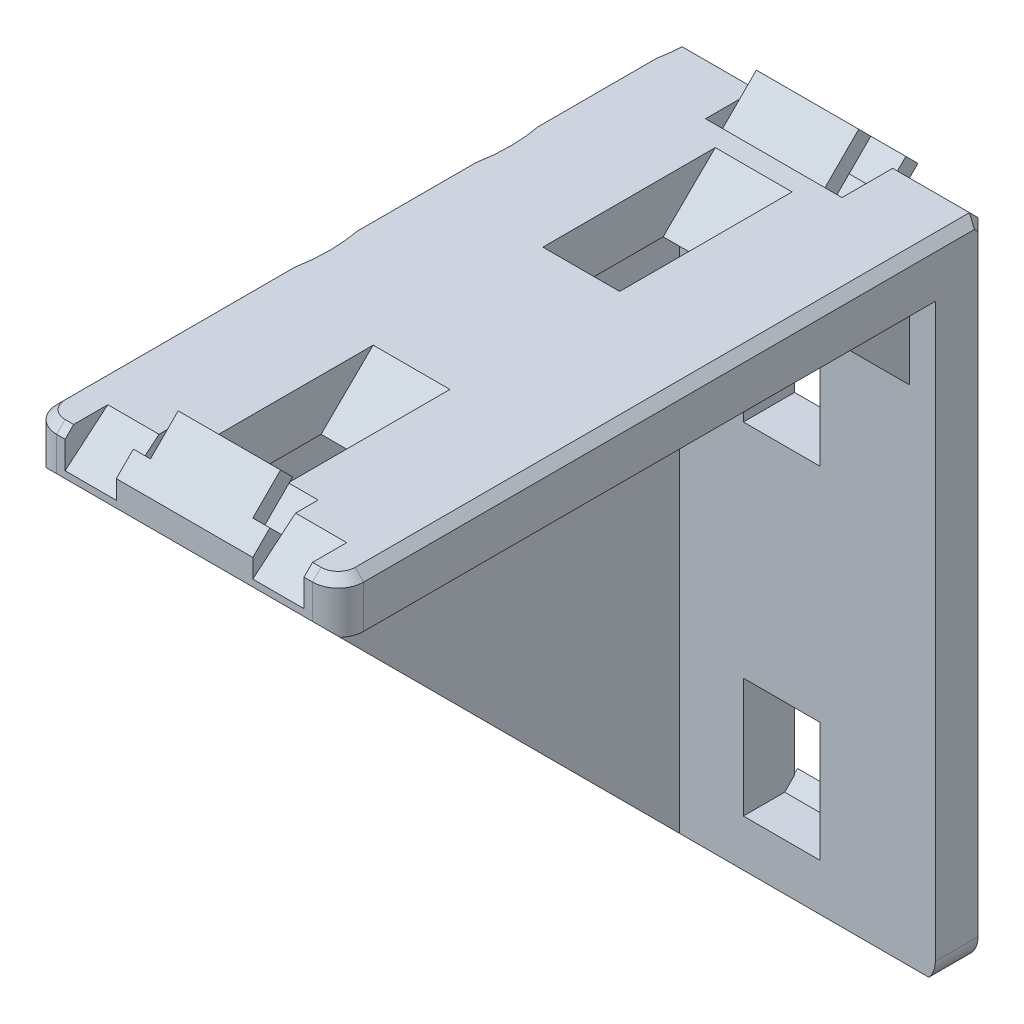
ISO-10303-21;
HEADER;
FILE_DESCRIPTION(('STEP AP214'),'2;1');
FILE_NAME('part.step','',(''),(''),'','','');
FILE_SCHEMA(('AUTOMOTIVE_DESIGN { 1 0 10303 214 1 1 1 1 }'));
ENDSEC;
DATA;
#1=APPLICATION_CONTEXT('core data for automotive mechanical design processes');
#2=APPLICATION_PROTOCOL_DEFINITION('international standard','automotive_design',2000,#1);
#3=PRODUCT_CONTEXT('',#1,'mechanical');
#4=PRODUCT('Part','Part','',(#3));
#5=PRODUCT_RELATED_PRODUCT_CATEGORY('part','',(#4));
#6=PRODUCT_DEFINITION_FORMATION('','',#4);
#7=PRODUCT_DEFINITION_CONTEXT('part definition',#1,'design');
#8=PRODUCT_DEFINITION('design','',#6,#7);
#9=PRODUCT_DEFINITION_SHAPE('','',#8);
#10=(LENGTH_UNIT() NAMED_UNIT(*) SI_UNIT(.MILLI.,.METRE.));
#11=(NAMED_UNIT(*) PLANE_ANGLE_UNIT() SI_UNIT($,.RADIAN.));
#12=(NAMED_UNIT(*) SI_UNIT($,.STERADIAN.) SOLID_ANGLE_UNIT());
#13=UNCERTAINTY_MEASURE_WITH_UNIT(LENGTH_MEASURE(1.E-05),#10,'distance_accuracy_value','');
#14=(GEOMETRIC_REPRESENTATION_CONTEXT(3) GLOBAL_UNCERTAINTY_ASSIGNED_CONTEXT((#13)) GLOBAL_UNIT_ASSIGNED_CONTEXT((#10,
#11,#12)) REPRESENTATION_CONTEXT('',''));
#15=CARTESIAN_POINT('',(0.,0.,0.));
#16=DIRECTION('',(0.,0.,1.));
#17=DIRECTION('',(1.,0.,0.));
#18=AXIS2_PLACEMENT_3D('',#15,#16,#17);
#19=CARTESIAN_POINT('',(-4.,-1.027817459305,1.027817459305));
#20=DIRECTION('',(0.,-0.707106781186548,0.707106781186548));
#21=DIRECTION('',(0.,-0.707106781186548,-0.707106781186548));
#22=AXIS2_PLACEMENT_3D('',#19,#20,#21);
#23=PLANE('',#22);
#24=DIRECTION('',(1.,0.,0.));
#25=VECTOR('',#24,1.);
#26=CARTESIAN_POINT('',(-4.,-0.6742640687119,1.38137084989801));
#27=LINE('',#26,#25);
#28=CARTESIAN_POINT('',(-4.,-0.674264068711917,1.38137084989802));
#29=VERTEX_POINT('',#28);
#30=CARTESIAN_POINT('',(4.,-0.674264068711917,1.38137084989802));
#31=VERTEX_POINT('',#30);
#32=EDGE_CURVE('E1022',#29,#31,#27,.T.);
#33=ORIENTED_EDGE('',*,*,#32,.T.);
#34=DIRECTION('',(0.,-0.707106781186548,-0.707106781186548));
#35=VECTOR('',#34,1.);
#36=CARTESIAN_POINT('',(4.,-1.027817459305,1.027817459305));
#37=LINE('',#36,#35);
#38=CARTESIAN_POINT('',(4.,-1.38137084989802,0.674264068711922));
#39=VERTEX_POINT('',#38);
#40=EDGE_CURVE('E1080',#39,#31,#37,.F.);
#41=ORIENTED_EDGE('',*,*,#40,.F.);
#42=DIRECTION('',(1.,0.,0.));
#43=VECTOR('',#42,1.);
#44=CARTESIAN_POINT('',(-4.,-1.381370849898,0.674264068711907));
#45=LINE('',#44,#43);
#46=CARTESIAN_POINT('',(-4.,-1.38137084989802,0.674264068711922));
#47=VERTEX_POINT('',#46);
#48=EDGE_CURVE('E1004',#47,#39,#45,.T.);
#49=ORIENTED_EDGE('',*,*,#48,.F.);
#50=DIRECTION('',(0.,-0.707106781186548,-0.707106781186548));
#51=VECTOR('',#50,1.);
#52=CARTESIAN_POINT('',(-4.,-1.027817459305,1.027817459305));
#53=LINE('',#52,#51);
#54=EDGE_CURVE('E1082',#29,#47,#53,.T.);
#55=ORIENTED_EDGE('',*,*,#54,.F.);
#56=EDGE_LOOP('',(#33,#41,#49,#55));
#57=FACE_BOUND('',#56,.T.);
#58=ADVANCED_FACE('F15',(#57),#23,.F.);
#59=CARTESIAN_POINT('',(-4.,-0.6742640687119,1.38137084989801));
#60=DIRECTION('',(0.,-0.707106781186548,-0.707106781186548));
#61=DIRECTION('',(0.,0.707106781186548,-0.707106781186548));
#62=AXIS2_PLACEMENT_3D('',#59,#60,#61);
#63=PLANE('',#62);
#64=DIRECTION('',(1.,0.,0.));
#65=VECTOR('',#64,1.);
#66=CARTESIAN_POINT('',(-4.,-1.381370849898,2.088477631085));
#67=LINE('',#66,#65);
#68=CARTESIAN_POINT('',(-4.,-1.38137084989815,2.08847763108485));
#69=VERTEX_POINT('',#68);
#70=CARTESIAN_POINT('',(4.,-1.38137084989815,2.08847763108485));
#71=VERTEX_POINT('',#70);
#72=EDGE_CURVE('E965',#69,#71,#67,.T.);
#73=ORIENTED_EDGE('',*,*,#72,.T.);
#74=DIRECTION('',(0.,0.707106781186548,-0.707106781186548));
#75=VECTOR('',#74,1.);
#76=CARTESIAN_POINT('',(4.,-0.674264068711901,1.38137084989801));
#77=LINE('',#76,#75);
#78=EDGE_CURVE('E1018',#31,#71,#77,.F.);
#79=ORIENTED_EDGE('',*,*,#78,.F.);
#80=ORIENTED_EDGE('',*,*,#32,.F.);
#81=DIRECTION('',(0.,0.707106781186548,-0.707106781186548));
#82=VECTOR('',#81,1.);
#83=CARTESIAN_POINT('',(-4.,-0.6742640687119,1.38137084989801));
#84=LINE('',#83,#82);
#85=EDGE_CURVE('E1009',#69,#29,#84,.T.);
#86=ORIENTED_EDGE('',*,*,#85,.F.);
#87=EDGE_LOOP('',(#73,#79,#80,#86));
#88=FACE_BOUND('',#87,.T.);
#89=ADVANCED_FACE('F2144',(#88),#63,.F.);
#90=CARTESIAN_POINT('',(3.,1.272792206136,0.782842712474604));
#91=DIRECTION('',(0.,-0.707106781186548,-0.707106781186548));
#92=DIRECTION('',(0.,0.707106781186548,-0.707106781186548));
#93=AXIS2_PLACEMENT_3D('',#90,#91,#92);
#94=PLANE('',#93);
#95=DIRECTION('',(1.,0.,0.));
#96=VECTOR('',#95,1.);
#97=CARTESIAN_POINT('',(3.,1.2727922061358,0.782842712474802));
#98=LINE('',#97,#96);
#99=CARTESIAN_POINT('',(3.,1.27279220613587,0.782842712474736));
#100=VERTEX_POINT('',#99);
#101=CARTESIAN_POINT('',(-3.,1.27279220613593,0.782842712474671));
#102=VERTEX_POINT('',#101);
#103=EDGE_CURVE('E1052',#100,#102,#98,.F.);
#104=ORIENTED_EDGE('',*,*,#103,.F.);
#105=DIRECTION('',(0.,-0.707106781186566,0.707106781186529));
#106=VECTOR('',#105,1.);
#107=CARTESIAN_POINT('',(3.,1.272792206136,0.782842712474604));
#108=LINE('',#107,#106);
#109=CARTESIAN_POINT('',(3.,-0.707106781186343,2.76274169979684));
#110=VERTEX_POINT('',#109);
#111=EDGE_CURVE('E1003',#100,#110,#108,.T.);
#112=ORIENTED_EDGE('',*,*,#111,.T.);
#113=DIRECTION('',(1.,0.,0.));
#114=VECTOR('',#113,1.);
#115=CARTESIAN_POINT('',(-4.,-0.70710678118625,2.76274169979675));
#116=LINE('',#115,#114);
#117=CARTESIAN_POINT('',(-3.,-0.707106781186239,2.76274169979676));
#118=VERTEX_POINT('',#117);
#119=EDGE_CURVE('E952',#110,#118,#116,.F.);
#120=ORIENTED_EDGE('',*,*,#119,.T.);
#121=DIRECTION('',(0.,-0.707106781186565,0.70710678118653));
#122=VECTOR('',#121,1.);
#123=CARTESIAN_POINT('',(-3.,1.272792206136,0.782842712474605));
#124=LINE('',#123,#122);
#125=EDGE_CURVE('E980',#102,#118,#124,.T.);
#126=ORIENTED_EDGE('',*,*,#125,.F.);
#127=EDGE_LOOP('',(#104,#112,#120,#126));
#128=FACE_BOUND('',#127,.T.);
#129=ADVANCED_FACE('F2141',(#128),#94,.T.);
#130=CARTESIAN_POINT('',(3.,-0.7828427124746,-1.272792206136));
#131=DIRECTION('',(0.,-0.707106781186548,-0.707106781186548));
#132=DIRECTION('',(0.,0.707106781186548,-0.707106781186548));
#133=AXIS2_PLACEMENT_3D('',#130,#131,#132);
#134=PLANE('',#133);
#135=DIRECTION('',(0.,-0.70710678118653,0.707106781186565));
#136=VECTOR('',#135,1.);
#137=CARTESIAN_POINT('',(3.,-0.7828427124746,-1.272792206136));
#138=LINE('',#137,#136);
#139=CARTESIAN_POINT('',(3.,-0.78284271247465,-1.27279220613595));
#140=VERTEX_POINT('',#139);
#141=CARTESIAN_POINT('',(3.,-2.76274169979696,0.707106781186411));
#142=VERTEX_POINT('',#141);
#143=EDGE_CURVE('E978',#140,#142,#138,.T.);
#144=ORIENTED_EDGE('',*,*,#143,.F.);
#145=DIRECTION('',(1.,0.,0.));
#146=VECTOR('',#145,1.);
#147=CARTESIAN_POINT('',(3.,-0.7828427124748,-1.2727922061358));
#148=LINE('',#147,#146);
#149=CARTESIAN_POINT('',(-3.,-0.7828427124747,-1.2727922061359));
#150=VERTEX_POINT('',#149);
#151=EDGE_CURVE('E976',#140,#150,#148,.F.);
#152=ORIENTED_EDGE('',*,*,#151,.T.);
#153=DIRECTION('',(0.,-0.70710678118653,0.707106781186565));
#154=VECTOR('',#153,1.);
#155=CARTESIAN_POINT('',(-3.,-0.7828427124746,-1.272792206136));
#156=LINE('',#155,#154);
#157=CARTESIAN_POINT('',(-3.,-2.76274169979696,0.707106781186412));
#158=VERTEX_POINT('',#157);
#159=EDGE_CURVE('E966',#150,#158,#156,.T.);
#160=ORIENTED_EDGE('',*,*,#159,.T.);
#161=DIRECTION('',(1.,0.,0.));
#162=VECTOR('',#161,1.);
#163=CARTESIAN_POINT('',(-4.,-2.76274169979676,0.707106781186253));
#164=LINE('',#163,#162);
#165=EDGE_CURVE('E950',#142,#158,#164,.F.);
#166=ORIENTED_EDGE('',*,*,#165,.F.);
#167=EDGE_LOOP('',(#144,#152,#160,#166));
#168=FACE_BOUND('',#167,.T.);
#169=ADVANCED_FACE('F2137',(#168),#134,.F.);
#170=CARTESIAN_POINT('',(-4.,-1.381370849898,0.674264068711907));
#171=DIRECTION('',(0.,-0.707106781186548,-0.707106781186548));
#172=DIRECTION('',(0.,0.707106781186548,-0.707106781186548));
#173=AXIS2_PLACEMENT_3D('',#170,#171,#172);
#174=PLANE('',#173);
#175=DIRECTION('',(0.,0.707106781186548,-0.707106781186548));
#176=VECTOR('',#175,1.);
#177=CARTESIAN_POINT('',(4.,-1.381370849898,0.674264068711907));
#178=LINE('',#177,#176);
#179=CARTESIAN_POINT('',(4.,-2.08847763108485,1.38137084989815));
#180=VERTEX_POINT('',#179);
#181=EDGE_CURVE('E1001',#39,#180,#178,.F.);
#182=ORIENTED_EDGE('',*,*,#181,.T.);
#183=DIRECTION('',(1.,0.,0.));
#184=VECTOR('',#183,1.);
#185=CARTESIAN_POINT('',(-4.,-2.088477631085,1.38137084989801));
#186=LINE('',#185,#184);
#187=CARTESIAN_POINT('',(-4.,-2.08847763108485,1.38137084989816));
#188=VERTEX_POINT('',#187);
#189=EDGE_CURVE('E947',#188,#180,#186,.T.);
#190=ORIENTED_EDGE('',*,*,#189,.F.);
#191=DIRECTION('',(0.,0.707106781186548,-0.707106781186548));
#192=VECTOR('',#191,1.);
#193=CARTESIAN_POINT('',(-4.,-1.381370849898,0.674264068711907));
#194=LINE('',#193,#192);
#195=EDGE_CURVE('E1007',#188,#47,#194,.T.);
#196=ORIENTED_EDGE('',*,*,#195,.T.);
#197=ORIENTED_EDGE('',*,*,#48,.T.);
#198=EDGE_LOOP('',(#182,#190,#196,#197));
#199=FACE_BOUND('',#198,.T.);
#200=ADVANCED_FACE('F2133',(#199),#174,.T.);
#201=CARTESIAN_POINT('',(3.,0.,0.));
#202=DIRECTION('',(-1.,0.,0.));
#203=DIRECTION('',(0.,0.,1.));
#204=AXIS2_PLACEMENT_3D('',#201,#202,#203);
#205=PLANE('',#204);
#206=ORIENTED_EDGE('',*,*,#111,.F.);
#207=DIRECTION('',(0.,0.707106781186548,0.707106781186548));
#208=VECTOR('',#207,1.);
#209=CARTESIAN_POINT('',(3.,1.979898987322,1.489949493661));
#210=LINE('',#209,#208);
#211=CARTESIAN_POINT('',(3.,1.979898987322,1.489949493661));
#212=VERTEX_POINT('',#211);
#213=EDGE_CURVE('E1056',#212,#100,#210,.F.);
#214=ORIENTED_EDGE('',*,*,#213,.F.);
#215=DIRECTION('',(0.,-0.707106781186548,0.707106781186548));
#216=VECTOR('',#215,1.);
#217=CARTESIAN_POINT('',(3.,0.,3.469848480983));
#218=LINE('',#217,#216);
#219=CARTESIAN_POINT('',(3.,0.,3.469848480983));
#220=VERTEX_POINT('',#219);
#221=EDGE_CURVE('E897',#220,#212,#218,.F.);
#222=ORIENTED_EDGE('',*,*,#221,.F.);
#223=DIRECTION('',(0.,-0.707106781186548,-0.707106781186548));
#224=VECTOR('',#223,1.);
#225=CARTESIAN_POINT('',(3.,-1.381370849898,2.088477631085));
#226=LINE('',#225,#224);
#227=EDGE_CURVE('E964',#220,#110,#226,.T.);
#228=ORIENTED_EDGE('',*,*,#227,.T.);
#229=EDGE_LOOP('',(#206,#214,#222,#228));
#230=FACE_BOUND('',#229,.T.);
#231=ADVANCED_FACE('F2129',(#230),#205,.F.);
#232=CARTESIAN_POINT('',(3.,1.979898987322,1.489949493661));
#233=DIRECTION('',(0.,0.707106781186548,-0.707106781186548));
#234=DIRECTION('',(0.,0.707106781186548,0.707106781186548));
#235=AXIS2_PLACEMENT_3D('',#232,#233,#234);
#236=PLANE('',#235);
#237=DIRECTION('',(0.,-0.70710678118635,-0.707106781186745));
#238=VECTOR('',#237,1.);
#239=CARTESIAN_POINT('',(-3.,1.979898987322,1.489949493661));
#240=LINE('',#239,#238);
#241=CARTESIAN_POINT('',(-3.,1.979898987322,1.489949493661));
#242=VERTEX_POINT('',#241);
#243=EDGE_CURVE('E1043',#242,#102,#240,.T.);
#244=ORIENTED_EDGE('',*,*,#243,.F.);
#245=DIRECTION('',(1.,0.,0.));
#246=VECTOR('',#245,1.);
#247=CARTESIAN_POINT('',(3.,1.979898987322,1.489949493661));
#248=LINE('',#247,#246);
#249=EDGE_CURVE('E1035',#212,#242,#248,.F.);
#250=ORIENTED_EDGE('',*,*,#249,.F.);
#251=ORIENTED_EDGE('',*,*,#213,.T.);
#252=ORIENTED_EDGE('',*,*,#103,.T.);
#253=EDGE_LOOP('',(#244,#250,#251,#252));
#254=FACE_BOUND('',#253,.T.);
#255=ADVANCED_FACE('F2125',(#254),#236,.T.);
#256=CARTESIAN_POINT('',(-3.,0.,0.));
#257=DIRECTION('',(-1.,0.,0.));
#258=DIRECTION('',(0.,0.,1.));
#259=AXIS2_PLACEMENT_3D('',#256,#257,#258);
#260=PLANE('',#259);
#261=ORIENTED_EDGE('',*,*,#243,.T.);
#262=ORIENTED_EDGE('',*,*,#125,.T.);
#263=DIRECTION('',(0.,-0.707106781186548,-0.707106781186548));
#264=VECTOR('',#263,1.);
#265=CARTESIAN_POINT('',(-3.,-1.381370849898,2.088477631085));
#266=LINE('',#265,#264);
#267=CARTESIAN_POINT('',(-3.,0.,3.469848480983));
#268=VERTEX_POINT('',#267);
#269=EDGE_CURVE('E969',#118,#268,#266,.F.);
#270=ORIENTED_EDGE('',*,*,#269,.T.);
#271=DIRECTION('',(0.,-0.707106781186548,0.707106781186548));
#272=VECTOR('',#271,1.);
#273=CARTESIAN_POINT('',(-3.,0.,3.469848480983));
#274=LINE('',#273,#272);
#275=EDGE_CURVE('E824',#242,#268,#274,.T.);
#276=ORIENTED_EDGE('',*,*,#275,.F.);
#277=EDGE_LOOP('',(#261,#262,#270,#276));
#278=FACE_BOUND('',#277,.T.);
#279=ADVANCED_FACE('F2121',(#278),#260,.T.);
#280=CARTESIAN_POINT('',(3.,0.,0.));
#281=DIRECTION('',(1.,0.,0.));
#282=DIRECTION('',(0.,0.,-1.));
#283=AXIS2_PLACEMENT_3D('',#280,#281,#282);
#284=PLANE('',#283);
#285=DIRECTION('',(0.,-0.707106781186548,-0.707106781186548));
#286=VECTOR('',#285,1.);
#287=CARTESIAN_POINT('',(3.,-1.489949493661,-1.979898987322));
#288=LINE('',#287,#286);
#289=CARTESIAN_POINT('',(3.,-1.489949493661,-1.979898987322));
#290=VERTEX_POINT('',#289);
#291=EDGE_CURVE('E973',#290,#140,#288,.F.);
#292=ORIENTED_EDGE('',*,*,#291,.T.);
#293=ORIENTED_EDGE('',*,*,#143,.T.);
#294=DIRECTION('',(0.,0.707106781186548,0.707106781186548));
#295=VECTOR('',#294,1.);
#296=CARTESIAN_POINT('',(3.,-2.088477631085,1.38137084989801));
#297=LINE('',#296,#295);
#298=CARTESIAN_POINT('',(3.00000000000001,-3.469848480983,0.));
#299=VERTEX_POINT('',#298);
#300=EDGE_CURVE('E916',#299,#142,#297,.T.);
#301=ORIENTED_EDGE('',*,*,#300,.F.);
#302=DIRECTION('',(0.,-0.707106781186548,0.707106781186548));
#303=VECTOR('',#302,1.);
#304=CARTESIAN_POINT('',(3.,-3.469848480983,0.));
#305=LINE('',#304,#303);
#306=EDGE_CURVE('E794',#299,#290,#305,.F.);
#307=ORIENTED_EDGE('',*,*,#306,.T.);
#308=EDGE_LOOP('',(#292,#293,#301,#307));
#309=FACE_BOUND('',#308,.T.);
#310=ADVANCED_FACE('F2117',(#309),#284,.T.);
#311=CARTESIAN_POINT('',(3.,-1.489949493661,-1.979898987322));
#312=DIRECTION('',(0.,-0.707106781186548,0.707106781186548));
#313=DIRECTION('',(0.,-0.707106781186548,-0.707106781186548));
#314=AXIS2_PLACEMENT_3D('',#311,#312,#313);
#315=PLANE('',#314);
#316=DIRECTION('',(1.,0.,0.));
#317=VECTOR('',#316,1.);
#318=CARTESIAN_POINT('',(3.,-1.489949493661,-1.979898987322));
#319=LINE('',#318,#317);
#320=CARTESIAN_POINT('',(-3.,-1.489949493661,-1.979898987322));
#321=VERTEX_POINT('',#320);
#322=EDGE_CURVE('E791',#290,#321,#319,.F.);
#323=ORIENTED_EDGE('',*,*,#322,.T.);
#324=DIRECTION('',(0.,0.707106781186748,0.707106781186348));
#325=VECTOR('',#324,1.);
#326=CARTESIAN_POINT('',(-3.,-1.489949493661,-1.979898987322));
#327=LINE('',#326,#325);
#328=EDGE_CURVE('E970',#321,#150,#327,.T.);
#329=ORIENTED_EDGE('',*,*,#328,.T.);
#330=ORIENTED_EDGE('',*,*,#151,.F.);
#331=ORIENTED_EDGE('',*,*,#291,.F.);
#332=EDGE_LOOP('',(#323,#329,#330,#331));
#333=FACE_BOUND('',#332,.T.);
#334=ADVANCED_FACE('F2113',(#333),#315,.F.);
#335=CARTESIAN_POINT('',(-3.,0.,0.));
#336=DIRECTION('',(1.,0.,0.));
#337=DIRECTION('',(0.,0.,-1.));
#338=AXIS2_PLACEMENT_3D('',#335,#336,#337);
#339=PLANE('',#338);
#340=ORIENTED_EDGE('',*,*,#159,.F.);
#341=ORIENTED_EDGE('',*,*,#328,.F.);
#342=DIRECTION('',(0.,-0.707106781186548,0.707106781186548));
#343=VECTOR('',#342,1.);
#344=CARTESIAN_POINT('',(-3.,-3.469848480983,0.));
#345=LINE('',#344,#343);
#346=CARTESIAN_POINT('',(-3.,-3.469848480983,0.));
#347=VERTEX_POINT('',#346);
#348=EDGE_CURVE('E788',#321,#347,#345,.T.);
#349=ORIENTED_EDGE('',*,*,#348,.T.);
#350=DIRECTION('',(0.,0.707106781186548,0.707106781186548));
#351=VECTOR('',#350,1.);
#352=CARTESIAN_POINT('',(-3.,-2.088477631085,1.38137084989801));
#353=LINE('',#352,#351);
#354=EDGE_CURVE('E948',#158,#347,#353,.F.);
#355=ORIENTED_EDGE('',*,*,#354,.F.);
#356=EDGE_LOOP('',(#340,#341,#349,#355));
#357=FACE_BOUND('',#356,.T.);
#358=ADVANCED_FACE('F2109',(#357),#339,.F.);
#359=CARTESIAN_POINT('',(-4.,-1.381370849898,2.088477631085));
#360=DIRECTION('',(0.,-0.707106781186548,0.707106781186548));
#361=DIRECTION('',(0.,-0.707106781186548,-0.707106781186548));
#362=AXIS2_PLACEMENT_3D('',#359,#360,#361);
#363=PLANE('',#362);
#364=ORIENTED_EDGE('',*,*,#227,.F.);
#365=DIRECTION('',(1.,0.,0.));
#366=VECTOR('',#365,1.);
#367=CARTESIAN_POINT('',(-4.,0.,3.469848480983));
#368=LINE('',#367,#366);
#369=CARTESIAN_POINT('',(4.,0.,3.469848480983));
#370=VERTEX_POINT('',#369);
#371=EDGE_CURVE('E961',#370,#220,#368,.F.);
#372=ORIENTED_EDGE('',*,*,#371,.F.);
#373=DIRECTION('',(0.,0.707106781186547,0.707106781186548));
#374=VECTOR('',#373,1.);
#375=CARTESIAN_POINT('',(4.,-1.381370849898,2.088477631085));
#376=LINE('',#375,#374);
#377=EDGE_CURVE('E785',#71,#370,#376,.T.);
#378=ORIENTED_EDGE('',*,*,#377,.F.);
#379=ORIENTED_EDGE('',*,*,#72,.F.);
#380=DIRECTION('',(0.,0.707106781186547,0.707106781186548));
#381=VECTOR('',#380,1.);
#382=CARTESIAN_POINT('',(-4.,-1.381370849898,2.088477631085));
#383=LINE('',#382,#381);
#384=CARTESIAN_POINT('',(-4.,0.,3.469848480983));
#385=VERTEX_POINT('',#384);
#386=EDGE_CURVE('E797',#69,#385,#383,.T.);
#387=ORIENTED_EDGE('',*,*,#386,.T.);
#388=DIRECTION('',(1.,0.,0.));
#389=VECTOR('',#388,1.);
#390=CARTESIAN_POINT('',(-4.,0.,3.469848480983));
#391=LINE('',#390,#389);
#392=EDGE_CURVE('E981',#268,#385,#391,.F.);
#393=ORIENTED_EDGE('',*,*,#392,.F.);
#394=ORIENTED_EDGE('',*,*,#269,.F.);
#395=ORIENTED_EDGE('',*,*,#119,.F.);
#396=EDGE_LOOP('',(#364,#372,#378,#379,#387,#393,#394,#395));
#397=FACE_BOUND('',#396,.T.);
#398=ADVANCED_FACE('F2105',(#397),#363,.F.);
#399=CARTESIAN_POINT('',(-4.,-2.088477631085,1.38137084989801));
#400=DIRECTION('',(0.,0.707106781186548,-0.707106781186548));
#401=DIRECTION('',(0.,0.707106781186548,0.707106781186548));
#402=AXIS2_PLACEMENT_3D('',#399,#400,#401);
#403=PLANE('',#402);
#404=DIRECTION('',(1.,0.,0.));
#405=VECTOR('',#404,1.);
#406=CARTESIAN_POINT('',(-4.,-3.46984848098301,0.));
#407=LINE('',#406,#405);
#408=CARTESIAN_POINT('',(4.,-3.469848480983,0.));
#409=VERTEX_POINT('',#408);
#410=EDGE_CURVE('E953',#409,#299,#407,.F.);
#411=ORIENTED_EDGE('',*,*,#410,.T.);
#412=ORIENTED_EDGE('',*,*,#300,.T.);
#413=ORIENTED_EDGE('',*,*,#165,.T.);
#414=ORIENTED_EDGE('',*,*,#354,.T.);
#415=DIRECTION('',(1.,0.,0.));
#416=VECTOR('',#415,1.);
#417=CARTESIAN_POINT('',(-4.,-3.46984848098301,0.));
#418=LINE('',#417,#416);
#419=CARTESIAN_POINT('',(-4.,-3.469848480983,0.));
#420=VERTEX_POINT('',#419);
#421=EDGE_CURVE('E945',#347,#420,#418,.F.);
#422=ORIENTED_EDGE('',*,*,#421,.T.);
#423=DIRECTION('',(0.,0.707106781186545,0.70710678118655));
#424=VECTOR('',#423,1.);
#425=CARTESIAN_POINT('',(-4.,-3.469848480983,0.));
#426=LINE('',#425,#424);
#427=EDGE_CURVE('E583',#420,#188,#426,.T.);
#428=ORIENTED_EDGE('',*,*,#427,.T.);
#429=ORIENTED_EDGE('',*,*,#189,.T.);
#430=DIRECTION('',(0.,0.707106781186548,0.707106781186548));
#431=VECTOR('',#430,1.);
#432=CARTESIAN_POINT('',(4.,-3.469848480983,0.));
#433=LINE('',#432,#431);
#434=EDGE_CURVE('E776',#409,#180,#433,.T.);
#435=ORIENTED_EDGE('',*,*,#434,.F.);
#436=EDGE_LOOP('',(#411,#412,#413,#414,#422,#428,#429,#435));
#437=FACE_BOUND('',#436,.T.);
#438=ADVANCED_FACE('F2098',(#437),#403,.T.);
#439=CARTESIAN_POINT('',(3.,-34.66654762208,-0.919238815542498));
#440=DIRECTION('',(0.,-0.707106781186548,-0.707106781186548));
#441=DIRECTION('',(0.,0.707106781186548,-0.707106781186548));
#442=AXIS2_PLACEMENT_3D('',#439,#440,#441);
#443=PLANE('',#442);
#444=DIRECTION('',(0.,-0.707106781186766,0.707106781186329));
#445=VECTOR('',#444,1.);
#446=CARTESIAN_POINT('',(3.,-34.66654762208,-0.919238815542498));
#447=LINE('',#446,#445);
#448=CARTESIAN_POINT('',(3.,-34.6665476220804,-0.919238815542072));
#449=VERTEX_POINT('',#448);
#450=CARTESIAN_POINT('',(3.,-36.2928932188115,0.707106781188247));
#451=VERTEX_POINT('',#450);
#452=EDGE_CURVE('E716',#449,#451,#447,.T.);
#453=ORIENTED_EDGE('',*,*,#452,.F.);
#454=DIRECTION('',(1.,0.,0.));
#455=VECTOR('',#454,1.);
#456=CARTESIAN_POINT('',(3.,-34.6665476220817,-0.919238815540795));
#457=LINE('',#456,#455);
#458=CARTESIAN_POINT('',(-3.,-34.6665476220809,-0.919238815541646));
#459=VERTEX_POINT('',#458);
#460=EDGE_CURVE('E714',#449,#459,#457,.F.);
#461=ORIENTED_EDGE('',*,*,#460,.T.);
#462=DIRECTION('',(0.,-0.707106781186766,0.707106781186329));
#463=VECTOR('',#462,1.);
#464=CARTESIAN_POINT('',(-3.,-34.66654762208,-0.919238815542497));
#465=LINE('',#464,#463);
#466=CARTESIAN_POINT('',(-3.,-36.2928932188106,0.707106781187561));
#467=VERTEX_POINT('',#466);
#468=EDGE_CURVE('E705',#459,#467,#465,.T.);
#469=ORIENTED_EDGE('',*,*,#468,.T.);
#470=DIRECTION('',(1.,0.,0.));
#471=VECTOR('',#470,1.);
#472=CARTESIAN_POINT('',(-4.,-36.2928932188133,0.707106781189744));
#473=LINE('',#472,#471);
#474=EDGE_CURVE('E817',#451,#467,#473,.F.);
#475=ORIENTED_EDGE('',*,*,#474,.F.);
#476=EDGE_LOOP('',(#453,#461,#469,#475));
#477=FACE_BOUND('',#476,.T.);
#478=ADVANCED_FACE('F2091',(#477),#443,.F.);
#479=CARTESIAN_POINT('',(3.00000000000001,0.9192388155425,34.66654762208));
#480=DIRECTION('',(0.,-0.707106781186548,-0.707106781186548));
#481=DIRECTION('',(0.,0.707106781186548,-0.707106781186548));
#482=AXIS2_PLACEMENT_3D('',#479,#480,#481);
#483=PLANE('',#482);
#484=DIRECTION('',(1.,0.,0.));
#485=VECTOR('',#484,1.);
#486=CARTESIAN_POINT('',(3.00000000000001,0.9192388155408,34.6665476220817));
#487=LINE('',#486,#485);
#488=CARTESIAN_POINT('',(3.00000000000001,0.919238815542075,34.6665476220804));
#489=VERTEX_POINT('',#488);
#490=CARTESIAN_POINT('',(-3.,0.91923881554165,34.6665476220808));
#491=VERTEX_POINT('',#490);
#492=EDGE_CURVE('E1347',#489,#491,#487,.F.);
#493=ORIENTED_EDGE('',*,*,#492,.F.);
#494=DIRECTION('',(0.,-0.70710678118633,0.707106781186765));
#495=VECTOR('',#494,1.);
#496=CARTESIAN_POINT('',(3.,0.9192388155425,34.66654762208));
#497=LINE('',#496,#495);
#498=CARTESIAN_POINT('',(3.00000000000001,-0.707106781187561,36.2928932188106));
#499=VERTEX_POINT('',#498);
#500=EDGE_CURVE('E1355',#489,#499,#497,.T.);
#501=ORIENTED_EDGE('',*,*,#500,.T.);
#502=DIRECTION('',(1.,0.,0.));
#503=VECTOR('',#502,1.);
#504=CARTESIAN_POINT('',(-4.,-0.707106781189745,36.2928932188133));
#505=LINE('',#504,#503);
#506=CARTESIAN_POINT('',(-3.,-0.707106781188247,36.2928932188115));
#507=VERTEX_POINT('',#506);
#508=EDGE_CURVE('E903',#499,#507,#505,.F.);
#509=ORIENTED_EDGE('',*,*,#508,.T.);
#510=DIRECTION('',(0.,-0.70710678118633,0.707106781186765));
#511=VECTOR('',#510,1.);
#512=CARTESIAN_POINT('',(-3.,0.9192388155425,34.66654762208));
#513=LINE('',#512,#511);
#514=EDGE_CURVE('E1338',#491,#507,#513,.T.);
#515=ORIENTED_EDGE('',*,*,#514,.F.);
#516=EDGE_LOOP('',(#493,#501,#509,#515));
#517=FACE_BOUND('',#516,.T.);
#518=ADVANCED_FACE('F2089',(#517),#483,.T.);
#519=CARTESIAN_POINT('',(4.,0.,0.));
#520=DIRECTION('',(-1.,0.,0.));
#521=DIRECTION('',(0.,0.,1.));
#522=AXIS2_PLACEMENT_3D('',#519,#520,#521);
#523=PLANE('',#522);
#524=DIRECTION('',(0.,-0.707106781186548,-0.707106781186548));
#525=VECTOR('',#524,1.);
#526=CARTESIAN_POINT('',(4.00000000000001,-1.414213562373,35.58578643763));
#527=LINE('',#526,#525);
#528=CARTESIAN_POINT('',(4.00000000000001,-1.41421356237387,35.5857864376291));
#529=VERTEX_POINT('',#528);
#530=CARTESIAN_POINT('',(4.00000000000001,-0.685607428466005,36.3143925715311));
#531=VERTEX_POINT('',#530);
#532=EDGE_CURVE('E907',#529,#531,#527,.F.);
#533=ORIENTED_EDGE('',*,*,#532,.T.);
#534=DIRECTION('',(0.,0.642787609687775,-0.766044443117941));
#535=VECTOR('',#534,1.);
#536=CARTESIAN_POINT('',(4.,-0.6856074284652,36.31439257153));
#537=LINE('',#536,#535);
#538=CARTESIAN_POINT('',(4.00000000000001,0.,35.49731745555));
#539=VERTEX_POINT('',#538);
#540=EDGE_CURVE('E912',#531,#539,#537,.T.);
#541=ORIENTED_EDGE('',*,*,#540,.T.);
#542=DIRECTION('',(0.,0.,1.));
#543=VECTOR('',#542,1.);
#544=CARTESIAN_POINT('',(4.,0.,0.));
#545=LINE('',#544,#543);
#546=CARTESIAN_POINT('',(4.00000000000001,0.,34.17157287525));
#547=VERTEX_POINT('',#546);
#548=EDGE_CURVE('E914',#539,#547,#545,.F.);
#549=ORIENTED_EDGE('',*,*,#548,.T.);
#550=DIRECTION('',(0.,0.707106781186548,-0.707106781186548));
#551=VECTOR('',#550,1.);
#552=CARTESIAN_POINT('',(4.00000000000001,0.,34.17157287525));
#553=LINE('',#552,#551);
#554=EDGE_CURVE('E919',#547,#529,#553,.F.);
#555=ORIENTED_EDGE('',*,*,#554,.T.);
#556=EDGE_LOOP('',(#533,#541,#549,#555));
#557=FACE_BOUND('',#556,.T.);
#558=ADVANCED_FACE('F2066',(#557),#523,.T.);
#559=CARTESIAN_POINT('',(-4.,-1.414213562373,35.58578643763));
#560=DIRECTION('',(0.,-0.707106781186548,0.707106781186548));
#561=DIRECTION('',(0.,-0.707106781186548,-0.707106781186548));
#562=AXIS2_PLACEMENT_3D('',#559,#560,#561);
#563=PLANE('',#562);
#564=DIRECTION('',(0.,0.707106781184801,0.707106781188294));
#565=VECTOR('',#564,1.);
#566=CARTESIAN_POINT('',(3.,-0.7071067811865,36.29289321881));
#567=LINE('',#566,#565);
#568=CARTESIAN_POINT('',(3.00000000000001,-7.49083895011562E-13,37.0000000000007));
#569=VERTEX_POINT('',#568);
#570=EDGE_CURVE('E1352',#499,#569,#567,.T.);
#571=ORIENTED_EDGE('',*,*,#570,.T.);
#572=DIRECTION('',(1.,0.,0.));
#573=VECTOR('',#572,1.);
#574=CARTESIAN_POINT('',(-4.,-1.49858424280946E-12,37.0000000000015));
#575=LINE('',#574,#573);
#576=CARTESIAN_POINT('',(4.00000000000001,-3.74598380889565E-13,37.0000000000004));
#577=VERTEX_POINT('',#576);
#578=EDGE_CURVE('E905',#577,#569,#575,.F.);
#579=ORIENTED_EDGE('',*,*,#578,.F.);
#580=DIRECTION('',(0.,-0.707106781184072,-0.707106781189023));
#581=VECTOR('',#580,1.);
#582=CARTESIAN_POINT('',(4.,0.,37.));
#583=LINE('',#582,#581);
#584=EDGE_CURVE('E1361',#577,#531,#583,.T.);
#585=ORIENTED_EDGE('',*,*,#584,.T.);
#586=ORIENTED_EDGE('',*,*,#532,.F.);
#587=DIRECTION('',(1.,0.,0.));
#588=VECTOR('',#587,1.);
#589=CARTESIAN_POINT('',(-4.,-1.4142135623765,35.5857864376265));
#590=LINE('',#589,#588);
#591=CARTESIAN_POINT('',(-4.,-1.41421356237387,35.5857864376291));
#592=VERTEX_POINT('',#591);
#593=EDGE_CURVE('E1321',#529,#592,#590,.F.);
#594=ORIENTED_EDGE('',*,*,#593,.T.);
#595=DIRECTION('',(0.,0.707106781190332,0.707106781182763));
#596=VECTOR('',#595,1.);
#597=CARTESIAN_POINT('',(-4.,-1.414213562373,35.58578643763));
#598=LINE('',#597,#596);
#599=CARTESIAN_POINT('',(-4.,-0.685607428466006,36.3143925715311));
#600=VERTEX_POINT('',#599);
#601=EDGE_CURVE('E898',#592,#600,#598,.T.);
#602=ORIENTED_EDGE('',*,*,#601,.T.);
#603=DIRECTION('',(0.,-0.707106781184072,-0.707106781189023));
#604=VECTOR('',#603,1.);
#605=CARTESIAN_POINT('',(-4.,0.,37.));
#606=LINE('',#605,#604);
#607=CARTESIAN_POINT('',(-4.,-7.49244891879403E-13,37.0000000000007));
#608=VERTEX_POINT('',#607);
#609=EDGE_CURVE('E1335',#608,#600,#606,.T.);
#610=ORIENTED_EDGE('',*,*,#609,.F.);
#611=DIRECTION('',(1.,0.,0.));
#612=VECTOR('',#611,1.);
#613=CARTESIAN_POINT('',(-4.,-1.49880108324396E-12,37.0000000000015));
#614=LINE('',#613,#612);
#615=CARTESIAN_POINT('',(-3.,-7.49380194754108E-13,37.0000000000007));
#616=VERTEX_POINT('',#615);
#617=EDGE_CURVE('E910',#616,#608,#614,.F.);
#618=ORIENTED_EDGE('',*,*,#617,.F.);
#619=DIRECTION('',(0.,0.707106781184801,0.707106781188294));
#620=VECTOR('',#619,1.);
#621=CARTESIAN_POINT('',(-3.,-0.7071067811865,36.29289321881));
#622=LINE('',#621,#620);
#623=EDGE_CURVE('E1344',#507,#616,#622,.T.);
#624=ORIENTED_EDGE('',*,*,#623,.F.);
#625=ORIENTED_EDGE('',*,*,#508,.F.);
#626=EDGE_LOOP('',(#571,#579,#585,#586,#594,#602,#610,#618,#624,#625));
#627=FACE_BOUND('',#626,.T.);
#628=ADVANCED_FACE('F2074',(#627),#563,.F.);
#629=CARTESIAN_POINT('',(-4.,0.,0.));
#630=DIRECTION('',(-1.,0.,0.));
#631=DIRECTION('',(0.,0.,1.));
#632=AXIS2_PLACEMENT_3D('',#629,#630,#631);
#633=PLANE('',#632);
#634=ORIENTED_EDGE('',*,*,#601,.F.);
#635=DIRECTION('',(0.,0.707106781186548,-0.707106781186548));
#636=VECTOR('',#635,1.);
#637=CARTESIAN_POINT('',(-4.,0.,34.17157287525));
#638=LINE('',#637,#636);
#639=CARTESIAN_POINT('',(-4.,0.,34.17157287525));
#640=VERTEX_POINT('',#639);
#641=EDGE_CURVE('E1318',#592,#640,#638,.T.);
#642=ORIENTED_EDGE('',*,*,#641,.T.);
#643=DIRECTION('',(0.,0.,1.));
#644=VECTOR('',#643,1.);
#645=CARTESIAN_POINT('',(-4.,0.,0.));
#646=LINE('',#645,#644);
#647=CARTESIAN_POINT('',(-4.,0.,35.49731745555));
#648=VERTEX_POINT('',#647);
#649=EDGE_CURVE('E901',#648,#640,#646,.F.);
#650=ORIENTED_EDGE('',*,*,#649,.F.);
#651=DIRECTION('',(0.,0.642787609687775,-0.766044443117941));
#652=VECTOR('',#651,1.);
#653=CARTESIAN_POINT('',(-4.,-0.6856074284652,36.31439257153));
#654=LINE('',#653,#652);
#655=EDGE_CURVE('E894',#600,#648,#654,.T.);
#656=ORIENTED_EDGE('',*,*,#655,.F.);
#657=EDGE_LOOP('',(#634,#642,#650,#656));
#658=FACE_BOUND('',#657,.T.);
#659=ADVANCED_FACE('F2009',(#658),#633,.F.);
#660=CARTESIAN_POINT('',(3.,0.,3.469848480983));
#661=DIRECTION('',(0.,0.707106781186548,0.707106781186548));
#662=DIRECTION('',(0.,-0.707106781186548,0.707106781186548));
#663=AXIS2_PLACEMENT_3D('',#660,#661,#662);
#664=PLANE('',#663);
#665=ORIENTED_EDGE('',*,*,#249,.T.);
#666=ORIENTED_EDGE('',*,*,#275,.T.);
#667=DIRECTION('',(1.,0.,0.));
#668=VECTOR('',#667,1.);
#669=CARTESIAN_POINT('',(0.,0.,3.469848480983));
#670=LINE('',#669,#668);
#671=EDGE_CURVE('E855',#220,#268,#670,.F.);
#672=ORIENTED_EDGE('',*,*,#671,.F.);
#673=ORIENTED_EDGE('',*,*,#221,.T.);
#674=EDGE_LOOP('',(#665,#666,#672,#673));
#675=FACE_BOUND('',#674,.T.);
#676=ADVANCED_FACE('F2190',(#675),#664,.T.);
#677=CARTESIAN_POINT('',(4.,0.,0.));
#678=DIRECTION('',(1.,0.,0.));
#679=DIRECTION('',(0.,0.,-1.));
#680=AXIS2_PLACEMENT_3D('',#677,#678,#679);
#681=PLANE('',#680);
#682=DIRECTION('',(0.,0.707106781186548,0.707106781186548));
#683=VECTOR('',#682,1.);
#684=CARTESIAN_POINT('',(4.,-35.58578643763,1.414213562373));
#685=LINE('',#684,#683);
#686=CARTESIAN_POINT('',(4.,-35.5857864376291,1.41421356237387));
#687=VERTEX_POINT('',#686);
#688=CARTESIAN_POINT('',(4.,-36.3143925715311,0.685607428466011));
#689=VERTEX_POINT('',#688);
#690=EDGE_CURVE('E812',#687,#689,#685,.F.);
#691=ORIENTED_EDGE('',*,*,#690,.F.);
#692=DIRECTION('',(0.,0.707106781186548,-0.707106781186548));
#693=VECTOR('',#692,1.);
#694=CARTESIAN_POINT('',(4.,-34.17157287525,0.));
#695=LINE('',#694,#693);
#696=CARTESIAN_POINT('',(4.,-34.17157287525,0.));
#697=VERTEX_POINT('',#696);
#698=EDGE_CURVE('E1291',#697,#687,#695,.F.);
#699=ORIENTED_EDGE('',*,*,#698,.F.);
#700=DIRECTION('',(0.,1.,0.));
#701=VECTOR('',#700,1.);
#702=CARTESIAN_POINT('',(4.,0.,0.));
#703=LINE('',#702,#701);
#704=CARTESIAN_POINT('',(4.,-35.49731745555,0.));
#705=VERTEX_POINT('',#704);
#706=EDGE_CURVE('E822',#705,#697,#703,.T.);
#707=ORIENTED_EDGE('',*,*,#706,.F.);
#708=DIRECTION('',(0.,0.766044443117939,-0.642787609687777));
#709=VECTOR('',#708,1.);
#710=CARTESIAN_POINT('',(4.,-36.31439257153,0.685607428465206));
#711=LINE('',#710,#709);
#712=EDGE_CURVE('E819',#689,#705,#711,.T.);
#713=ORIENTED_EDGE('',*,*,#712,.F.);
#714=EDGE_LOOP('',(#691,#699,#707,#713));
#715=FACE_BOUND('',#714,.T.);
#716=ADVANCED_FACE('F2197',(#715),#681,.F.);
#717=CARTESIAN_POINT('',(-4.,-35.58578643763,1.414213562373));
#718=DIRECTION('',(0.,0.707106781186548,-0.707106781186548));
#719=DIRECTION('',(0.,0.707106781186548,0.707106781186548));
#720=AXIS2_PLACEMENT_3D('',#717,#718,#719);
#721=PLANE('',#720);
#722=DIRECTION('',(1.,0.,0.));
#723=VECTOR('',#722,1.);
#724=CARTESIAN_POINT('',(-4.,-37.0000000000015,1.49880108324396E-12));
#725=LINE('',#724,#723);
#726=CARTESIAN_POINT('',(4.,-37.0000000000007,7.49601855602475E-13));
#727=VERTEX_POINT('',#726);
#728=CARTESIAN_POINT('',(3.,-37.0000000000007,7.49527850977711E-13));
#729=VERTEX_POINT('',#728);
#730=EDGE_CURVE('E810',#727,#729,#725,.F.);
#731=ORIENTED_EDGE('',*,*,#730,.T.);
#732=DIRECTION('',(0.,-0.707106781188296,-0.707106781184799));
#733=VECTOR('',#732,1.);
#734=CARTESIAN_POINT('',(3.,-36.29289321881,0.707106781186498));
#735=LINE('',#734,#733);
#736=EDGE_CURVE('E719',#451,#729,#735,.T.);
#737=ORIENTED_EDGE('',*,*,#736,.F.);
#738=ORIENTED_EDGE('',*,*,#474,.T.);
#739=DIRECTION('',(0.,-0.707106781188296,-0.707106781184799));
#740=VECTOR('',#739,1.);
#741=CARTESIAN_POINT('',(-3.,-36.29289321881,0.707106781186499));
#742=LINE('',#741,#740);
#743=CARTESIAN_POINT('',(-3.,-37.0000000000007,7.50317333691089E-13));
#744=VERTEX_POINT('',#743);
#745=EDGE_CURVE('E702',#467,#744,#742,.T.);
#746=ORIENTED_EDGE('',*,*,#745,.T.);
#747=DIRECTION('',(1.,0.,0.));
#748=VECTOR('',#747,1.);
#749=CARTESIAN_POINT('',(-4.,-37.0000000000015,1.49945160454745E-12));
#750=LINE('',#749,#748);
#751=CARTESIAN_POINT('',(-4.,-37.0000000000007,7.50114858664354E-13));
#752=VERTEX_POINT('',#751);
#753=EDGE_CURVE('E815',#744,#752,#750,.F.);
#754=ORIENTED_EDGE('',*,*,#753,.T.);
#755=DIRECTION('',(0.,0.707106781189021,0.707106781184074));
#756=VECTOR('',#755,1.);
#757=CARTESIAN_POINT('',(-4.,-37.,0.));
#758=LINE('',#757,#756);
#759=CARTESIAN_POINT('',(-4.,-36.3143925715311,0.685607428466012));
#760=VERTEX_POINT('',#759);
#761=EDGE_CURVE('E695',#752,#760,#758,.T.);
#762=ORIENTED_EDGE('',*,*,#761,.T.);
#763=DIRECTION('',(0.,-0.707106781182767,-0.707106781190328));
#764=VECTOR('',#763,1.);
#765=CARTESIAN_POINT('',(-4.,-35.58578643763,1.414213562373));
#766=LINE('',#765,#764);
#767=CARTESIAN_POINT('',(-4.,-35.5857864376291,1.41421356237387));
#768=VERTEX_POINT('',#767);
#769=EDGE_CURVE('E806',#768,#760,#766,.T.);
#770=ORIENTED_EDGE('',*,*,#769,.F.);
#771=DIRECTION('',(1.,0.,0.));
#772=VECTOR('',#771,1.);
#773=CARTESIAN_POINT('',(-4.,-35.5857864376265,1.41421356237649));
#774=LINE('',#773,#772);
#775=EDGE_CURVE('E1289',#687,#768,#774,.F.);
#776=ORIENTED_EDGE('',*,*,#775,.F.);
#777=ORIENTED_EDGE('',*,*,#690,.T.);
#778=DIRECTION('',(0.,0.707106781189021,0.707106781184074));
#779=VECTOR('',#778,1.);
#780=CARTESIAN_POINT('',(4.,-37.,0.));
#781=LINE('',#780,#779);
#782=EDGE_CURVE('E728',#727,#689,#781,.T.);
#783=ORIENTED_EDGE('',*,*,#782,.F.);
#784=EDGE_LOOP('',(#731,#737,#738,#746,#754,#762,#770,#776,#777,#783));
#785=FACE_BOUND('',#784,.T.);
#786=ADVANCED_FACE('F2203',(#785),#721,.T.);
#787=CARTESIAN_POINT('',(-4.,0.,0.));
#788=DIRECTION('',(1.,0.,0.));
#789=DIRECTION('',(0.,0.,-1.));
#790=AXIS2_PLACEMENT_3D('',#787,#788,#789);
#791=PLANE('',#790);
#792=ORIENTED_EDGE('',*,*,#769,.T.);
#793=DIRECTION('',(0.,0.766044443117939,-0.642787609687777));
#794=VECTOR('',#793,1.);
#795=CARTESIAN_POINT('',(-4.,-36.31439257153,0.685607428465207));
#796=LINE('',#795,#794);
#797=CARTESIAN_POINT('',(-4.,-35.49731745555,0.));
#798=VERTEX_POINT('',#797);
#799=EDGE_CURVE('E584',#760,#798,#796,.T.);
#800=ORIENTED_EDGE('',*,*,#799,.T.);
#801=DIRECTION('',(0.,1.,0.));
#802=VECTOR('',#801,1.);
#803=CARTESIAN_POINT('',(-4.,0.,0.));
#804=LINE('',#803,#802);
#805=CARTESIAN_POINT('',(-4.,-34.17157287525,0.));
#806=VERTEX_POINT('',#805);
#807=EDGE_CURVE('E808',#798,#806,#804,.T.);
#808=ORIENTED_EDGE('',*,*,#807,.T.);
#809=DIRECTION('',(0.,0.707106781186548,-0.707106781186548));
#810=VECTOR('',#809,1.);
#811=CARTESIAN_POINT('',(-4.,-34.17157287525,0.));
#812=LINE('',#811,#810);
#813=EDGE_CURVE('E1284',#768,#806,#812,.T.);
#814=ORIENTED_EDGE('',*,*,#813,.F.);
#815=EDGE_LOOP('',(#792,#800,#808,#814));
#816=FACE_BOUND('',#815,.T.);
#817=ADVANCED_FACE('F2241',(#816),#791,.T.);
#818=CARTESIAN_POINT('',(-9.,0.,0.500000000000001));
#819=DIRECTION('',(0.,0.707106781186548,-0.707106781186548));
#820=DIRECTION('',(0.,0.707106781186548,0.707106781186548));
#821=AXIS2_PLACEMENT_3D('',#818,#819,#820);
#822=PLANE('',#821);
#823=DIRECTION('',(0.,-0.707106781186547,-0.707106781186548));
#824=VECTOR('',#823,1.);
#825=CARTESIAN_POINT('',(-4.,0.,0.500000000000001));
#826=LINE('',#825,#824);
#827=CARTESIAN_POINT('',(-4.,0.,0.500000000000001));
#828=VERTEX_POINT('',#827);
#829=CARTESIAN_POINT('',(-4.,-0.5,0.));
#830=VERTEX_POINT('',#829);
#831=EDGE_CURVE('E795',#828,#830,#826,.T.);
#832=ORIENTED_EDGE('',*,*,#831,.T.);
#833=DIRECTION('',(-1.,0.,0.));
#834=VECTOR('',#833,1.);
#835=CARTESIAN_POINT('',(9.,-0.5,0.));
#836=LINE('',#835,#834);
#837=CARTESIAN_POINT('',(-8.342515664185,-0.499999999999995,0.));
#838=VERTEX_POINT('',#837);
#839=EDGE_CURVE('E579',#838,#830,#836,.F.);
#840=ORIENTED_EDGE('',*,*,#839,.F.);
#841=CARTESIAN_POINT('',(-13.33,-0.249999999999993,0.249999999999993));
#842=DIRECTION('',(0.,-0.707106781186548,0.707106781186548));
#843=DIRECTION('',(0.,-0.707106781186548,-0.707106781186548));
#844=AXIS2_PLACEMENT_3D('',#841,#842,#843);
#845=CIRCLE('',#844,5.);
#846=CARTESIAN_POINT('',(-8.342515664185,0.,0.499999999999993));
#847=VERTEX_POINT('',#846);
#848=EDGE_CURVE('E18',#838,#847,#845,.T.);
#849=ORIENTED_EDGE('',*,*,#848,.T.);
#850=DIRECTION('',(1.,0.,0.));
#851=VECTOR('',#850,1.);
#852=CARTESIAN_POINT('',(0.,0.,0.500000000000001));
#853=LINE('',#852,#851);
#854=EDGE_CURVE('E578',#828,#847,#853,.F.);
#855=ORIENTED_EDGE('',*,*,#854,.F.);
#856=EDGE_LOOP('',(#832,#840,#849,#855));
#857=FACE_BOUND('',#856,.T.);
#858=ADVANCED_FACE('F577',(#857),#822,.T.);
#859=CARTESIAN_POINT('',(-4.,0.,0.));
#860=DIRECTION('',(-1.,0.,0.));
#861=DIRECTION('',(0.,0.,1.));
#862=AXIS2_PLACEMENT_3D('',#859,#860,#861);
#863=PLANE('',#862);
#864=DIRECTION('',(0.,0.,1.));
#865=VECTOR('',#864,1.);
#866=CARTESIAN_POINT('',(-4.,0.,0.));
#867=LINE('',#866,#865);
#868=EDGE_CURVE('E592',#385,#828,#867,.F.);
#869=ORIENTED_EDGE('',*,*,#868,.F.);
#870=ORIENTED_EDGE('',*,*,#386,.F.);
#871=ORIENTED_EDGE('',*,*,#85,.T.);
#872=ORIENTED_EDGE('',*,*,#54,.T.);
#873=ORIENTED_EDGE('',*,*,#195,.F.);
#874=ORIENTED_EDGE('',*,*,#427,.F.);
#875=DIRECTION('',(0.,1.,0.));
#876=VECTOR('',#875,1.);
#877=CARTESIAN_POINT('',(-4.,0.,0.));
#878=LINE('',#877,#876);
#879=EDGE_CURVE('E800',#830,#420,#878,.F.);
#880=ORIENTED_EDGE('',*,*,#879,.F.);
#881=ORIENTED_EDGE('',*,*,#831,.F.);
#882=EDGE_LOOP('',(#869,#870,#871,#872,#873,#874,#880,#881));
#883=FACE_BOUND('',#882,.T.);
#884=ADVANCED_FACE('F2183',(#883),#863,.F.);
#885=CARTESIAN_POINT('',(3.,-3.469848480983,0.));
#886=DIRECTION('',(0.,0.707106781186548,0.707106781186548));
#887=DIRECTION('',(0.,-0.707106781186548,0.707106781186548));
#888=AXIS2_PLACEMENT_3D('',#885,#886,#887);
#889=PLANE('',#888);
#890=ORIENTED_EDGE('',*,*,#348,.F.);
#891=ORIENTED_EDGE('',*,*,#322,.F.);
#892=ORIENTED_EDGE('',*,*,#306,.F.);
#893=DIRECTION('',(-1.,0.,0.));
#894=VECTOR('',#893,1.);
#895=CARTESIAN_POINT('',(9.,-3.469848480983,0.));
#896=LINE('',#895,#894);
#897=EDGE_CURVE('E780',#347,#299,#896,.F.);
#898=ORIENTED_EDGE('',*,*,#897,.F.);
#899=EDGE_LOOP('',(#890,#891,#892,#898));
#900=FACE_BOUND('',#899,.T.);
#901=ADVANCED_FACE('F2267',(#900),#889,.F.);
#902=CARTESIAN_POINT('',(4.,0.,0.));
#903=DIRECTION('',(-1.,0.,0.));
#904=DIRECTION('',(0.,0.,1.));
#905=AXIS2_PLACEMENT_3D('',#902,#903,#904);
#906=PLANE('',#905);
#907=ORIENTED_EDGE('',*,*,#434,.T.);
#908=ORIENTED_EDGE('',*,*,#181,.F.);
#909=ORIENTED_EDGE('',*,*,#40,.T.);
#910=ORIENTED_EDGE('',*,*,#78,.T.);
#911=ORIENTED_EDGE('',*,*,#377,.T.);
#912=DIRECTION('',(0.,0.,1.));
#913=VECTOR('',#912,1.);
#914=CARTESIAN_POINT('',(4.,0.,0.));
#915=LINE('',#914,#913);
#916=CARTESIAN_POINT('',(4.,0.,0.499999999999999));
#917=VERTEX_POINT('',#916);
#918=EDGE_CURVE('E653',#917,#370,#915,.T.);
#919=ORIENTED_EDGE('',*,*,#918,.F.);
#920=DIRECTION('',(0.,0.707106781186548,0.707106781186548));
#921=VECTOR('',#920,1.);
#922=CARTESIAN_POINT('',(4.00000000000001,0.,0.5));
#923=LINE('',#922,#921);
#924=CARTESIAN_POINT('',(4.,-0.5,0.));
#925=VERTEX_POINT('',#924);
#926=EDGE_CURVE('E731',#925,#917,#923,.T.);
#927=ORIENTED_EDGE('',*,*,#926,.F.);
#928=DIRECTION('',(0.,1.,0.));
#929=VECTOR('',#928,1.);
#930=CARTESIAN_POINT('',(4.,0.,0.));
#931=LINE('',#930,#929);
#932=EDGE_CURVE('E772',#409,#925,#931,.T.);
#933=ORIENTED_EDGE('',*,*,#932,.F.);
#934=EDGE_LOOP('',(#907,#908,#909,#910,#911,#919,#927,#933));
#935=FACE_BOUND('',#934,.T.);
#936=ADVANCED_FACE('F2159',(#935),#906,.T.);
#937=CARTESIAN_POINT('',(-9.,0.,0.500000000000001));
#938=DIRECTION('',(0.,0.707106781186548,-0.707106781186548));
#939=DIRECTION('',(0.,0.707106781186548,0.707106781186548));
#940=AXIS2_PLACEMENT_3D('',#937,#938,#939);
#941=PLANE('',#940);
#942=DIRECTION('',(0.,-0.707106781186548,-0.707106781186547));
#943=VECTOR('',#942,1.);
#944=CARTESIAN_POINT('',(8.5,0.,0.499999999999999));
#945=LINE('',#944,#943);
#946=CARTESIAN_POINT('',(8.5,0.,0.499999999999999));
#947=VERTEX_POINT('',#946);
#948=CARTESIAN_POINT('',(8.5,-0.5,0.));
#949=VERTEX_POINT('',#948);
#950=EDGE_CURVE('E828',#947,#949,#945,.T.);
#951=ORIENTED_EDGE('',*,*,#950,.T.);
#952=DIRECTION('',(-1.,0.,0.));
#953=VECTOR('',#952,1.);
#954=CARTESIAN_POINT('',(9.,-0.5,0.));
#955=LINE('',#954,#953);
#956=EDGE_CURVE('E769',#925,#949,#955,.F.);
#957=ORIENTED_EDGE('',*,*,#956,.F.);
#958=ORIENTED_EDGE('',*,*,#926,.T.);
#959=DIRECTION('',(1.,0.,0.));
#960=VECTOR('',#959,1.);
#961=CARTESIAN_POINT('',(0.,0.,0.499999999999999));
#962=LINE('',#961,#960);
#963=EDGE_CURVE('E646',#947,#917,#962,.F.);
#964=ORIENTED_EDGE('',*,*,#963,.F.);
#965=EDGE_LOOP('',(#951,#957,#958,#964));
#966=FACE_BOUND('',#965,.T.);
#967=ADVANCED_FACE('F2163',(#966),#941,.T.);
#968=CARTESIAN_POINT('',(4.,0.,0.));
#969=DIRECTION('',(1.,0.,0.));
#970=DIRECTION('',(0.,0.,-1.));
#971=AXIS2_PLACEMENT_3D('',#968,#969,#970);
#972=PLANE('',#971);
#973=DIRECTION('',(0.,0.,-1.));
#974=VECTOR('',#973,1.);
#975=CARTESIAN_POINT('',(4.,-38.,0.));
#976=LINE('',#975,#974);
#977=CARTESIAN_POINT('',(4.,-37.9999999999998,2.10000000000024));
#978=VERTEX_POINT('',#977);
#979=CARTESIAN_POINT('',(4.,-38.,1.));
#980=VERTEX_POINT('',#979);
#981=EDGE_CURVE('E726',#978,#980,#976,.T.);
#982=ORIENTED_EDGE('',*,*,#981,.T.);
#983=DIRECTION('',(0.,0.707106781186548,-0.707106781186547));
#984=VECTOR('',#983,1.);
#985=CARTESIAN_POINT('',(4.,-38.,1.));
#986=LINE('',#985,#984);
#987=EDGE_CURVE('E723',#980,#727,#986,.T.);
#988=ORIENTED_EDGE('',*,*,#987,.T.);
#989=ORIENTED_EDGE('',*,*,#782,.T.);
#990=DIRECTION('',(0.,-0.766044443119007,0.642787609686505));
#991=VECTOR('',#990,1.);
#992=CARTESIAN_POINT('',(4.,-35.49731745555,0.));
#993=LINE('',#992,#991);
#994=EDGE_CURVE('E766',#689,#978,#993,.T.);
#995=ORIENTED_EDGE('',*,*,#994,.T.);
#996=EDGE_LOOP('',(#982,#988,#989,#995));
#997=FACE_BOUND('',#996,.T.);
#998=ADVANCED_FACE('F1406',(#997),#972,.T.);
#999=CARTESIAN_POINT('',(7.,0.,0.));
#1000=DIRECTION('',(1.,0.,0.));
#1001=DIRECTION('',(0.,0.,-1.));
#1002=AXIS2_PLACEMENT_3D('',#999,#1000,#1001);
#1003=PLANE('',#1002);
#1004=DIRECTION('',(0.,-0.766044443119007,0.642787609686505));
#1005=VECTOR('',#1004,1.);
#1006=CARTESIAN_POINT('',(7.,-35.49731745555,0.));
#1007=LINE('',#1006,#1005);
#1008=CARTESIAN_POINT('',(7.,-37.9999999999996,2.1000000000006));
#1009=VERTEX_POINT('',#1008);
#1010=CARTESIAN_POINT('',(7.,-35.49731745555,0.));
#1011=VERTEX_POINT('',#1010);
#1012=EDGE_CURVE('E761',#1009,#1011,#1007,.F.);
#1013=ORIENTED_EDGE('',*,*,#1012,.T.);
#1014=DIRECTION('',(0.,1.,0.));
#1015=VECTOR('',#1014,1.);
#1016=CARTESIAN_POINT('',(7.,0.,0.));
#1017=LINE('',#1016,#1015);
#1018=CARTESIAN_POINT('',(7.,-37.5,0.));
#1019=VERTEX_POINT('',#1018);
#1020=EDGE_CURVE('E643',#1019,#1011,#1017,.T.);
#1021=ORIENTED_EDGE('',*,*,#1020,.F.);
#1022=DIRECTION('',(0.,-0.707106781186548,0.707106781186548));
#1023=VECTOR('',#1022,1.);
#1024=CARTESIAN_POINT('',(7.,-38.,0.500000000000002));
#1025=LINE('',#1024,#1023);
#1026=CARTESIAN_POINT('',(7.,-38.,0.500000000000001));
#1027=VERTEX_POINT('',#1026);
#1028=EDGE_CURVE('E738',#1019,#1027,#1025,.T.);
#1029=ORIENTED_EDGE('',*,*,#1028,.T.);
#1030=DIRECTION('',(0.,0.,-1.));
#1031=VECTOR('',#1030,1.);
#1032=CARTESIAN_POINT('',(7.,-38.,0.));
#1033=LINE('',#1032,#1031);
#1034=EDGE_CURVE('E722',#1009,#1027,#1033,.T.);
#1035=ORIENTED_EDGE('',*,*,#1034,.F.);
#1036=EDGE_LOOP('',(#1013,#1021,#1029,#1035));
#1037=FACE_BOUND('',#1036,.T.);
#1038=ADVANCED_FACE('F1413',(#1037),#1003,.F.);
#1039=CARTESIAN_POINT('',(3.,0.,0.));
#1040=DIRECTION('',(1.,0.,0.));
#1041=DIRECTION('',(0.,0.,-1.));
#1042=AXIS2_PLACEMENT_3D('',#1039,#1040,#1041);
#1043=PLANE('',#1042);
#1044=DIRECTION('',(0.,-0.707106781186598,-0.707106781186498));
#1045=VECTOR('',#1044,1.);
#1046=CARTESIAN_POINT('',(3.,-35.37365440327,-1.62634559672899));
#1047=LINE('',#1046,#1045);
#1048=CARTESIAN_POINT('',(3.,-35.3736544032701,-1.62634559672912));
#1049=VERTEX_POINT('',#1048);
#1050=EDGE_CURVE('E711',#1049,#449,#1047,.F.);
#1051=ORIENTED_EDGE('',*,*,#1050,.T.);
#1052=ORIENTED_EDGE('',*,*,#452,.T.);
#1053=ORIENTED_EDGE('',*,*,#736,.T.);
#1054=DIRECTION('',(0.,-0.707106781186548,0.707106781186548));
#1055=VECTOR('',#1054,1.);
#1056=CARTESIAN_POINT('',(3.,-38.,1.));
#1057=LINE('',#1056,#1055);
#1058=EDGE_CURVE('E760',#729,#1049,#1057,.F.);
#1059=ORIENTED_EDGE('',*,*,#1058,.T.);
#1060=EDGE_LOOP('',(#1051,#1052,#1053,#1059));
#1061=FACE_BOUND('',#1060,.T.);
#1062=ADVANCED_FACE('F2309',(#1061),#1043,.T.);
#1063=CARTESIAN_POINT('',(3.,-35.37365440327,-1.62634559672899));
#1064=DIRECTION('',(0.,-0.707106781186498,0.707106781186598));
#1065=DIRECTION('',(0.,-0.707106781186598,-0.707106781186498));
#1066=AXIS2_PLACEMENT_3D('',#1063,#1064,#1065);
#1067=PLANE('',#1066);
#1068=DIRECTION('',(1.,0.,0.));
#1069=VECTOR('',#1068,1.);
#1070=CARTESIAN_POINT('',(-4.,-35.3736544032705,-1.62634559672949));
#1071=LINE('',#1070,#1069);
#1072=CARTESIAN_POINT('',(-3.,-35.3736544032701,-1.62634559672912));
#1073=VERTEX_POINT('',#1072);
#1074=EDGE_CURVE('E1260',#1049,#1073,#1071,.F.);
#1075=ORIENTED_EDGE('',*,*,#1074,.T.);
#1076=DIRECTION('',(0.,0.707106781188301,0.707106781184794));
#1077=VECTOR('',#1076,1.);
#1078=CARTESIAN_POINT('',(-3.,-35.37365440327,-1.62634559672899));
#1079=LINE('',#1078,#1077);
#1080=EDGE_CURVE('E708',#1073,#459,#1079,.T.);
#1081=ORIENTED_EDGE('',*,*,#1080,.T.);
#1082=ORIENTED_EDGE('',*,*,#460,.F.);
#1083=ORIENTED_EDGE('',*,*,#1050,.F.);
#1084=EDGE_LOOP('',(#1075,#1081,#1082,#1083));
#1085=FACE_BOUND('',#1084,.T.);
#1086=ADVANCED_FACE('F2318',(#1085),#1067,.F.);
#1087=CARTESIAN_POINT('',(-3.,0.,0.));
#1088=DIRECTION('',(1.,0.,0.));
#1089=DIRECTION('',(0.,0.,-1.));
#1090=AXIS2_PLACEMENT_3D('',#1087,#1088,#1089);
#1091=PLANE('',#1090);
#1092=ORIENTED_EDGE('',*,*,#468,.F.);
#1093=ORIENTED_EDGE('',*,*,#1080,.F.);
#1094=DIRECTION('',(0.,-0.707106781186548,0.707106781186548));
#1095=VECTOR('',#1094,1.);
#1096=CARTESIAN_POINT('',(-3.,-38.,1.));
#1097=LINE('',#1096,#1095);
#1098=EDGE_CURVE('E1257',#1073,#744,#1097,.T.);
#1099=ORIENTED_EDGE('',*,*,#1098,.T.);
#1100=ORIENTED_EDGE('',*,*,#745,.F.);
#1101=EDGE_LOOP('',(#1092,#1093,#1099,#1100));
#1102=FACE_BOUND('',#1101,.T.);
#1103=ADVANCED_FACE('F2328',(#1102),#1091,.F.);
#1104=CARTESIAN_POINT('',(-4.,0.,0.));
#1105=DIRECTION('',(1.,0.,0.));
#1106=DIRECTION('',(0.,0.,-1.));
#1107=AXIS2_PLACEMENT_3D('',#1104,#1105,#1106);
#1108=PLANE('',#1107);
#1109=DIRECTION('',(0.,-0.707106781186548,0.707106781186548));
#1110=VECTOR('',#1109,1.);
#1111=CARTESIAN_POINT('',(-4.,-38.,1.));
#1112=LINE('',#1111,#1110);
#1113=CARTESIAN_POINT('',(-4.,-38.,1.));
#1114=VERTEX_POINT('',#1113);
#1115=EDGE_CURVE('E1254',#752,#1114,#1112,.T.);
#1116=ORIENTED_EDGE('',*,*,#1115,.T.);
#1117=DIRECTION('',(0.,0.,-1.));
#1118=VECTOR('',#1117,1.);
#1119=CARTESIAN_POINT('',(-4.,-38.,0.));
#1120=LINE('',#1119,#1118);
#1121=CARTESIAN_POINT('',(-4.,-37.9999999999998,2.10000000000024));
#1122=VERTEX_POINT('',#1121);
#1123=EDGE_CURVE('E699',#1122,#1114,#1120,.T.);
#1124=ORIENTED_EDGE('',*,*,#1123,.F.);
#1125=DIRECTION('',(0.,0.766044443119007,-0.642787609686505));
#1126=VECTOR('',#1125,1.);
#1127=CARTESIAN_POINT('',(-4.,-35.49731745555,0.));
#1128=LINE('',#1127,#1126);
#1129=EDGE_CURVE('E750',#760,#1122,#1128,.F.);
#1130=ORIENTED_EDGE('',*,*,#1129,.F.);
#1131=ORIENTED_EDGE('',*,*,#761,.F.);
#1132=EDGE_LOOP('',(#1116,#1124,#1130,#1131));
#1133=FACE_BOUND('',#1132,.T.);
#1134=ADVANCED_FACE('F2338',(#1133),#1108,.F.);
#1135=CARTESIAN_POINT('',(-7.,0.,0.));
#1136=DIRECTION('',(1.,0.,0.));
#1137=DIRECTION('',(0.,0.,-1.));
#1138=AXIS2_PLACEMENT_3D('',#1135,#1136,#1137);
#1139=PLANE('',#1138);
#1140=DIRECTION('',(0.,0.,-1.));
#1141=VECTOR('',#1140,1.);
#1142=CARTESIAN_POINT('',(-7.,-38.,0.));
#1143=LINE('',#1142,#1141);
#1144=CARTESIAN_POINT('',(-7.,-37.9999999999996,2.1000000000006));
#1145=VERTEX_POINT('',#1144);
#1146=CARTESIAN_POINT('',(-7.,-38.,0.500000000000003));
#1147=VERTEX_POINT('',#1146);
#1148=EDGE_CURVE('E698',#1145,#1147,#1143,.T.);
#1149=ORIENTED_EDGE('',*,*,#1148,.T.);
#1150=DIRECTION('',(0.,0.707106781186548,-0.707106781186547));
#1151=VECTOR('',#1150,1.);
#1152=CARTESIAN_POINT('',(-7.,-38.,0.500000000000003));
#1153=LINE('',#1152,#1151);
#1154=CARTESIAN_POINT('',(-7.,-37.5,0.));
#1155=VERTEX_POINT('',#1154);
#1156=EDGE_CURVE('E679',#1147,#1155,#1153,.T.);
#1157=ORIENTED_EDGE('',*,*,#1156,.T.);
#1158=DIRECTION('',(0.,1.,0.));
#1159=VECTOR('',#1158,1.);
#1160=CARTESIAN_POINT('',(-7.,0.,0.));
#1161=LINE('',#1160,#1159);
#1162=CARTESIAN_POINT('',(-7.,-35.49731745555,0.));
#1163=VERTEX_POINT('',#1162);
#1164=EDGE_CURVE('E688',#1163,#1155,#1161,.F.);
#1165=ORIENTED_EDGE('',*,*,#1164,.F.);
#1166=DIRECTION('',(0.,0.766044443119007,-0.642787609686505));
#1167=VECTOR('',#1166,1.);
#1168=CARTESIAN_POINT('',(-7.,-35.49731745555,0.));
#1169=LINE('',#1168,#1167);
#1170=EDGE_CURVE('E748',#1145,#1163,#1169,.T.);
#1171=ORIENTED_EDGE('',*,*,#1170,.F.);
#1172=EDGE_LOOP('',(#1149,#1157,#1165,#1171));
#1173=FACE_BOUND('',#1172,.T.);
#1174=ADVANCED_FACE('F2348',(#1173),#1139,.T.);
#1175=CARTESIAN_POINT('',(7.5,-36.5,0.499999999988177));
#1176=DIRECTION('',(0.,0.,1.));
#1177=DIRECTION('',(1.,0.,0.));
#1178=AXIS2_PLACEMENT_3D('',#1175,#1176,#1177);
#1179=CONICAL_SURFACE('',#1178,1.50000000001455,0.785398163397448);
#1180=CARTESIAN_POINT('',(7.5,-36.5,0.));
#1181=DIRECTION('',(0.,0.,1.));
#1182=DIRECTION('',(1.,0.,0.));
#1183=AXIS2_PLACEMENT_3D('',#1180,#1181,#1182);
#1184=CIRCLE('',#1183,1.00000000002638);
#1185=CARTESIAN_POINT('',(8.5,-36.5,0.));
#1186=VERTEX_POINT('',#1185);
#1187=CARTESIAN_POINT('',(7.5,-37.5,0.));
#1188=VERTEX_POINT('',#1187);
#1189=EDGE_CURVE('E642',#1186,#1188,#1184,.F.);
#1190=ORIENTED_EDGE('',*,*,#1189,.F.);
#1191=DIRECTION('',(-0.707106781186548,0.,-0.707106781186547));
#1192=VECTOR('',#1191,1.);
#1193=CARTESIAN_POINT('',(8.5,-36.5,0.));
#1194=LINE('',#1193,#1192);
#1195=CARTESIAN_POINT('',(9.00000000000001,-36.5,0.500000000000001));
#1196=VERTEX_POINT('',#1195);
#1197=EDGE_CURVE('E593',#1196,#1186,#1194,.T.);
#1198=ORIENTED_EDGE('',*,*,#1197,.F.);
#1199=CARTESIAN_POINT('',(7.5,-36.5,0.5));
#1200=DIRECTION('',(0.,0.,-1.));
#1201=DIRECTION('',(-1.,0.,0.));
#1202=AXIS2_PLACEMENT_3D('',#1199,#1200,#1201);
#1203=CIRCLE('',#1202,1.5);
#1204=CARTESIAN_POINT('',(7.5,-38.,0.500000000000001));
#1205=VERTEX_POINT('',#1204);
#1206=EDGE_CURVE('E641',#1205,#1196,#1203,.F.);
#1207=ORIENTED_EDGE('',*,*,#1206,.F.);
#1208=DIRECTION('',(0.,-0.707106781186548,0.707106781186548));
#1209=VECTOR('',#1208,1.);
#1210=CARTESIAN_POINT('',(7.5,-38.,0.500000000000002));
#1211=LINE('',#1210,#1209);
#1212=EDGE_CURVE('E691',#1205,#1188,#1211,.F.);
#1213=ORIENTED_EDGE('',*,*,#1212,.T.);
#1214=EDGE_LOOP('',(#1190,#1198,#1207,#1213));
#1215=FACE_BOUND('',#1214,.T.);
#1216=ADVANCED_FACE('F1424',(#1215),#1179,.T.);
#1217=CARTESIAN_POINT('',(7.50000000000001,-0.499999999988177,36.5));
#1218=DIRECTION('',(0.,-1.,0.));
#1219=DIRECTION('',(0.,0.,-1.));
#1220=AXIS2_PLACEMENT_3D('',#1217,#1218,#1219);
#1221=CONICAL_SURFACE('',#1220,1.50000000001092,0.785398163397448);
#1222=CARTESIAN_POINT('',(7.50000000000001,0.,36.5));
#1223=DIRECTION('',(0.,-1.,0.));
#1224=DIRECTION('',(0.,0.,-1.));
#1225=AXIS2_PLACEMENT_3D('',#1222,#1223,#1224);
#1226=CIRCLE('',#1225,1.00000000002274);
#1227=CARTESIAN_POINT('',(7.50000000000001,-5.6843418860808E-11,37.5000000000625));
#1228=VERTEX_POINT('',#1227);
#1229=CARTESIAN_POINT('',(8.5,0.,36.5));
#1230=VERTEX_POINT('',#1229);
#1231=EDGE_CURVE('E645',#1228,#1230,#1226,.F.);
#1232=ORIENTED_EDGE('',*,*,#1231,.F.);
#1233=DIRECTION('',(0.,0.707106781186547,-0.707106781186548));
#1234=VECTOR('',#1233,1.);
#1235=CARTESIAN_POINT('',(7.50000000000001,-498962.5,499000.));
#1236=LINE('',#1235,#1234);
#1237=CARTESIAN_POINT('',(7.50000000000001,-0.499999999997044,38.0000000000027));
#1238=VERTEX_POINT('',#1237);
#1239=EDGE_CURVE('E676',#1228,#1238,#1236,.F.);
#1240=ORIENTED_EDGE('',*,*,#1239,.T.);
#1241=CARTESIAN_POINT('',(7.50000000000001,-0.5,36.5));
#1242=DIRECTION('',(0.,1.,0.));
#1243=DIRECTION('',(-1.,0.,0.));
#1244=AXIS2_PLACEMENT_3D('',#1241,#1242,#1243);
#1245=CIRCLE('',#1244,1.5);
#1246=CARTESIAN_POINT('',(9.00000000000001,-0.500000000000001,36.5));
#1247=VERTEX_POINT('',#1246);
#1248=EDGE_CURVE('E1126',#1247,#1238,#1245,.F.);
#1249=ORIENTED_EDGE('',*,*,#1248,.F.);
#1250=DIRECTION('',(-0.707106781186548,0.707106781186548,0.));
#1251=VECTOR('',#1250,1.);
#1252=CARTESIAN_POINT('',(8.5,0.,36.5));
#1253=LINE('',#1252,#1251);
#1254=EDGE_CURVE('E827',#1230,#1247,#1253,.F.);
#1255=ORIENTED_EDGE('',*,*,#1254,.F.);
#1256=EDGE_LOOP('',(#1232,#1240,#1249,#1255));
#1257=FACE_BOUND('',#1256,.T.);
#1258=ADVANCED_FACE('F2367',(#1257),#1221,.T.);
#1259=CARTESIAN_POINT('',(4.,0.,0.));
#1260=DIRECTION('',(-1.,0.,0.));
#1261=DIRECTION('',(0.,0.,1.));
#1262=AXIS2_PLACEMENT_3D('',#1259,#1260,#1261);
#1263=PLANE('',#1262);
#1264=DIRECTION('',(0.,0.707106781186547,-0.707106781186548));
#1265=VECTOR('',#1264,1.);
#1266=CARTESIAN_POINT('',(4.,-1.,38.));
#1267=LINE('',#1266,#1265);
#1268=CARTESIAN_POINT('',(4.00000000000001,-1.,38.));
#1269=VERTEX_POINT('',#1268);
#1270=EDGE_CURVE('E1364',#1269,#577,#1267,.T.);
#1271=ORIENTED_EDGE('',*,*,#1270,.F.);
#1272=DIRECTION('',(0.,1.,0.));
#1273=VECTOR('',#1272,1.);
#1274=CARTESIAN_POINT('',(4.,0.,38.));
#1275=LINE('',#1274,#1273);
#1276=CARTESIAN_POINT('',(4.00000000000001,-2.10000000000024,37.9999999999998));
#1277=VERTEX_POINT('',#1276);
#1278=EDGE_CURVE('E678',#1277,#1269,#1275,.T.);
#1279=ORIENTED_EDGE('',*,*,#1278,.F.);
#1280=DIRECTION('',(0.,-0.642787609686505,0.766044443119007));
#1281=VECTOR('',#1280,1.);
#1282=CARTESIAN_POINT('',(4.00000000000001,0.,35.49731745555));
#1283=LINE('',#1282,#1281);
#1284=EDGE_CURVE('E672',#531,#1277,#1283,.T.);
#1285=ORIENTED_EDGE('',*,*,#1284,.F.);
#1286=ORIENTED_EDGE('',*,*,#584,.F.);
#1287=EDGE_LOOP('',(#1271,#1279,#1285,#1286));
#1288=FACE_BOUND('',#1287,.T.);
#1289=ADVANCED_FACE('F2070',(#1288),#1263,.F.);
#1290=CARTESIAN_POINT('',(7.,0.,0.));
#1291=DIRECTION('',(-1.,0.,0.));
#1292=DIRECTION('',(0.,0.,1.));
#1293=AXIS2_PLACEMENT_3D('',#1290,#1291,#1292);
#1294=PLANE('',#1293);
#1295=DIRECTION('',(0.,1.,0.));
#1296=VECTOR('',#1295,1.);
#1297=CARTESIAN_POINT('',(7.,0.,38.));
#1298=LINE('',#1297,#1296);
#1299=CARTESIAN_POINT('',(7.00000000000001,-2.10000000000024,37.9999999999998));
#1300=VERTEX_POINT('',#1299);
#1301=CARTESIAN_POINT('',(7.00000000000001,-0.5,38.));
#1302=VERTEX_POINT('',#1301);
#1303=EDGE_CURVE('E1358',#1300,#1302,#1298,.T.);
#1304=ORIENTED_EDGE('',*,*,#1303,.T.);
#1305=DIRECTION('',(0.,-0.707106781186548,0.707106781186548));
#1306=VECTOR('',#1305,1.);
#1307=CARTESIAN_POINT('',(7.00000000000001,0.,37.5));
#1308=LINE('',#1307,#1306);
#1309=CARTESIAN_POINT('',(7.00000000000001,0.,37.5));
#1310=VERTEX_POINT('',#1309);
#1311=EDGE_CURVE('E669',#1310,#1302,#1308,.T.);
#1312=ORIENTED_EDGE('',*,*,#1311,.F.);
#1313=DIRECTION('',(0.,0.,1.));
#1314=VECTOR('',#1313,1.);
#1315=CARTESIAN_POINT('',(7.00000000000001,0.,0.));
#1316=LINE('',#1315,#1314);
#1317=CARTESIAN_POINT('',(7.00000000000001,0.,35.49731745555));
#1318=VERTEX_POINT('',#1317);
#1319=EDGE_CURVE('E647',#1318,#1310,#1316,.T.);
#1320=ORIENTED_EDGE('',*,*,#1319,.F.);
#1321=DIRECTION('',(0.,-0.642787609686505,0.766044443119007));
#1322=VECTOR('',#1321,1.);
#1323=CARTESIAN_POINT('',(7.00000000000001,0.,35.49731745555));
#1324=LINE('',#1323,#1322);
#1325=EDGE_CURVE('E866',#1300,#1318,#1324,.F.);
#1326=ORIENTED_EDGE('',*,*,#1325,.F.);
#1327=EDGE_LOOP('',(#1304,#1312,#1320,#1326));
#1328=FACE_BOUND('',#1327,.T.);
#1329=ADVANCED_FACE('F1374',(#1328),#1294,.T.);
#1330=CARTESIAN_POINT('',(3.,0.,0.));
#1331=DIRECTION('',(-1.,0.,0.));
#1332=DIRECTION('',(0.,0.,1.));
#1333=AXIS2_PLACEMENT_3D('',#1330,#1331,#1332);
#1334=PLANE('',#1333);
#1335=ORIENTED_EDGE('',*,*,#500,.F.);
#1336=DIRECTION('',(0.,0.707106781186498,0.707106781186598));
#1337=VECTOR('',#1336,1.);
#1338=CARTESIAN_POINT('',(3.00000000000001,1.626345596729,35.37365440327));
#1339=LINE('',#1338,#1337);
#1340=CARTESIAN_POINT('',(3.00000000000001,1.62634559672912,35.3736544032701));
#1341=VERTEX_POINT('',#1340);
#1342=EDGE_CURVE('E1349',#1341,#489,#1339,.F.);
#1343=ORIENTED_EDGE('',*,*,#1342,.F.);
#1344=DIRECTION('',(0.,-0.707106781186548,0.707106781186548));
#1345=VECTOR('',#1344,1.);
#1346=CARTESIAN_POINT('',(3.00000000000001,0.,37.));
#1347=LINE('',#1346,#1345);
#1348=EDGE_CURVE('E1606',#569,#1341,#1347,.F.);
#1349=ORIENTED_EDGE('',*,*,#1348,.F.);
#1350=ORIENTED_EDGE('',*,*,#570,.F.);
#1351=EDGE_LOOP('',(#1335,#1343,#1349,#1350));
#1352=FACE_BOUND('',#1351,.T.);
#1353=ADVANCED_FACE('F2081',(#1352),#1334,.F.);
#1354=CARTESIAN_POINT('',(3.00000000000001,1.626345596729,35.37365440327));
#1355=DIRECTION('',(0.,0.707106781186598,-0.707106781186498));
#1356=DIRECTION('',(0.,0.707106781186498,0.707106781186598));
#1357=AXIS2_PLACEMENT_3D('',#1354,#1355,#1356);
#1358=PLANE('',#1357);
#1359=DIRECTION('',(0.,-0.707106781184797,-0.707106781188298));
#1360=VECTOR('',#1359,1.);
#1361=CARTESIAN_POINT('',(-3.,1.626345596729,35.37365440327));
#1362=LINE('',#1361,#1360);
#1363=CARTESIAN_POINT('',(-3.,1.62634559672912,35.3736544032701));
#1364=VERTEX_POINT('',#1363);
#1365=EDGE_CURVE('E1341',#1364,#491,#1362,.T.);
#1366=ORIENTED_EDGE('',*,*,#1365,.F.);
#1367=DIRECTION('',(1.,0.,0.));
#1368=VECTOR('',#1367,1.);
#1369=CARTESIAN_POINT('',(4.00000000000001,1.6263455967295,35.3736544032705));
#1370=LINE('',#1369,#1368);
#1371=EDGE_CURVE('E1604',#1341,#1364,#1370,.F.);
#1372=ORIENTED_EDGE('',*,*,#1371,.F.);
#1373=ORIENTED_EDGE('',*,*,#1342,.T.);
#1374=ORIENTED_EDGE('',*,*,#492,.T.);
#1375=EDGE_LOOP('',(#1366,#1372,#1373,#1374));
#1376=FACE_BOUND('',#1375,.T.);
#1377=ADVANCED_FACE('F2084',(#1376),#1358,.T.);
#1378=CARTESIAN_POINT('',(-3.,0.,0.));
#1379=DIRECTION('',(-1.,0.,0.));
#1380=DIRECTION('',(0.,0.,1.));
#1381=AXIS2_PLACEMENT_3D('',#1378,#1379,#1380);
#1382=PLANE('',#1381);
#1383=ORIENTED_EDGE('',*,*,#1365,.T.);
#1384=ORIENTED_EDGE('',*,*,#514,.T.);
#1385=ORIENTED_EDGE('',*,*,#623,.T.);
#1386=DIRECTION('',(0.,-0.707106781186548,0.707106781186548));
#1387=VECTOR('',#1386,1.);
#1388=CARTESIAN_POINT('',(-3.,0.,37.));
#1389=LINE('',#1388,#1387);
#1390=EDGE_CURVE('E1601',#1364,#616,#1389,.T.);
#1391=ORIENTED_EDGE('',*,*,#1390,.F.);
#1392=EDGE_LOOP('',(#1383,#1384,#1385,#1391));
#1393=FACE_BOUND('',#1392,.T.);
#1394=ADVANCED_FACE('F2087',(#1393),#1382,.T.);
#1395=CARTESIAN_POINT('',(-4.,0.,0.));
#1396=DIRECTION('',(-1.,0.,0.));
#1397=DIRECTION('',(0.,0.,1.));
#1398=AXIS2_PLACEMENT_3D('',#1395,#1396,#1397);
#1399=PLANE('',#1398);
#1400=DIRECTION('',(0.,1.,0.));
#1401=VECTOR('',#1400,1.);
#1402=CARTESIAN_POINT('',(-4.,0.,38.));
#1403=LINE('',#1402,#1401);
#1404=CARTESIAN_POINT('',(-4.,-2.10000000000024,37.9999999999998));
#1405=VERTEX_POINT('',#1404);
#1406=CARTESIAN_POINT('',(-4.,-1.,38.));
#1407=VERTEX_POINT('',#1406);
#1408=EDGE_CURVE('E879',#1405,#1407,#1403,.T.);
#1409=ORIENTED_EDGE('',*,*,#1408,.T.);
#1410=DIRECTION('',(0.,-0.707106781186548,0.707106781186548));
#1411=VECTOR('',#1410,1.);
#1412=CARTESIAN_POINT('',(-4.,0.,37.));
#1413=LINE('',#1412,#1411);
#1414=EDGE_CURVE('E873',#608,#1407,#1413,.T.);
#1415=ORIENTED_EDGE('',*,*,#1414,.F.);
#1416=ORIENTED_EDGE('',*,*,#609,.T.);
#1417=DIRECTION('',(0.,0.642787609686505,-0.766044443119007));
#1418=VECTOR('',#1417,1.);
#1419=CARTESIAN_POINT('',(-4.,0.,35.49731745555));
#1420=LINE('',#1419,#1418);
#1421=EDGE_CURVE('E891',#600,#1405,#1420,.F.);
#1422=ORIENTED_EDGE('',*,*,#1421,.T.);
#1423=EDGE_LOOP('',(#1409,#1415,#1416,#1422));
#1424=FACE_BOUND('',#1423,.T.);
#1425=ADVANCED_FACE('F2006',(#1424),#1399,.T.);
#1426=CARTESIAN_POINT('',(-7.,0.,0.));
#1427=DIRECTION('',(-1.,0.,0.));
#1428=DIRECTION('',(0.,0.,1.));
#1429=AXIS2_PLACEMENT_3D('',#1426,#1427,#1428);
#1430=PLANE('',#1429);
#1431=DIRECTION('',(0.,0.642787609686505,-0.766044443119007));
#1432=VECTOR('',#1431,1.);
#1433=CARTESIAN_POINT('',(-7.,0.,35.49731745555));
#1434=LINE('',#1433,#1432);
#1435=CARTESIAN_POINT('',(-7.,-2.1000000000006,37.9999999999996));
#1436=VERTEX_POINT('',#1435);
#1437=CARTESIAN_POINT('',(-7.,0.,35.49731745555));
#1438=VERTEX_POINT('',#1437);
#1439=EDGE_CURVE('E886',#1436,#1438,#1434,.T.);
#1440=ORIENTED_EDGE('',*,*,#1439,.T.);
#1441=DIRECTION('',(0.,0.,1.));
#1442=VECTOR('',#1441,1.);
#1443=CARTESIAN_POINT('',(-7.,0.,0.));
#1444=LINE('',#1443,#1442);
#1445=CARTESIAN_POINT('',(-7.,0.,37.5));
#1446=VERTEX_POINT('',#1445);
#1447=EDGE_CURVE('E1315',#1446,#1438,#1444,.F.);
#1448=ORIENTED_EDGE('',*,*,#1447,.F.);
#1449=DIRECTION('',(0.,0.707106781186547,-0.707106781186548));
#1450=VECTOR('',#1449,1.);
#1451=CARTESIAN_POINT('',(-7.,-0.5,38.));
#1452=LINE('',#1451,#1450);
#1453=CARTESIAN_POINT('',(-7.,-0.5,38.));
#1454=VERTEX_POINT('',#1453);
#1455=EDGE_CURVE('E876',#1454,#1446,#1452,.T.);
#1456=ORIENTED_EDGE('',*,*,#1455,.F.);
#1457=DIRECTION('',(0.,1.,0.));
#1458=VECTOR('',#1457,1.);
#1459=CARTESIAN_POINT('',(-7.,0.,38.));
#1460=LINE('',#1459,#1458);
#1461=EDGE_CURVE('E878',#1436,#1454,#1460,.T.);
#1462=ORIENTED_EDGE('',*,*,#1461,.F.);
#1463=EDGE_LOOP('',(#1440,#1448,#1456,#1462));
#1464=FACE_BOUND('',#1463,.T.);
#1465=ADVANCED_FACE('F1997',(#1464),#1430,.F.);
#1466=CARTESIAN_POINT('',(-4.,0.,34.17157287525));
#1467=DIRECTION('',(0.,-0.707106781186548,-0.707106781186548));
#1468=DIRECTION('',(0.,0.707106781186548,-0.707106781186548));
#1469=AXIS2_PLACEMENT_3D('',#1466,#1467,#1468);
#1470=PLANE('',#1469);
#1471=DIRECTION('',(1.,0.,0.));
#1472=VECTOR('',#1471,1.);
#1473=CARTESIAN_POINT('',(0.,0.,34.17157287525));
#1474=LINE('',#1473,#1472);
#1475=CARTESIAN_POINT('',(-2.25,0.,34.17157287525));
#1476=VERTEX_POINT('',#1475);
#1477=EDGE_CURVE('E661',#640,#1476,#1474,.T.);
#1478=ORIENTED_EDGE('',*,*,#1477,.F.);
#1479=ORIENTED_EDGE('',*,*,#641,.F.);
#1480=ORIENTED_EDGE('',*,*,#593,.F.);
#1481=ORIENTED_EDGE('',*,*,#554,.F.);
#1482=DIRECTION('',(1.,0.,0.));
#1483=VECTOR('',#1482,1.);
#1484=CARTESIAN_POINT('',(0.,0.,34.17157287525));
#1485=LINE('',#1484,#1483);
#1486=CARTESIAN_POINT('',(2.25,0.,34.17157287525));
#1487=VERTEX_POINT('',#1486);
#1488=EDGE_CURVE('E655',#1487,#547,#1485,.T.);
#1489=ORIENTED_EDGE('',*,*,#1488,.F.);
#1490=DIRECTION('',(0.,0.707106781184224,-0.707106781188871));
#1491=VECTOR('',#1490,1.);
#1492=CARTESIAN_POINT('',(2.25,-0.5784271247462,34.75));
#1493=LINE('',#1492,#1491);
#1494=CARTESIAN_POINT('',(2.25,-0.578427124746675,34.7499999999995));
#1495=VERTEX_POINT('',#1494);
#1496=EDGE_CURVE('E1564',#1495,#1487,#1493,.T.);
#1497=ORIENTED_EDGE('',*,*,#1496,.F.);
#1498=DIRECTION('',(1.,0.,0.));
#1499=VECTOR('',#1498,1.);
#1500=CARTESIAN_POINT('',(-2.25,-0.5784271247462,34.75));
#1501=LINE('',#1500,#1499);
#1502=CARTESIAN_POINT('',(-2.25,-0.57842712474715,34.7499999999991));
#1503=VERTEX_POINT('',#1502);
#1504=EDGE_CURVE('E1558',#1495,#1503,#1501,.F.);
#1505=ORIENTED_EDGE('',*,*,#1504,.T.);
#1506=DIRECTION('',(0.,0.707106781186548,-0.707106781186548));
#1507=VECTOR('',#1506,1.);
#1508=CARTESIAN_POINT('',(-2.25,0.,34.17157287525));
#1509=LINE('',#1508,#1507);
#1510=EDGE_CURVE('E1316',#1476,#1503,#1509,.F.);
#1511=ORIENTED_EDGE('',*,*,#1510,.F.);
#1512=EDGE_LOOP('',(#1478,#1479,#1480,#1481,#1489,#1497,#1505,#1511));
#1513=FACE_BOUND('',#1512,.T.);
#1514=ADVANCED_FACE('F2063',(#1513),#1470,.F.);
#1515=CARTESIAN_POINT('',(0.,0.,0.));
#1516=DIRECTION('',(0.,1.,0.));
#1517=DIRECTION('',(0.,0.,1.));
#1518=AXIS2_PLACEMENT_3D('',#1515,#1516,#1517);
#1519=PLANE('',#1518);
#1520=DIRECTION('',(0.,0.,1.));
#1521=VECTOR('',#1520,1.);
#1522=CARTESIAN_POINT('',(2.25,0.,0.));
#1523=LINE('',#1522,#1521);
#1524=CARTESIAN_POINT('',(2.25,0.,14.75));
#1525=VERTEX_POINT('',#1524);
#1526=CARTESIAN_POINT('',(2.25,0.,4.647177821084));
#1527=VERTEX_POINT('',#1526);
#1528=EDGE_CURVE('E1544',#1525,#1527,#1523,.F.);
#1529=ORIENTED_EDGE('',*,*,#1528,.F.);
#1530=DIRECTION('',(1.,0.,0.));
#1531=VECTOR('',#1530,1.);
#1532=CARTESIAN_POINT('',(-2.25,0.,14.75));
#1533=LINE('',#1532,#1531);
#1534=CARTESIAN_POINT('',(-2.25,0.,14.75));
#1535=VERTEX_POINT('',#1534);
#1536=EDGE_CURVE('E1536',#1525,#1535,#1533,.F.);
#1537=ORIENTED_EDGE('',*,*,#1536,.T.);
#1538=DIRECTION('',(0.,0.,1.));
#1539=VECTOR('',#1538,1.);
#1540=CARTESIAN_POINT('',(-2.25,0.,0.));
#1541=LINE('',#1540,#1539);
#1542=CARTESIAN_POINT('',(-2.25,0.,4.647177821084));
#1543=VERTEX_POINT('',#1542);
#1544=EDGE_CURVE('E1527',#1535,#1543,#1541,.F.);
#1545=ORIENTED_EDGE('',*,*,#1544,.T.);
#1546=DIRECTION('',(1.,0.,0.));
#1547=VECTOR('',#1546,1.);
#1548=CARTESIAN_POINT('',(-2.25,0.,4.647177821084));
#1549=LINE('',#1548,#1547);
#1550=EDGE_CURVE('E1546',#1543,#1527,#1549,.T.);
#1551=ORIENTED_EDGE('',*,*,#1550,.T.);
#1552=EDGE_LOOP('',(#1529,#1537,#1545,#1551));
#1553=FACE_BOUND('',#1552,.T.);
#1554=CARTESIAN_POINT('',(-13.33,0.,10.6066017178));
#1555=DIRECTION('',(0.,1.,0.));
#1556=DIRECTION('',(0.,0.,1.));
#1557=AXIS2_PLACEMENT_3D('',#1554,#1555,#1556);
#1558=ELLIPSE('',#1557,7.07106781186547,5.);
#1559=CARTESIAN_POINT('',(-8.5,0.,8.77843323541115));
#1560=VERTEX_POINT('',#1559);
#1561=CARTESIAN_POINT('',(-8.5,0.,12.4347702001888));
#1562=VERTEX_POINT('',#1561);
#1563=EDGE_CURVE('E610',#1560,#1562,#1558,.F.);
#1564=ORIENTED_EDGE('',*,*,#1563,.T.);
#1565=DIRECTION('',(0.,0.,1.));
#1566=VECTOR('',#1565,1.);
#1567=CARTESIAN_POINT('',(-8.5,0.,36.5));
#1568=LINE('',#1567,#1566);
#1569=CARTESIAN_POINT('',(-8.5,0.,19.3850349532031));
#1570=VERTEX_POINT('',#1569);
#1571=EDGE_CURVE('E617',#1570,#1562,#1568,.F.);
#1572=ORIENTED_EDGE('',*,*,#1571,.F.);
#1573=CARTESIAN_POINT('',(-13.33,0.,21.213203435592));
#1574=DIRECTION('',(0.,1.,0.));
#1575=DIRECTION('',(0.,0.,1.));
#1576=AXIS2_PLACEMENT_3D('',#1573,#1574,#1575);
#1577=ELLIPSE('',#1576,7.07106781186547,5.);
#1578=CARTESIAN_POINT('',(-8.5,0.,23.0413719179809));
#1579=VERTEX_POINT('',#1578);
#1580=EDGE_CURVE('E621',#1570,#1579,#1577,.F.);
#1581=ORIENTED_EDGE('',*,*,#1580,.T.);
#1582=DIRECTION('',(0.,0.,1.));
#1583=VECTOR('',#1582,1.);
#1584=CARTESIAN_POINT('',(-8.5,0.,36.5));
#1585=LINE('',#1584,#1583);
#1586=CARTESIAN_POINT('',(-8.5000000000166,0.,36.5));
#1587=VERTEX_POINT('',#1586);
#1588=EDGE_CURVE('E628',#1587,#1579,#1585,.F.);
#1589=ORIENTED_EDGE('',*,*,#1588,.F.);
#1590=CARTESIAN_POINT('',(-7.5,0.,36.5));
#1591=DIRECTION('',(0.,-1.,0.));
#1592=DIRECTION('',(0.,0.,-1.));
#1593=AXIS2_PLACEMENT_3D('',#1590,#1591,#1592);
#1594=CIRCLE('',#1593,1.00000000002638);
#1595=CARTESIAN_POINT('',(-7.5,0.,37.5));
#1596=VERTEX_POINT('',#1595);
#1597=EDGE_CURVE('E1127',#1596,#1587,#1594,.T.);
#1598=ORIENTED_EDGE('',*,*,#1597,.F.);
#1599=DIRECTION('',(1.,0.,0.));
#1600=VECTOR('',#1599,1.);
#1601=CARTESIAN_POINT('',(-7.,0.,37.5));
#1602=LINE('',#1601,#1600);
#1603=EDGE_CURVE('E885',#1446,#1596,#1602,.F.);
#1604=ORIENTED_EDGE('',*,*,#1603,.F.);
#1605=ORIENTED_EDGE('',*,*,#1447,.T.);
#1606=DIRECTION('',(1.,0.,0.));
#1607=VECTOR('',#1606,1.);
#1608=CARTESIAN_POINT('',(-7.,0.,35.49731745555));
#1609=LINE('',#1608,#1607);
#1610=EDGE_CURVE('E882',#1438,#648,#1609,.T.);
#1611=ORIENTED_EDGE('',*,*,#1610,.T.);
#1612=ORIENTED_EDGE('',*,*,#649,.T.);
#1613=ORIENTED_EDGE('',*,*,#1477,.T.);
#1614=DIRECTION('',(0.,0.,1.));
#1615=VECTOR('',#1614,1.);
#1616=CARTESIAN_POINT('',(-2.25,0.,0.));
#1617=LINE('',#1616,#1615);
#1618=CARTESIAN_POINT('',(-2.25,0.,24.69717782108));
#1619=VERTEX_POINT('',#1618);
#1620=EDGE_CURVE('E1549',#1476,#1619,#1617,.F.);
#1621=ORIENTED_EDGE('',*,*,#1620,.T.);
#1622=DIRECTION('',(1.,0.,0.));
#1623=VECTOR('',#1622,1.);
#1624=CARTESIAN_POINT('',(-2.25,0.,24.69717782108));
#1625=LINE('',#1624,#1623);
#1626=CARTESIAN_POINT('',(2.25,0.,24.69717782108));
#1627=VERTEX_POINT('',#1626);
#1628=EDGE_CURVE('E1572',#1619,#1627,#1625,.T.);
#1629=ORIENTED_EDGE('',*,*,#1628,.T.);
#1630=DIRECTION('',(0.,0.,1.));
#1631=VECTOR('',#1630,1.);
#1632=CARTESIAN_POINT('',(2.25,0.,0.));
#1633=LINE('',#1632,#1631);
#1634=EDGE_CURVE('E1570',#1487,#1627,#1633,.F.);
#1635=ORIENTED_EDGE('',*,*,#1634,.F.);
#1636=ORIENTED_EDGE('',*,*,#1488,.T.);
#1637=ORIENTED_EDGE('',*,*,#548,.F.);
#1638=DIRECTION('',(1.,0.,0.));
#1639=VECTOR('',#1638,1.);
#1640=CARTESIAN_POINT('',(7.00000000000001,0.,35.49731745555));
#1641=LINE('',#1640,#1639);
#1642=EDGE_CURVE('E868',#1318,#539,#1641,.F.);
#1643=ORIENTED_EDGE('',*,*,#1642,.F.);
#1644=ORIENTED_EDGE('',*,*,#1319,.T.);
#1645=DIRECTION('',(1.,0.,0.));
#1646=VECTOR('',#1645,1.);
#1647=CARTESIAN_POINT('',(7.50000000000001,0.,37.5));
#1648=LINE('',#1647,#1646);
#1649=EDGE_CURVE('E673',#1228,#1310,#1648,.F.);
#1650=ORIENTED_EDGE('',*,*,#1649,.F.);
#1651=ORIENTED_EDGE('',*,*,#1231,.T.);
#1652=DIRECTION('',(0.,0.,1.));
#1653=VECTOR('',#1652,1.);
#1654=CARTESIAN_POINT('',(8.5,0.,0.499999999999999));
#1655=LINE('',#1654,#1653);
#1656=EDGE_CURVE('E825',#947,#1230,#1655,.T.);
#1657=ORIENTED_EDGE('',*,*,#1656,.F.);
#1658=ORIENTED_EDGE('',*,*,#963,.T.);
#1659=ORIENTED_EDGE('',*,*,#918,.T.);
#1660=ORIENTED_EDGE('',*,*,#371,.T.);
#1661=ORIENTED_EDGE('',*,*,#671,.T.);
#1662=ORIENTED_EDGE('',*,*,#392,.T.);
#1663=ORIENTED_EDGE('',*,*,#868,.T.);
#1664=ORIENTED_EDGE('',*,*,#854,.T.);
#1665=CARTESIAN_POINT('',(-13.33,0.,0.));
#1666=DIRECTION('',(0.,1.,0.));
#1667=DIRECTION('',(0.,0.,1.));
#1668=AXIS2_PLACEMENT_3D('',#1665,#1666,#1667);
#1669=ELLIPSE('',#1668,7.07106781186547,5.);
#1670=CARTESIAN_POINT('',(-8.5,0.,1.82816848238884));
#1671=VERTEX_POINT('',#1670);
#1672=EDGE_CURVE('E590',#847,#1671,#1669,.F.);
#1673=ORIENTED_EDGE('',*,*,#1672,.T.);
#1674=DIRECTION('',(0.,0.,1.));
#1675=VECTOR('',#1674,1.);
#1676=CARTESIAN_POINT('',(-8.5,0.,36.5));
#1677=LINE('',#1676,#1675);
#1678=EDGE_CURVE('E600',#1560,#1671,#1677,.F.);
#1679=ORIENTED_EDGE('',*,*,#1678,.F.);
#1680=EDGE_LOOP('',(#1564,#1572,#1581,#1589,#1598,#1604,#1605,#1611,#1612,#1613,#1621,#1629,
#1635,#1636,#1637,#1643,#1644,#1650,#1651,#1657,#1658,#1659,#1660,#1661,#1662,#1663,#1664,#1673,#1679));
#1681=FACE_BOUND('',#1680,.T.);
#1682=ADVANCED_FACE('F588',(#1553,#1681),#1519,.T.);
#1683=CARTESIAN_POINT('',(8.5,-36.5,0.));
#1684=DIRECTION('',(0.707106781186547,0.,-0.707106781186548));
#1685=DIRECTION('',(-0.707106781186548,0.,-0.707106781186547));
#1686=AXIS2_PLACEMENT_3D('',#1683,#1684,#1685);
#1687=PLANE('',#1686);
#1688=DIRECTION('',(0.,1.,0.));
#1689=VECTOR('',#1688,1.);
#1690=CARTESIAN_POINT('',(9.00000000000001,0.,0.5));
#1691=LINE('',#1690,#1689);
#1692=CARTESIAN_POINT('',(9.00000000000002,-0.707106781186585,0.499999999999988));
#1693=VERTEX_POINT('',#1692);
#1694=EDGE_CURVE('E851',#1196,#1693,#1691,.T.);
#1695=ORIENTED_EDGE('',*,*,#1694,.F.);
#1696=ORIENTED_EDGE('',*,*,#1197,.T.);
#1697=DIRECTION('',(0.,1.,0.));
#1698=VECTOR('',#1697,1.);
#1699=CARTESIAN_POINT('',(8.5,0.,0.));
#1700=LINE('',#1699,#1698);
#1701=EDGE_CURVE('E644',#949,#1186,#1700,.F.);
#1702=ORIENTED_EDGE('',*,*,#1701,.F.);
#1703=DIRECTION('',(0.678598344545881,-0.281084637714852,0.678598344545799));
#1704=VECTOR('',#1703,1.);
#1705=CARTESIAN_POINT('',(8.5,-0.5,0.));
#1706=LINE('',#1705,#1704);
#1707=EDGE_CURVE('E841',#949,#1693,#1706,.T.);
#1708=ORIENTED_EDGE('',*,*,#1707,.T.);
#1709=EDGE_LOOP('',(#1695,#1696,#1702,#1708));
#1710=FACE_BOUND('',#1709,.T.);
#1711=ADVANCED_FACE('F2175',(#1710),#1687,.T.);
#1712=CARTESIAN_POINT('',(8.5,0.,0.499999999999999));
#1713=DIRECTION('',(-0.707106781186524,-0.500000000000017,0.500000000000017));
#1714=DIRECTION('',(0.577350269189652,0.,0.816496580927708));
#1715=AXIS2_PLACEMENT_3D('',#1712,#1713,#1714);
#1716=PLANE('',#1715);
#1717=DIRECTION('',(-0.678598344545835,0.678598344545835,-0.281084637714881));
#1718=VECTOR('',#1717,1.);
#1719=CARTESIAN_POINT('',(9.,-0.5,0.707106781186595));
#1720=LINE('',#1719,#1718);
#1721=CARTESIAN_POINT('',(9.00000000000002,-0.499999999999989,0.707106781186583));
#1722=VERTEX_POINT('',#1721);
#1723=EDGE_CURVE('E833',#1722,#947,#1720,.T.);
#1724=ORIENTED_EDGE('',*,*,#1723,.F.);
#1725=DIRECTION('',(0.,0.707106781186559,0.707106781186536));
#1726=VECTOR('',#1725,1.);
#1727=CARTESIAN_POINT('',(9.00000000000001,-0.7071067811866,0.5));
#1728=LINE('',#1727,#1726);
#1729=EDGE_CURVE('E848',#1693,#1722,#1728,.T.);
#1730=ORIENTED_EDGE('',*,*,#1729,.F.);
#1731=ORIENTED_EDGE('',*,*,#1707,.F.);
#1732=ORIENTED_EDGE('',*,*,#950,.F.);
#1733=EDGE_LOOP('',(#1724,#1730,#1731,#1732));
#1734=FACE_BOUND('',#1733,.T.);
#1735=ADVANCED_FACE('F2172',(#1734),#1716,.F.);
#1736=CARTESIAN_POINT('',(8.5,0.,0.499999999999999));
#1737=DIRECTION('',(0.707106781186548,0.707106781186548,0.));
#1738=DIRECTION('',(-0.707106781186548,0.707106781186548,0.));
#1739=AXIS2_PLACEMENT_3D('',#1736,#1737,#1738);
#1740=PLANE('',#1739);
#1741=DIRECTION('',(0.,0.,-1.));
#1742=VECTOR('',#1741,1.);
#1743=CARTESIAN_POINT('',(9.00000000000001,-0.5,38.));
#1744=LINE('',#1743,#1742);
#1745=EDGE_CURVE('E850',#1722,#1247,#1744,.F.);
#1746=ORIENTED_EDGE('',*,*,#1745,.F.);
#1747=ORIENTED_EDGE('',*,*,#1723,.T.);
#1748=ORIENTED_EDGE('',*,*,#1656,.T.);
#1749=ORIENTED_EDGE('',*,*,#1254,.T.);
#1750=EDGE_LOOP('',(#1746,#1747,#1748,#1749));
#1751=FACE_BOUND('',#1750,.T.);
#1752=ADVANCED_FACE('F2168',(#1751),#1740,.T.);
#1753=CARTESIAN_POINT('',(-4.,-34.17157287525,0.));
#1754=DIRECTION('',(0.,-0.707106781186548,-0.707106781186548));
#1755=DIRECTION('',(0.,0.707106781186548,-0.707106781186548));
#1756=AXIS2_PLACEMENT_3D('',#1753,#1754,#1755);
#1757=PLANE('',#1756);
#1758=ORIENTED_EDGE('',*,*,#813,.T.);
#1759=DIRECTION('',(-1.,0.,0.));
#1760=VECTOR('',#1759,1.);
#1761=CARTESIAN_POINT('',(9.,-34.17157287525,0.));
#1762=LINE('',#1761,#1760);
#1763=CARTESIAN_POINT('',(-2.25,-34.17157287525,0.));
#1764=VERTEX_POINT('',#1763);
#1765=EDGE_CURVE('E692',#1764,#806,#1762,.T.);
#1766=ORIENTED_EDGE('',*,*,#1765,.F.);
#1767=DIRECTION('',(0.,0.707106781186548,-0.707106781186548));
#1768=VECTOR('',#1767,1.);
#1769=CARTESIAN_POINT('',(-2.25,-34.17157287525,0.));
#1770=LINE('',#1769,#1768);
#1771=CARTESIAN_POINT('',(-2.25,-34.7499999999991,0.578427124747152));
#1772=VERTEX_POINT('',#1771);
#1773=EDGE_CURVE('E836',#1764,#1772,#1770,.F.);
#1774=ORIENTED_EDGE('',*,*,#1773,.T.);
#1775=DIRECTION('',(1.,0.,0.));
#1776=VECTOR('',#1775,1.);
#1777=CARTESIAN_POINT('',(-2.25,-34.75,0.578427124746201));
#1778=LINE('',#1777,#1776);
#1779=CARTESIAN_POINT('',(2.25,-34.7499999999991,0.578427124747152));
#1780=VERTEX_POINT('',#1779);
#1781=EDGE_CURVE('E1488',#1780,#1772,#1778,.F.);
#1782=ORIENTED_EDGE('',*,*,#1781,.F.);
#1783=DIRECTION('',(0.,0.707106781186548,-0.707106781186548));
#1784=VECTOR('',#1783,1.);
#1785=CARTESIAN_POINT('',(2.25,-34.17157287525,0.));
#1786=LINE('',#1785,#1784);
#1787=CARTESIAN_POINT('',(2.25,-34.17157287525,0.));
#1788=VERTEX_POINT('',#1787);
#1789=EDGE_CURVE('E1293',#1780,#1788,#1786,.T.);
#1790=ORIENTED_EDGE('',*,*,#1789,.T.);
#1791=DIRECTION('',(-1.,0.,0.));
#1792=VECTOR('',#1791,1.);
#1793=CARTESIAN_POINT('',(9.,-34.17157287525,0.));
#1794=LINE('',#1793,#1792);
#1795=EDGE_CURVE('E742',#697,#1788,#1794,.T.);
#1796=ORIENTED_EDGE('',*,*,#1795,.F.);
#1797=ORIENTED_EDGE('',*,*,#698,.T.);
#1798=ORIENTED_EDGE('',*,*,#775,.T.);
#1799=EDGE_LOOP('',(#1758,#1766,#1774,#1782,#1790,#1796,#1797,#1798));
#1800=FACE_BOUND('',#1799,.T.);
#1801=ADVANCED_FACE('F2474',(#1800),#1757,.T.);
#1802=CARTESIAN_POINT('',(9.,0.,0.));
#1803=DIRECTION('',(0.,0.,-1.));
#1804=DIRECTION('',(-1.,0.,0.));
#1805=AXIS2_PLACEMENT_3D('',#1802,#1803,#1804);
#1806=PLANE('',#1805);
#1807=DIRECTION('',(0.,1.,0.));
#1808=VECTOR('',#1807,1.);
#1809=CARTESIAN_POINT('',(2.25,0.,0.));
#1810=LINE('',#1809,#1808);
#1811=CARTESIAN_POINT('',(2.25,-14.75,0.));
#1812=VERTEX_POINT('',#1811);
#1813=CARTESIAN_POINT('',(2.25,-4.647177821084,0.));
#1814=VERTEX_POINT('',#1813);
#1815=EDGE_CURVE('E1461',#1812,#1814,#1810,.T.);
#1816=ORIENTED_EDGE('',*,*,#1815,.T.);
#1817=DIRECTION('',(1.,0.,0.));
#1818=VECTOR('',#1817,1.);
#1819=CARTESIAN_POINT('',(-2.25,-4.647177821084,0.));
#1820=LINE('',#1819,#1818);
#1821=CARTESIAN_POINT('',(-2.25,-4.647177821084,0.));
#1822=VERTEX_POINT('',#1821);
#1823=EDGE_CURVE('E1459',#1822,#1814,#1820,.T.);
#1824=ORIENTED_EDGE('',*,*,#1823,.F.);
#1825=DIRECTION('',(0.,1.,0.));
#1826=VECTOR('',#1825,1.);
#1827=CARTESIAN_POINT('',(-2.25,0.,0.));
#1828=LINE('',#1827,#1826);
#1829=CARTESIAN_POINT('',(-2.25,-14.75,0.));
#1830=VERTEX_POINT('',#1829);
#1831=EDGE_CURVE('E1454',#1830,#1822,#1828,.T.);
#1832=ORIENTED_EDGE('',*,*,#1831,.F.);
#1833=DIRECTION('',(1.,0.,0.));
#1834=VECTOR('',#1833,1.);
#1835=CARTESIAN_POINT('',(-2.25,-14.75,0.));
#1836=LINE('',#1835,#1834);
#1837=EDGE_CURVE('E1467',#1812,#1830,#1836,.F.);
#1838=ORIENTED_EDGE('',*,*,#1837,.F.);
#1839=EDGE_LOOP('',(#1816,#1824,#1832,#1838));
#1840=FACE_BOUND('',#1839,.T.);
#1841=CARTESIAN_POINT('',(-7.5,-36.5,-5.68433104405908E-11));
#1842=DIRECTION('',(0.,0.,1.));
#1843=DIRECTION('',(1.,0.,0.));
#1844=AXIS2_PLACEMENT_3D('',#1841,#1842,#1843);
#1845=CIRCLE('',#1844,0.999999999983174);
#1846=CARTESIAN_POINT('',(-8.49999999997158,-36.5,-2.84205710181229E-11));
#1847=VERTEX_POINT('',#1846);
#1848=CARTESIAN_POINT('',(-7.5,-37.4999999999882,-8.52650198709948E-11));
#1849=VERTEX_POINT('',#1848);
#1850=EDGE_CURVE('E634',#1847,#1849,#1845,.T.);
#1851=ORIENTED_EDGE('',*,*,#1850,.F.);
#1852=DIRECTION('',(0.,1.,0.));
#1853=VECTOR('',#1852,1.);
#1854=CARTESIAN_POINT('',(-8.5,-36.5,0.));
#1855=LINE('',#1854,#1853);
#1856=CARTESIAN_POINT('',(-8.5,-23.0413719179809,0.));
#1857=VERTEX_POINT('',#1856);
#1858=EDGE_CURVE('E632',#1857,#1847,#1855,.F.);
#1859=ORIENTED_EDGE('',*,*,#1858,.F.);
#1860=CARTESIAN_POINT('',(-13.33,-21.213203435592,0.));
#1861=DIRECTION('',(0.,0.,-1.));
#1862=DIRECTION('',(0.,-1.,0.));
#1863=AXIS2_PLACEMENT_3D('',#1860,#1861,#1862);
#1864=ELLIPSE('',#1863,7.07106781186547,5.);
#1865=CARTESIAN_POINT('',(-8.5,-19.3850349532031,0.));
#1866=VERTEX_POINT('',#1865);
#1867=EDGE_CURVE('E1134',#1857,#1866,#1864,.F.);
#1868=ORIENTED_EDGE('',*,*,#1867,.T.);
#1869=DIRECTION('',(0.,1.,0.));
#1870=VECTOR('',#1869,1.);
#1871=CARTESIAN_POINT('',(-8.5,-36.5,0.));
#1872=LINE('',#1871,#1870);
#1873=CARTESIAN_POINT('',(-8.5,-12.4347702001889,0.));
#1874=VERTEX_POINT('',#1873);
#1875=EDGE_CURVE('E1137',#1874,#1866,#1872,.F.);
#1876=ORIENTED_EDGE('',*,*,#1875,.F.);
#1877=CARTESIAN_POINT('',(-13.33,-10.6066017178,0.));
#1878=DIRECTION('',(0.,0.,-1.));
#1879=DIRECTION('',(0.,-1.,0.));
#1880=AXIS2_PLACEMENT_3D('',#1877,#1878,#1879);
#1881=ELLIPSE('',#1880,7.07106781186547,5.);
#1882=CARTESIAN_POINT('',(-8.5,-8.77843323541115,0.));
#1883=VERTEX_POINT('',#1882);
#1884=EDGE_CURVE('E1141',#1874,#1883,#1881,.F.);
#1885=ORIENTED_EDGE('',*,*,#1884,.T.);
#1886=DIRECTION('',(0.,1.,0.));
#1887=VECTOR('',#1886,1.);
#1888=CARTESIAN_POINT('',(-8.5,-36.5,0.));
#1889=LINE('',#1888,#1887);
#1890=CARTESIAN_POINT('',(-8.5,-1.82816848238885,0.));
#1891=VERTEX_POINT('',#1890);
#1892=EDGE_CURVE('E1148',#1891,#1883,#1889,.F.);
#1893=ORIENTED_EDGE('',*,*,#1892,.F.);
#1894=CARTESIAN_POINT('',(-13.33,0.,0.));
#1895=DIRECTION('',(0.,0.,-1.));
#1896=DIRECTION('',(0.,-1.,0.));
#1897=AXIS2_PLACEMENT_3D('',#1894,#1895,#1896);
#1898=ELLIPSE('',#1897,7.07106781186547,5.);
#1899=EDGE_CURVE('E1151',#1891,#838,#1898,.F.);
#1900=ORIENTED_EDGE('',*,*,#1899,.T.);
#1901=ORIENTED_EDGE('',*,*,#839,.T.);
#1902=ORIENTED_EDGE('',*,*,#879,.T.);
#1903=ORIENTED_EDGE('',*,*,#421,.F.);
#1904=ORIENTED_EDGE('',*,*,#897,.T.);
#1905=ORIENTED_EDGE('',*,*,#410,.F.);
#1906=ORIENTED_EDGE('',*,*,#932,.T.);
#1907=ORIENTED_EDGE('',*,*,#956,.T.);
#1908=ORIENTED_EDGE('',*,*,#1701,.T.);
#1909=ORIENTED_EDGE('',*,*,#1189,.T.);
#1910=DIRECTION('',(1.,0.,0.));
#1911=VECTOR('',#1910,1.);
#1912=CARTESIAN_POINT('',(7.,-37.5,0.));
#1913=LINE('',#1912,#1911);
#1914=EDGE_CURVE('E735',#1188,#1019,#1913,.F.);
#1915=ORIENTED_EDGE('',*,*,#1914,.T.);
#1916=ORIENTED_EDGE('',*,*,#1020,.T.);
#1917=DIRECTION('',(1.,0.,0.));
#1918=VECTOR('',#1917,1.);
#1919=CARTESIAN_POINT('',(7.,-35.49731745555,0.));
#1920=LINE('',#1919,#1918);
#1921=EDGE_CURVE('E757',#1011,#705,#1920,.F.);
#1922=ORIENTED_EDGE('',*,*,#1921,.T.);
#1923=ORIENTED_EDGE('',*,*,#706,.T.);
#1924=ORIENTED_EDGE('',*,*,#1795,.T.);
#1925=DIRECTION('',(0.,1.,0.));
#1926=VECTOR('',#1925,1.);
#1927=CARTESIAN_POINT('',(2.25,0.,0.));
#1928=LINE('',#1927,#1926);
#1929=CARTESIAN_POINT('',(2.25,-24.69717782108,0.));
#1930=VERTEX_POINT('',#1929);
#1931=EDGE_CURVE('E1482',#1788,#1930,#1928,.T.);
#1932=ORIENTED_EDGE('',*,*,#1931,.T.);
#1933=DIRECTION('',(1.,0.,0.));
#1934=VECTOR('',#1933,1.);
#1935=CARTESIAN_POINT('',(-2.25,-24.69717782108,0.));
#1936=LINE('',#1935,#1934);
#1937=CARTESIAN_POINT('',(-2.25,-24.69717782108,0.));
#1938=VERTEX_POINT('',#1937);
#1939=EDGE_CURVE('E1480',#1938,#1930,#1936,.T.);
#1940=ORIENTED_EDGE('',*,*,#1939,.F.);
#1941=DIRECTION('',(0.,1.,0.));
#1942=VECTOR('',#1941,1.);
#1943=CARTESIAN_POINT('',(-2.25,0.,0.));
#1944=LINE('',#1943,#1942);
#1945=EDGE_CURVE('E1475',#1764,#1938,#1944,.T.);
#1946=ORIENTED_EDGE('',*,*,#1945,.F.);
#1947=ORIENTED_EDGE('',*,*,#1765,.T.);
#1948=ORIENTED_EDGE('',*,*,#807,.F.);
#1949=DIRECTION('',(1.,0.,0.));
#1950=VECTOR('',#1949,1.);
#1951=CARTESIAN_POINT('',(-7.,-35.49731745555,0.));
#1952=LINE('',#1951,#1950);
#1953=EDGE_CURVE('E685',#1163,#798,#1952,.T.);
#1954=ORIENTED_EDGE('',*,*,#1953,.F.);
#1955=ORIENTED_EDGE('',*,*,#1164,.T.);
#1956=DIRECTION('',(1.,0.,0.));
#1957=VECTOR('',#1956,1.);
#1958=CARTESIAN_POINT('',(-7.5,-37.5,0.));
#1959=LINE('',#1958,#1957);
#1960=EDGE_CURVE('E682',#1155,#1849,#1959,.F.);
#1961=ORIENTED_EDGE('',*,*,#1960,.T.);
#1962=EDGE_LOOP('',(#1851,#1859,#1868,#1876,#1885,#1893,#1900,#1901,#1902,#1903,#1904,#1905,
#1906,#1907,#1908,#1909,#1915,#1916,#1922,#1923,#1924,#1932,#1940,#1946,#1947,#1948,#1954,#1955,#1961));
#1963=FACE_BOUND('',#1962,.T.);
#1964=ADVANCED_FACE('F1813',(#1840,#1963),#1806,.T.);
#1965=CARTESIAN_POINT('',(7.,-38.,0.500000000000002));
#1966=DIRECTION('',(0.,0.707106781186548,0.707106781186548));
#1967=DIRECTION('',(0.,-0.707106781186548,0.707106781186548));
#1968=AXIS2_PLACEMENT_3D('',#1965,#1966,#1967);
#1969=PLANE('',#1968);
#1970=ORIENTED_EDGE('',*,*,#1028,.F.);
#1971=ORIENTED_EDGE('',*,*,#1914,.F.);
#1972=ORIENTED_EDGE('',*,*,#1212,.F.);
#1973=DIRECTION('',(1.,0.,0.));
#1974=VECTOR('',#1973,1.);
#1975=CARTESIAN_POINT('',(0.,-38.,0.500000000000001));
#1976=LINE('',#1975,#1974);
#1977=EDGE_CURVE('E942',#1205,#1027,#1976,.F.);
#1978=ORIENTED_EDGE('',*,*,#1977,.T.);
#1979=EDGE_LOOP('',(#1970,#1971,#1972,#1978));
#1980=FACE_BOUND('',#1979,.T.);
#1981=ADVANCED_FACE('F2492',(#1980),#1969,.F.);
#1982=CARTESIAN_POINT('',(7.,-35.49731745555,0.));
#1983=DIRECTION('',(0.,0.642787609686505,0.766044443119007));
#1984=DIRECTION('',(0.,-0.766044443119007,0.642787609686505));
#1985=AXIS2_PLACEMENT_3D('',#1982,#1983,#1984);
#1986=PLANE('',#1985);
#1987=ORIENTED_EDGE('',*,*,#1921,.F.);
#1988=ORIENTED_EDGE('',*,*,#1012,.F.);
#1989=DIRECTION('',(1.,0.,0.));
#1990=VECTOR('',#1989,1.);
#1991=CARTESIAN_POINT('',(0.,-38.,2.1));
#1992=LINE('',#1991,#1990);
#1993=EDGE_CURVE('E939',#1009,#978,#1992,.F.);
#1994=ORIENTED_EDGE('',*,*,#1993,.T.);
#1995=ORIENTED_EDGE('',*,*,#994,.F.);
#1996=ORIENTED_EDGE('',*,*,#712,.T.);
#1997=EDGE_LOOP('',(#1987,#1988,#1994,#1995,#1996));
#1998=FACE_BOUND('',#1997,.T.);
#1999=ADVANCED_FACE('F1411',(#1998),#1986,.F.);
#2000=CARTESIAN_POINT('',(-4.,-38.,1.));
#2001=DIRECTION('',(0.,0.707106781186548,0.707106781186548));
#2002=DIRECTION('',(0.,-0.707106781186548,0.707106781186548));
#2003=AXIS2_PLACEMENT_3D('',#2000,#2001,#2002);
#2004=PLANE('',#2003);
#2005=ORIENTED_EDGE('',*,*,#987,.F.);
#2006=DIRECTION('',(1.,0.,0.));
#2007=VECTOR('',#2006,1.);
#2008=CARTESIAN_POINT('',(0.,-38.,1.));
#2009=LINE('',#2008,#2007);
#2010=EDGE_CURVE('E936',#980,#1114,#2009,.F.);
#2011=ORIENTED_EDGE('',*,*,#2010,.T.);
#2012=ORIENTED_EDGE('',*,*,#1115,.F.);
#2013=ORIENTED_EDGE('',*,*,#753,.F.);
#2014=ORIENTED_EDGE('',*,*,#1098,.F.);
#2015=ORIENTED_EDGE('',*,*,#1074,.F.);
#2016=ORIENTED_EDGE('',*,*,#1058,.F.);
#2017=ORIENTED_EDGE('',*,*,#730,.F.);
#2018=EDGE_LOOP('',(#2005,#2011,#2012,#2013,#2014,#2015,#2016,#2017));
#2019=FACE_BOUND('',#2018,.T.);
#2020=ADVANCED_FACE('F2510',(#2019),#2004,.F.);
#2021=CARTESIAN_POINT('',(-7.,-35.49731745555,0.));
#2022=DIRECTION('',(0.,-0.642787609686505,-0.766044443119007));
#2023=DIRECTION('',(0.,0.766044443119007,-0.642787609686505));
#2024=AXIS2_PLACEMENT_3D('',#2021,#2022,#2023);
#2025=PLANE('',#2024);
#2026=ORIENTED_EDGE('',*,*,#1170,.T.);
#2027=ORIENTED_EDGE('',*,*,#1953,.T.);
#2028=ORIENTED_EDGE('',*,*,#799,.F.);
#2029=ORIENTED_EDGE('',*,*,#1129,.T.);
#2030=DIRECTION('',(1.,0.,0.));
#2031=VECTOR('',#2030,1.);
#2032=CARTESIAN_POINT('',(0.,-38.,2.1));
#2033=LINE('',#2032,#2031);
#2034=EDGE_CURVE('E932',#1122,#1145,#2033,.F.);
#2035=ORIENTED_EDGE('',*,*,#2034,.T.);
#2036=EDGE_LOOP('',(#2026,#2027,#2028,#2029,#2035));
#2037=FACE_BOUND('',#2036,.T.);
#2038=ADVANCED_FACE('F2519',(#2037),#2025,.T.);
#2039=CARTESIAN_POINT('',(-7.5,-38.,0.500000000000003));
#2040=DIRECTION('',(0.,0.707106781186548,0.707106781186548));
#2041=DIRECTION('',(0.,-0.707106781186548,0.707106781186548));
#2042=AXIS2_PLACEMENT_3D('',#2039,#2040,#2041);
#2043=PLANE('',#2042);
#2044=DIRECTION('',(0.,0.707106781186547,-0.707106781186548));
#2045=VECTOR('',#2044,1.);
#2046=CARTESIAN_POINT('',(-7.50000000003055,-499037.5,499000.));
#2047=LINE('',#2046,#2045);
#2048=CARTESIAN_POINT('',(-7.5,-38.0000000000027,0.499999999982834));
#2049=VERTEX_POINT('',#2048);
#2050=EDGE_CURVE('E636',#1849,#2049,#2047,.F.);
#2051=ORIENTED_EDGE('',*,*,#2050,.F.);
#2052=ORIENTED_EDGE('',*,*,#1960,.F.);
#2053=ORIENTED_EDGE('',*,*,#1156,.F.);
#2054=DIRECTION('',(1.,0.,0.));
#2055=VECTOR('',#2054,1.);
#2056=CARTESIAN_POINT('',(0.,-38.,0.500000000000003));
#2057=LINE('',#2056,#2055);
#2058=EDGE_CURVE('E935',#1147,#2049,#2057,.F.);
#2059=ORIENTED_EDGE('',*,*,#2058,.T.);
#2060=EDGE_LOOP('',(#2051,#2052,#2053,#2059));
#2061=FACE_BOUND('',#2060,.T.);
#2062=ADVANCED_FACE('F2529',(#2061),#2043,.F.);
#2063=CARTESIAN_POINT('',(7.5,-36.5,-36.074));
#2064=DIRECTION('',(0.,0.,-1.));
#2065=DIRECTION('',(-1.,0.,0.));
#2066=AXIS2_PLACEMENT_3D('',#2063,#2064,#2065);
#2067=CYLINDRICAL_SURFACE('',#2066,1.5);
#2068=CARTESIAN_POINT('',(7.50000000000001,-36.5,3.));
#2069=DIRECTION('',(0.,0.,-1.));
#2070=DIRECTION('',(-1.,0.,0.));
#2071=AXIS2_PLACEMENT_3D('',#2068,#2069,#2070);
#2072=CIRCLE('',#2071,1.5);
#2073=CARTESIAN_POINT('',(9.00000000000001,-36.5,3.));
#2074=VERTEX_POINT('',#2073);
#2075=CARTESIAN_POINT('',(8.6180339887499,-37.5,3.));
#2076=VERTEX_POINT('',#2075);
#2077=EDGE_CURVE('E639',#2074,#2076,#2072,.T.);
#2078=ORIENTED_EDGE('',*,*,#2077,.T.);
#2079=CARTESIAN_POINT('',(7.50000000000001,-36.5,4.));
#2080=DIRECTION('',(0.,0.707106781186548,-0.707106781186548));
#2081=DIRECTION('',(0.,-0.707106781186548,-0.707106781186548));
#2082=AXIS2_PLACEMENT_3D('',#2079,#2080,#2081);
#2083=ELLIPSE('',#2082,2.12132034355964,1.5);
#2084=CARTESIAN_POINT('',(7.5,-38.,2.5));
#2085=VERTEX_POINT('',#2084);
#2086=EDGE_CURVE('E637',#2076,#2085,#2083,.T.);
#2087=ORIENTED_EDGE('',*,*,#2086,.T.);
#2088=DIRECTION('',(0.,0.,1.));
#2089=VECTOR('',#2088,1.);
#2090=CARTESIAN_POINT('',(7.5,-38.,0.));
#2091=LINE('',#2090,#2089);
#2092=EDGE_CURVE('E1241',#2085,#1205,#2091,.F.);
#2093=ORIENTED_EDGE('',*,*,#2092,.T.);
#2094=ORIENTED_EDGE('',*,*,#1206,.T.);
#2095=DIRECTION('',(0.,0.,-1.));
#2096=VECTOR('',#2095,1.);
#2097=CARTESIAN_POINT('',(9.00000000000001,-36.5,38.));
#2098=LINE('',#2097,#2096);
#2099=EDGE_CURVE('E1300',#2074,#1196,#2098,.T.);
#2100=ORIENTED_EDGE('',*,*,#2099,.F.);
#2101=EDGE_LOOP('',(#2078,#2087,#2093,#2094,#2100));
#2102=FACE_BOUND('',#2101,.T.);
#2103=ADVANCED_FACE('F1429',(#2102),#2067,.T.);
#2104=CARTESIAN_POINT('',(-7.5,-36.5,0.499999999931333));
#2105=DIRECTION('',(0.,0.,1.));
#2106=DIRECTION('',(1.,0.,0.));
#2107=AXIS2_PLACEMENT_3D('',#2104,#2105,#2106);
#2108=CONICAL_SURFACE('',#2107,1.49999999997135,0.785398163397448);
#2109=ORIENTED_EDGE('',*,*,#1850,.T.);
#2110=ORIENTED_EDGE('',*,*,#2050,.T.);
#2111=CARTESIAN_POINT('',(-7.5,-36.5,0.5));
#2112=DIRECTION('',(0.,0.,1.));
#2113=DIRECTION('',(1.,0.,0.));
#2114=AXIS2_PLACEMENT_3D('',#2111,#2112,#2113);
#2115=CIRCLE('',#2114,1.5);
#2116=CARTESIAN_POINT('',(-9.,-36.5,0.500000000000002));
#2117=VERTEX_POINT('',#2116);
#2118=EDGE_CURVE('E1121',#2117,#2049,#2115,.T.);
#2119=ORIENTED_EDGE('',*,*,#2118,.F.);
#2120=DIRECTION('',(-0.707106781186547,0.,0.707106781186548));
#2121=VECTOR('',#2120,1.);
#2122=CARTESIAN_POINT('',(-9.,-36.5,0.500000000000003));
#2123=LINE('',#2122,#2121);
#2124=EDGE_CURVE('E1824',#1847,#2117,#2123,.T.);
#2125=ORIENTED_EDGE('',*,*,#2124,.F.);
#2126=EDGE_LOOP('',(#2109,#2110,#2119,#2125));
#2127=FACE_BOUND('',#2126,.T.);
#2128=ADVANCED_FACE('F1228',(#2127),#2108,.T.);
#2129=CARTESIAN_POINT('',(-13.33,-24.96071381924,3.747510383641));
#2130=DIRECTION('',(1.,1.83320025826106E-13,1.83231207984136E-13));
#2131=DIRECTION('',(2.59190863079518E-13,-0.707106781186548,-0.707106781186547));
#2132=AXIS2_PLACEMENT_3D('',#2129,#2130,#2131);
#2133=SPHERICAL_SURFACE('',#2132,5.);
#2134=CARTESIAN_POINT('',(-13.33,-24.9607138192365,3.74751038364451));
#2135=DIRECTION('',(0.,-0.707106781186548,0.707106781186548));
#2136=DIRECTION('',(0.,-0.707106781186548,-0.707106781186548));
#2137=AXIS2_PLACEMENT_3D('',#2134,#2135,#2136);
#2138=CIRCLE('',#2137,5.);
#2139=CARTESIAN_POINT('',(-8.33,-24.9607138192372,3.74751038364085));
#2140=VERTEX_POINT('',#2139);
#2141=CARTESIAN_POINT('',(-8.99999999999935,-26.7286363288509,1.97958787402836));
#2142=VERTEX_POINT('',#2141);
#2143=EDGE_CURVE('E633',#2140,#2142,#2138,.F.);
#2144=ORIENTED_EDGE('',*,*,#2143,.T.);
#2145=CARTESIAN_POINT('',(-9.,-24.9607138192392,3.74751038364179));
#2146=DIRECTION('',(1.,1.83320025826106E-13,1.83231207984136E-13));
#2147=DIRECTION('',(-1.83320025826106E-13,1.,0.));
#2148=AXIS2_PLACEMENT_3D('',#2145,#2146,#2147);
#2149=CIRCLE('',#2148,2.50021999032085);
#2150=CARTESIAN_POINT('',(-9.,-23.1927913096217,5.51543289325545));
#2151=VERTEX_POINT('',#2150);
#2152=EDGE_CURVE('E1118',#2151,#2142,#2149,.T.);
#2153=ORIENTED_EDGE('',*,*,#2152,.F.);
#2154=CARTESIAN_POINT('',(-13.33,-24.9607138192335,3.7475103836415));
#2155=DIRECTION('',(0.,-0.707106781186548,0.707106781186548));
#2156=DIRECTION('',(0.,-0.707106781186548,-0.707106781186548));
#2157=AXIS2_PLACEMENT_3D('',#2154,#2155,#2156);
#2158=CIRCLE('',#2157,5.);
#2159=EDGE_CURVE('E1130',#2151,#2140,#2158,.F.);
#2160=ORIENTED_EDGE('',*,*,#2159,.T.);
#2161=EDGE_LOOP('',(#2144,#2153,#2160));
#2162=FACE_BOUND('',#2161,.T.);
#2163=ADVANCED_FACE('F1223',(#2162),#2133,.F.);
#2164=CARTESIAN_POINT('',(-9.,-36.5,0.500000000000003));
#2165=DIRECTION('',(-0.707106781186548,0.,-0.707106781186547));
#2166=DIRECTION('',(-0.707106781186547,0.,0.707106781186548));
#2167=AXIS2_PLACEMENT_3D('',#2164,#2165,#2166);
#2168=PLANE('',#2167);
#2169=ORIENTED_EDGE('',*,*,#2124,.T.);
#2170=DIRECTION('',(0.,1.,0.));
#2171=VECTOR('',#2170,1.);
#2172=CARTESIAN_POINT('',(-9.,0.,0.500000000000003));
#2173=LINE('',#2172,#2171);
#2174=CARTESIAN_POINT('',(-9.,-25.24904845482,0.500000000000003));
#2175=VERTEX_POINT('',#2174);
#2176=EDGE_CURVE('E1822',#2175,#2117,#2173,.F.);
#2177=ORIENTED_EDGE('',*,*,#2176,.F.);
#2178=CARTESIAN_POINT('',(-13.33,-26.043203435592,4.83000000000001));
#2179=DIRECTION('',(-0.707106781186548,0.,-0.707106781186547));
#2180=DIRECTION('',(-0.408248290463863,-0.816496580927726,0.408248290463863));
#2181=AXIS2_PLACEMENT_3D('',#2178,#2179,#2180);
#2182=ELLIPSE('',#2181,10.,5.);
#2183=EDGE_CURVE('E629',#2175,#1857,#2182,.F.);
#2184=ORIENTED_EDGE('',*,*,#2183,.T.);
#2185=ORIENTED_EDGE('',*,*,#1858,.T.);
#2186=EDGE_LOOP('',(#2169,#2177,#2184,#2185));
#2187=FACE_BOUND('',#2186,.T.);
#2188=ADVANCED_FACE('F1219',(#2187),#2168,.T.);
#2189=CARTESIAN_POINT('',(-8.5,0.,36.5));
#2190=DIRECTION('',(-0.707106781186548,0.707106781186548,0.));
#2191=DIRECTION('',(-0.707106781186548,-0.707106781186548,0.));
#2192=AXIS2_PLACEMENT_3D('',#2189,#2190,#2191);
#2193=PLANE('',#2192);
#2194=DIRECTION('',(0.707106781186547,0.707106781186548,0.));
#2195=VECTOR('',#2194,1.);
#2196=CARTESIAN_POINT('',(-499000.,-498991.500000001,36.5));
#2197=LINE('',#2196,#2195);
#2198=CARTESIAN_POINT('',(-9.00000000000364,-0.499999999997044,36.5));
#2199=VERTEX_POINT('',#2198);
#2200=EDGE_CURVE('E1129',#1587,#2199,#2197,.F.);
#2201=ORIENTED_EDGE('',*,*,#2200,.F.);
#2202=ORIENTED_EDGE('',*,*,#1588,.T.);
#2203=CARTESIAN_POINT('',(-13.33,-4.83,26.043203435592));
#2204=DIRECTION('',(-0.707106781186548,0.707106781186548,0.));
#2205=DIRECTION('',(-0.408248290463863,-0.408248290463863,0.816496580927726));
#2206=AXIS2_PLACEMENT_3D('',#2203,#2204,#2205);
#2207=ELLIPSE('',#2206,10.,5.);
#2208=CARTESIAN_POINT('',(-9.,-0.499999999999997,25.24904845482));
#2209=VERTEX_POINT('',#2208);
#2210=EDGE_CURVE('E624',#1579,#2209,#2207,.F.);
#2211=ORIENTED_EDGE('',*,*,#2210,.T.);
#2212=DIRECTION('',(0.,0.,1.));
#2213=VECTOR('',#2212,1.);
#2214=CARTESIAN_POINT('',(-9.,-0.5,0.));
#2215=LINE('',#2214,#2213);
#2216=EDGE_CURVE('E1620',#2199,#2209,#2215,.F.);
#2217=ORIENTED_EDGE('',*,*,#2216,.F.);
#2218=EDGE_LOOP('',(#2201,#2202,#2211,#2217));
#2219=FACE_BOUND('',#2218,.T.);
#2220=ADVANCED_FACE('F1215',(#2219),#2193,.T.);
#2221=CARTESIAN_POINT('',(-13.33,-3.747510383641,24.96071381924));
#2222=DIRECTION('',(1.,-1.80300219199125E-13,-1.80477854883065E-13));
#2223=DIRECTION('',(-2.55108622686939E-13,-0.707106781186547,-0.707106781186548));
#2224=AXIS2_PLACEMENT_3D('',#2221,#2222,#2223);
#2225=SPHERICAL_SURFACE('',#2224,5.);
#2226=CARTESIAN_POINT('',(-13.33,-3.74751038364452,24.9607138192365));
#2227=DIRECTION('',(0.,-0.707106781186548,0.707106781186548));
#2228=DIRECTION('',(0.,-0.707106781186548,-0.707106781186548));
#2229=AXIS2_PLACEMENT_3D('',#2226,#2227,#2228);
#2230=CIRCLE('',#2229,5.);
#2231=CARTESIAN_POINT('',(-8.33,-3.74751038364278,24.9607138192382));
#2232=VERTEX_POINT('',#2231);
#2233=CARTESIAN_POINT('',(-9.00000000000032,-5.51543289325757,23.1927913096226));
#2234=VERTEX_POINT('',#2233);
#2235=EDGE_CURVE('E623',#2232,#2234,#2230,.F.);
#2236=ORIENTED_EDGE('',*,*,#2235,.T.);
#2237=CARTESIAN_POINT('',(-9.,-3.74751038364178,24.9607138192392));
#2238=DIRECTION('',(1.,-1.80300219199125E-13,-1.80477854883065E-13));
#2239=DIRECTION('',(-1.80477854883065E-13,0.,-1.));
#2240=AXIS2_PLACEMENT_3D('',#2237,#2238,#2239);
#2241=CIRCLE('',#2240,2.50021999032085);
#2242=CARTESIAN_POINT('',(-9.,-1.9795878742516,26.7286363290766));
#2243=VERTEX_POINT('',#2242);
#2244=EDGE_CURVE('E1114',#2243,#2234,#2241,.T.);
#2245=ORIENTED_EDGE('',*,*,#2244,.F.);
#2246=CARTESIAN_POINT('',(-13.33,-3.747510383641,24.96071381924));
#2247=DIRECTION('',(0.,-0.707106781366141,0.707106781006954));
#2248=DIRECTION('',(1.,-1.80275933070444E-13,-1.80544468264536E-13));
#2249=AXIS2_PLACEMENT_3D('',#2246,#2247,#2248);
#2250=CIRCLE('',#2249,5.);
#2251=EDGE_CURVE('E627',#2232,#2243,#2250,.T.);
#2252=ORIENTED_EDGE('',*,*,#2251,.F.);
#2253=EDGE_LOOP('',(#2236,#2245,#2252));
#2254=FACE_BOUND('',#2253,.T.);
#2255=ADVANCED_FACE('F1211',(#2254),#2225,.F.);
#2256=CARTESIAN_POINT('',(-13.33,-6.321534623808,27.5347380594));
#2257=DIRECTION('',(0.,-0.707106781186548,0.707106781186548));
#2258=DIRECTION('',(0.,-0.707106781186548,-0.707106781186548));
#2259=AXIS2_PLACEMENT_3D('',#2256,#2257,#2258);
#2260=CYLINDRICAL_SURFACE('',#2259,5.);
#2261=ORIENTED_EDGE('',*,*,#1580,.F.);
#2262=CARTESIAN_POINT('',(-13.33,-4.83,26.043203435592));
#2263=DIRECTION('',(-0.707106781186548,0.707106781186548,0.));
#2264=DIRECTION('',(-0.408248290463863,-0.408248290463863,0.816496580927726));
#2265=AXIS2_PLACEMENT_3D('',#2262,#2263,#2264);
#2266=ELLIPSE('',#2265,10.,5.);
#2267=CARTESIAN_POINT('',(-9.,-0.499999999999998,18.177358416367));
#2268=VERTEX_POINT('',#2267);
#2269=EDGE_CURVE('E618',#2268,#1570,#2266,.F.);
#2270=ORIENTED_EDGE('',*,*,#2269,.F.);
#2271=DIRECTION('',(0.,0.7071067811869,-0.707106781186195));
#2272=VECTOR('',#2271,1.);
#2273=CARTESIAN_POINT('',(-9.,-5.515432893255,23.19279130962));
#2274=LINE('',#2273,#2272);
#2275=EDGE_CURVE('E1116',#2234,#2268,#2274,.T.);
#2276=ORIENTED_EDGE('',*,*,#2275,.F.);
#2277=ORIENTED_EDGE('',*,*,#2235,.F.);
#2278=ORIENTED_EDGE('',*,*,#2251,.T.);
#2279=DIRECTION('',(0.,-0.70710678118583,0.707106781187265));
#2280=VECTOR('',#2279,1.);
#2281=CARTESIAN_POINT('',(-9.,-0.5,25.24904845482));
#2282=LINE('',#2281,#2280);
#2283=EDGE_CURVE('E1117',#2209,#2243,#2282,.T.);
#2284=ORIENTED_EDGE('',*,*,#2283,.F.);
#2285=ORIENTED_EDGE('',*,*,#2210,.F.);
#2286=EDGE_LOOP('',(#2261,#2270,#2276,#2277,#2278,#2284,#2285));
#2287=FACE_BOUND('',#2286,.T.);
#2288=ADVANCED_FACE('F1214',(#2287),#2260,.F.);
#2289=CARTESIAN_POINT('',(-8.5,0.,36.5));
#2290=DIRECTION('',(-0.707106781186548,0.707106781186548,0.));
#2291=DIRECTION('',(-0.707106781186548,-0.707106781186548,0.));
#2292=AXIS2_PLACEMENT_3D('',#2289,#2290,#2291);
#2293=PLANE('',#2292);
#2294=CARTESIAN_POINT('',(-13.33,-4.83,15.4366017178));
#2295=DIRECTION('',(-0.707106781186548,0.707106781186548,0.));
#2296=DIRECTION('',(-0.408248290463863,-0.408248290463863,0.816496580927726));
#2297=AXIS2_PLACEMENT_3D('',#2294,#2295,#2296);
#2298=ELLIPSE('',#2297,10.,5.);
#2299=CARTESIAN_POINT('',(-9.,-0.500000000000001,14.642446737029));
#2300=VERTEX_POINT('',#2299);
#2301=EDGE_CURVE('E613',#1562,#2300,#2298,.F.);
#2302=ORIENTED_EDGE('',*,*,#2301,.T.);
#2303=DIRECTION('',(0.,0.,1.));
#2304=VECTOR('',#2303,1.);
#2305=CARTESIAN_POINT('',(-9.,-0.5,0.));
#2306=LINE('',#2305,#2304);
#2307=EDGE_CURVE('E1199',#2268,#2300,#2306,.F.);
#2308=ORIENTED_EDGE('',*,*,#2307,.F.);
#2309=ORIENTED_EDGE('',*,*,#2269,.T.);
#2310=ORIENTED_EDGE('',*,*,#1571,.T.);
#2311=EDGE_LOOP('',(#2302,#2308,#2309,#2310));
#2312=FACE_BOUND('',#2311,.T.);
#2313=ADVANCED_FACE('F1187',(#2312),#2293,.T.);
#2314=CARTESIAN_POINT('',(-13.33,-9.05081124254,19.65741296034));
#2315=DIRECTION('',(1.,0.,0.));
#2316=DIRECTION('',(-1.33395055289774E-13,-0.707106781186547,-0.707106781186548));
#2317=AXIS2_PLACEMENT_3D('',#2314,#2315,#2316);
#2318=SPHERICAL_SURFACE('',#2317,5.);
#2319=CARTESIAN_POINT('',(-13.33,-9.05081124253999,19.65741296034));
#2320=DIRECTION('',(0.,-0.707106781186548,0.707106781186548));
#2321=DIRECTION('',(0.,-0.707106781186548,-0.707106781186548));
#2322=AXIS2_PLACEMENT_3D('',#2319,#2320,#2321);
#2323=CIRCLE('',#2322,5.);
#2324=CARTESIAN_POINT('',(-8.33,-9.05081124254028,19.6574129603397));
#2325=VERTEX_POINT('',#2324);
#2326=CARTESIAN_POINT('',(-9.00000000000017,-10.8187337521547,17.8894904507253));
#2327=VERTEX_POINT('',#2326);
#2328=EDGE_CURVE('E612',#2325,#2327,#2323,.F.);
#2329=ORIENTED_EDGE('',*,*,#2328,.T.);
#2330=CARTESIAN_POINT('',(-9.,-9.05081124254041,19.6574129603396));
#2331=DIRECTION('',(1.,0.,0.));
#2332=DIRECTION('',(0.,0.,-1.));
#2333=AXIS2_PLACEMENT_3D('',#2330,#2331,#2332);
#2334=CIRCLE('',#2333,2.50021999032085);
#2335=CARTESIAN_POINT('',(-9.,-7.28288873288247,21.4253354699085));
#2336=VERTEX_POINT('',#2335);
#2337=EDGE_CURVE('E1110',#2336,#2327,#2334,.T.);
#2338=ORIENTED_EDGE('',*,*,#2337,.F.);
#2339=CARTESIAN_POINT('',(-13.33,-9.05081124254,19.65741296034));
#2340=DIRECTION('',(0.,-0.70710678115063,0.707106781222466));
#2341=DIRECTION('',(1.,0.,0.));
#2342=AXIS2_PLACEMENT_3D('',#2339,#2340,#2341);
#2343=CIRCLE('',#2342,5.);
#2344=EDGE_CURVE('E616',#2325,#2336,#2343,.T.);
#2345=ORIENTED_EDGE('',*,*,#2344,.F.);
#2346=EDGE_LOOP('',(#2329,#2338,#2345));
#2347=FACE_BOUND('',#2346,.T.);
#2348=ADVANCED_FACE('F1182',(#2347),#2318,.F.);
#2349=CARTESIAN_POINT('',(-13.33,-11.62483548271,22.23143720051));
#2350=DIRECTION('',(0.,-0.707106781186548,0.707106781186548));
#2351=DIRECTION('',(0.,-0.707106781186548,-0.707106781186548));
#2352=AXIS2_PLACEMENT_3D('',#2349,#2350,#2351);
#2353=CYLINDRICAL_SURFACE('',#2352,5.);
#2354=ORIENTED_EDGE('',*,*,#1563,.F.);
#2355=CARTESIAN_POINT('',(-13.33,-4.83,15.4366017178));
#2356=DIRECTION('',(-0.707106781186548,0.707106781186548,0.));
#2357=DIRECTION('',(-0.408248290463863,-0.408248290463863,0.816496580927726));
#2358=AXIS2_PLACEMENT_3D('',#2355,#2356,#2357);
#2359=ELLIPSE('',#2358,10.,5.);
#2360=CARTESIAN_POINT('',(-9.,-0.499999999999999,7.57075669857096));
#2361=VERTEX_POINT('',#2360);
#2362=EDGE_CURVE('E604',#2361,#1560,#2359,.F.);
#2363=ORIENTED_EDGE('',*,*,#2362,.F.);
#2364=DIRECTION('',(0.,0.707106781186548,-0.707106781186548));
#2365=VECTOR('',#2364,1.);
#2366=CARTESIAN_POINT('',(-9.,-10.81873375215,17.88949045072));
#2367=LINE('',#2366,#2365);
#2368=EDGE_CURVE('E1112',#2327,#2361,#2367,.T.);
#2369=ORIENTED_EDGE('',*,*,#2368,.F.);
#2370=ORIENTED_EDGE('',*,*,#2328,.F.);
#2371=ORIENTED_EDGE('',*,*,#2344,.T.);
#2372=DIRECTION('',(0.,-0.70710678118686,0.707106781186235));
#2373=VECTOR('',#2372,1.);
#2374=CARTESIAN_POINT('',(-9.,-0.5,14.64244673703));
#2375=LINE('',#2374,#2373);
#2376=EDGE_CURVE('E1113',#2300,#2336,#2375,.T.);
#2377=ORIENTED_EDGE('',*,*,#2376,.F.);
#2378=ORIENTED_EDGE('',*,*,#2301,.F.);
#2379=EDGE_LOOP('',(#2354,#2363,#2369,#2370,#2371,#2377,#2378));
#2380=FACE_BOUND('',#2379,.T.);
#2381=ADVANCED_FACE('F1178',(#2380),#2353,.F.);
#2382=CARTESIAN_POINT('',(-8.5,0.,36.5));
#2383=DIRECTION('',(-0.707106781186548,0.707106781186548,0.));
#2384=DIRECTION('',(-0.707106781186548,-0.707106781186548,0.));
#2385=AXIS2_PLACEMENT_3D('',#2382,#2383,#2384);
#2386=PLANE('',#2385);
#2387=CARTESIAN_POINT('',(-13.33,-4.83,4.83));
#2388=DIRECTION('',(-0.707106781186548,0.707106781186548,0.));
#2389=DIRECTION('',(-0.408248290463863,-0.408248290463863,0.816496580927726));
#2390=AXIS2_PLACEMENT_3D('',#2387,#2388,#2389);
#2391=ELLIPSE('',#2390,10.,5.);
#2392=CARTESIAN_POINT('',(-9.,-0.499999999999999,4.03584501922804));
#2393=VERTEX_POINT('',#2392);
#2394=EDGE_CURVE('E599',#1671,#2393,#2391,.F.);
#2395=ORIENTED_EDGE('',*,*,#2394,.T.);
#2396=DIRECTION('',(0.,0.,1.));
#2397=VECTOR('',#2396,1.);
#2398=CARTESIAN_POINT('',(-9.,-0.5,0.));
#2399=LINE('',#2398,#2397);
#2400=EDGE_CURVE('E1852',#2361,#2393,#2399,.F.);
#2401=ORIENTED_EDGE('',*,*,#2400,.F.);
#2402=ORIENTED_EDGE('',*,*,#2362,.T.);
#2403=ORIENTED_EDGE('',*,*,#1678,.T.);
#2404=EDGE_LOOP('',(#2395,#2401,#2402,#2403));
#2405=FACE_BOUND('',#2404,.T.);
#2406=ADVANCED_FACE('F1174',(#2405),#2386,.T.);
#2407=CARTESIAN_POINT('',(-13.33,-14.35411210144,14.35411210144));
#2408=DIRECTION('',(1.,0.,0.));
#2409=DIRECTION('',(0.,-0.707106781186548,-0.707106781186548));
#2410=AXIS2_PLACEMENT_3D('',#2407,#2408,#2409);
#2411=SPHERICAL_SURFACE('',#2410,5.);
#2412=CARTESIAN_POINT('',(-13.33,-14.35411210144,14.35411210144));
#2413=DIRECTION('',(0.,-0.707106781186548,0.707106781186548));
#2414=DIRECTION('',(0.,-0.707106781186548,-0.707106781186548));
#2415=AXIS2_PLACEMENT_3D('',#2412,#2413,#2414);
#2416=CIRCLE('',#2415,5.);
#2417=CARTESIAN_POINT('',(-8.33,-14.35411210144,14.35411210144));
#2418=VERTEX_POINT('',#2417);
#2419=CARTESIAN_POINT('',(-9.,-16.1220346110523,12.5861895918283));
#2420=VERTEX_POINT('',#2419);
#2421=EDGE_CURVE('E1152',#2418,#2420,#2416,.F.);
#2422=ORIENTED_EDGE('',*,*,#2421,.T.);
#2423=CARTESIAN_POINT('',(-9.,-14.35411210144,14.35411210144));
#2424=DIRECTION('',(1.,0.,0.));
#2425=DIRECTION('',(0.,0.,-1.));
#2426=AXIS2_PLACEMENT_3D('',#2423,#2424,#2425);
#2427=CIRCLE('',#2426,2.50021999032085);
#2428=CARTESIAN_POINT('',(-9.,-12.586189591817,16.1220346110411));
#2429=VERTEX_POINT('',#2428);
#2430=EDGE_CURVE('E1106',#2429,#2420,#2427,.T.);
#2431=ORIENTED_EDGE('',*,*,#2430,.F.);
#2432=CARTESIAN_POINT('',(-13.33,-14.35411210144,14.35411210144));
#2433=DIRECTION('',(0.,-0.707106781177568,0.707106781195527));
#2434=DIRECTION('',(1.,0.,0.));
#2435=AXIS2_PLACEMENT_3D('',#2432,#2433,#2434);
#2436=CIRCLE('',#2435,5.);
#2437=EDGE_CURVE('E602',#2418,#2429,#2436,.T.);
#2438=ORIENTED_EDGE('',*,*,#2437,.F.);
#2439=EDGE_LOOP('',(#2422,#2431,#2438));
#2440=FACE_BOUND('',#2439,.T.);
#2441=ADVANCED_FACE('F1170',(#2440),#2411,.F.);
#2442=CARTESIAN_POINT('',(-13.33,-16.92813634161,16.92813634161));
#2443=DIRECTION('',(0.,-0.707106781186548,0.707106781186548));
#2444=DIRECTION('',(0.,-0.707106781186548,-0.707106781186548));
#2445=AXIS2_PLACEMENT_3D('',#2442,#2443,#2444);
#2446=CYLINDRICAL_SURFACE('',#2445,5.);
#2447=ORIENTED_EDGE('',*,*,#848,.F.);
#2448=ORIENTED_EDGE('',*,*,#1899,.F.);
#2449=CARTESIAN_POINT('',(-13.33,-4.83000000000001,4.83000000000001));
#2450=DIRECTION('',(-0.707106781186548,0.,-0.707106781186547));
#2451=DIRECTION('',(-0.408248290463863,-0.816496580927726,0.408248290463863));
#2452=AXIS2_PLACEMENT_3D('',#2449,#2450,#2451);
#2453=ELLIPSE('',#2452,10.,5.);
#2454=CARTESIAN_POINT('',(-9.,-4.03584501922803,0.5));
#2455=VERTEX_POINT('',#2454);
#2456=EDGE_CURVE('E1149',#2455,#1891,#2453,.F.);
#2457=ORIENTED_EDGE('',*,*,#2456,.F.);
#2458=DIRECTION('',(0.,0.707106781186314,-0.707106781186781));
#2459=VECTOR('',#2458,1.);
#2460=CARTESIAN_POINT('',(-9.,-16.12203461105,12.58618959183));
#2461=LINE('',#2460,#2459);
#2462=EDGE_CURVE('E1108',#2420,#2455,#2461,.T.);
#2463=ORIENTED_EDGE('',*,*,#2462,.F.);
#2464=ORIENTED_EDGE('',*,*,#2421,.F.);
#2465=ORIENTED_EDGE('',*,*,#2437,.T.);
#2466=DIRECTION('',(0.,-0.707106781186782,0.707106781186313));
#2467=VECTOR('',#2466,1.);
#2468=CARTESIAN_POINT('',(-9.,-0.5,4.03584501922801));
#2469=LINE('',#2468,#2467);
#2470=EDGE_CURVE('E1109',#2393,#2429,#2469,.T.);
#2471=ORIENTED_EDGE('',*,*,#2470,.F.);
#2472=ORIENTED_EDGE('',*,*,#2394,.F.);
#2473=ORIENTED_EDGE('',*,*,#1672,.F.);
#2474=EDGE_LOOP('',(#2447,#2448,#2457,#2463,#2464,#2465,#2471,#2472,#2473));
#2475=FACE_BOUND('',#2474,.T.);
#2476=ADVANCED_FACE('F596',(#2475),#2446,.F.);
#2477=CARTESIAN_POINT('',(-9.,-36.5,0.500000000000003));
#2478=DIRECTION('',(-0.707106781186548,0.,-0.707106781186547));
#2479=DIRECTION('',(-0.707106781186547,0.,0.707106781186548));
#2480=AXIS2_PLACEMENT_3D('',#2477,#2478,#2479);
#2481=PLANE('',#2480);
#2482=ORIENTED_EDGE('',*,*,#2456,.T.);
#2483=ORIENTED_EDGE('',*,*,#1892,.T.);
#2484=CARTESIAN_POINT('',(-13.33,-15.4366017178,4.83000000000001));
#2485=DIRECTION('',(-0.707106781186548,0.,-0.707106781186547));
#2486=DIRECTION('',(-0.408248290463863,-0.816496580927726,0.408248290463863));
#2487=AXIS2_PLACEMENT_3D('',#2484,#2485,#2486);
#2488=ELLIPSE('',#2487,10.,5.);
#2489=CARTESIAN_POINT('',(-9.,-7.57075669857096,0.500000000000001));
#2490=VERTEX_POINT('',#2489);
#2491=EDGE_CURVE('E1144',#1883,#2490,#2488,.F.);
#2492=ORIENTED_EDGE('',*,*,#2491,.T.);
#2493=DIRECTION('',(0.,1.,0.));
#2494=VECTOR('',#2493,1.);
#2495=CARTESIAN_POINT('',(-9.,0.,0.500000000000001));
#2496=LINE('',#2495,#2494);
#2497=EDGE_CURVE('E1848',#2455,#2490,#2496,.F.);
#2498=ORIENTED_EDGE('',*,*,#2497,.F.);
#2499=EDGE_LOOP('',(#2482,#2483,#2492,#2498));
#2500=FACE_BOUND('',#2499,.T.);
#2501=ADVANCED_FACE('F1647',(#2500),#2481,.T.);
#2502=CARTESIAN_POINT('',(-13.33,-19.65741296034,9.05081124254));
#2503=DIRECTION('',(1.,1.04449782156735E-13,1.04094510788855E-13));
#2504=DIRECTION('',(1.47463083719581E-13,-0.707106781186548,-0.707106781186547));
#2505=AXIS2_PLACEMENT_3D('',#2502,#2503,#2504);
#2506=SPHERICAL_SURFACE('',#2505,5.);
#2507=CARTESIAN_POINT('',(-13.33,-19.65741296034,9.05081124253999));
#2508=DIRECTION('',(0.,-0.707106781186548,0.707106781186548));
#2509=DIRECTION('',(0.,-0.707106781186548,-0.707106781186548));
#2510=AXIS2_PLACEMENT_3D('',#2507,#2508,#2509);
#2511=CIRCLE('',#2510,5.);
#2512=CARTESIAN_POINT('',(-8.33,-19.6574129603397,9.05081124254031));
#2513=VERTEX_POINT('',#2512);
#2514=CARTESIAN_POINT('',(-8.99999999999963,-21.4253354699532,7.28288873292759));
#2515=VERTEX_POINT('',#2514);
#2516=EDGE_CURVE('E1143',#2513,#2515,#2511,.F.);
#2517=ORIENTED_EDGE('',*,*,#2516,.T.);
#2518=CARTESIAN_POINT('',(-9.,-19.6574129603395,9.05081124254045));
#2519=DIRECTION('',(1.,1.04449782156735E-13,1.04094510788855E-13));
#2520=DIRECTION('',(-1.04449782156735E-13,1.,0.));
#2521=AXIS2_PLACEMENT_3D('',#2518,#2519,#2520);
#2522=CIRCLE('',#2521,2.50021999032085);
#2523=CARTESIAN_POINT('',(-9.,-17.8894904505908,10.8187337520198));
#2524=VERTEX_POINT('',#2523);
#2525=EDGE_CURVE('E1102',#2524,#2515,#2522,.T.);
#2526=ORIENTED_EDGE('',*,*,#2525,.F.);
#2527=CARTESIAN_POINT('',(-13.33,-19.65741296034,9.05081124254));
#2528=DIRECTION('',(0.,-0.707106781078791,0.707106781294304));
#2529=DIRECTION('',(1.,1.04122266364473E-13,1.04105613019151E-13));
#2530=AXIS2_PLACEMENT_3D('',#2527,#2528,#2529);
#2531=CIRCLE('',#2530,5.);
#2532=EDGE_CURVE('E1147',#2513,#2524,#2531,.T.);
#2533=ORIENTED_EDGE('',*,*,#2532,.F.);
#2534=EDGE_LOOP('',(#2517,#2526,#2533));
#2535=FACE_BOUND('',#2534,.T.);
#2536=ADVANCED_FACE('F1643',(#2535),#2506,.F.);
#2537=CARTESIAN_POINT('',(-13.33,-22.23143720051,11.62483548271));
#2538=DIRECTION('',(0.,-0.707106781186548,0.707106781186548));
#2539=DIRECTION('',(0.,-0.707106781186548,-0.707106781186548));
#2540=AXIS2_PLACEMENT_3D('',#2537,#2538,#2539);
#2541=CYLINDRICAL_SURFACE('',#2540,5.);
#2542=ORIENTED_EDGE('',*,*,#1884,.F.);
#2543=CARTESIAN_POINT('',(-13.33,-15.4366017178,4.83000000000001));
#2544=DIRECTION('',(-0.707106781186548,0.,-0.707106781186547));
#2545=DIRECTION('',(-0.408248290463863,-0.816496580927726,0.408248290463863));
#2546=AXIS2_PLACEMENT_3D('',#2543,#2544,#2545);
#2547=ELLIPSE('',#2546,10.,5.);
#2548=CARTESIAN_POINT('',(-9.,-14.642446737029,0.500000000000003));
#2549=VERTEX_POINT('',#2548);
#2550=EDGE_CURVE('E1138',#2549,#1874,#2547,.F.);
#2551=ORIENTED_EDGE('',*,*,#2550,.F.);
#2552=DIRECTION('',(0.,0.707106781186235,-0.70710678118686));
#2553=VECTOR('',#2552,1.);
#2554=CARTESIAN_POINT('',(-9.,-21.42533546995,7.282888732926));
#2555=LINE('',#2554,#2553);
#2556=EDGE_CURVE('E1104',#2515,#2549,#2555,.T.);
#2557=ORIENTED_EDGE('',*,*,#2556,.F.);
#2558=ORIENTED_EDGE('',*,*,#2516,.F.);
#2559=ORIENTED_EDGE('',*,*,#2532,.T.);
#2560=DIRECTION('',(0.,-0.707106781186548,0.707106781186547));
#2561=VECTOR('',#2560,1.);
#2562=CARTESIAN_POINT('',(-9.,-7.57075669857,0.500000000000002));
#2563=LINE('',#2562,#2561);
#2564=EDGE_CURVE('E1105',#2490,#2524,#2563,.T.);
#2565=ORIENTED_EDGE('',*,*,#2564,.F.);
#2566=ORIENTED_EDGE('',*,*,#2491,.F.);
#2567=EDGE_LOOP('',(#2542,#2551,#2557,#2558,#2559,#2565,#2566));
#2568=FACE_BOUND('',#2567,.T.);
#2569=ADVANCED_FACE('F1646',(#2568),#2541,.F.);
#2570=CARTESIAN_POINT('',(-9.,-36.5,0.500000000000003));
#2571=DIRECTION('',(-0.707106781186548,0.,-0.707106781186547));
#2572=DIRECTION('',(-0.707106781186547,0.,0.707106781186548));
#2573=AXIS2_PLACEMENT_3D('',#2570,#2571,#2572);
#2574=PLANE('',#2573);
#2575=ORIENTED_EDGE('',*,*,#2550,.T.);
#2576=ORIENTED_EDGE('',*,*,#1875,.T.);
#2577=CARTESIAN_POINT('',(-13.33,-26.043203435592,4.83000000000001));
#2578=DIRECTION('',(-0.707106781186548,0.,-0.707106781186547));
#2579=DIRECTION('',(-0.408248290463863,-0.816496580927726,0.408248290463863));
#2580=AXIS2_PLACEMENT_3D('',#2577,#2578,#2579);
#2581=ELLIPSE('',#2580,10.,5.);
#2582=CARTESIAN_POINT('',(-9.,-18.177358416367,0.500000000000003));
#2583=VERTEX_POINT('',#2582);
#2584=EDGE_CURVE('E1131',#1866,#2583,#2581,.F.);
#2585=ORIENTED_EDGE('',*,*,#2584,.T.);
#2586=DIRECTION('',(0.,1.,0.));
#2587=VECTOR('',#2586,1.);
#2588=CARTESIAN_POINT('',(-9.,0.,0.500000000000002));
#2589=LINE('',#2588,#2587);
#2590=EDGE_CURVE('E1628',#2549,#2583,#2589,.F.);
#2591=ORIENTED_EDGE('',*,*,#2590,.F.);
#2592=EDGE_LOOP('',(#2575,#2576,#2585,#2591));
#2593=FACE_BOUND('',#2592,.T.);
#2594=ADVANCED_FACE('F1799',(#2593),#2574,.T.);
#2595=CARTESIAN_POINT('',(-13.33,-27.5347380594,6.321534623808));
#2596=DIRECTION('',(0.,-0.707106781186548,0.707106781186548));
#2597=DIRECTION('',(0.,-0.707106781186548,-0.707106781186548));
#2598=AXIS2_PLACEMENT_3D('',#2595,#2596,#2597);
#2599=CYLINDRICAL_SURFACE('',#2598,5.);
#2600=ORIENTED_EDGE('',*,*,#2159,.F.);
#2601=DIRECTION('',(0.,-0.707106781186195,0.7071067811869));
#2602=VECTOR('',#2601,1.);
#2603=CARTESIAN_POINT('',(-9.,-18.17735841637,0.500000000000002));
#2604=LINE('',#2603,#2602);
#2605=EDGE_CURVE('E1588',#2583,#2151,#2604,.T.);
#2606=ORIENTED_EDGE('',*,*,#2605,.F.);
#2607=ORIENTED_EDGE('',*,*,#2584,.F.);
#2608=ORIENTED_EDGE('',*,*,#1867,.F.);
#2609=ORIENTED_EDGE('',*,*,#2183,.F.);
#2610=DIRECTION('',(0.,0.707106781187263,-0.707106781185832));
#2611=VECTOR('',#2610,1.);
#2612=CARTESIAN_POINT('',(-9.,-26.72863632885,1.97958787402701));
#2613=LINE('',#2612,#2611);
#2614=EDGE_CURVE('E1120',#2142,#2175,#2613,.T.);
#2615=ORIENTED_EDGE('',*,*,#2614,.F.);
#2616=ORIENTED_EDGE('',*,*,#2143,.F.);
#2617=EDGE_LOOP('',(#2600,#2606,#2607,#2608,#2609,#2615,#2616));
#2618=FACE_BOUND('',#2617,.T.);
#2619=ADVANCED_FACE('F1796',(#2618),#2599,.F.);
#2620=CARTESIAN_POINT('',(-7.5,-0.499999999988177,36.5));
#2621=DIRECTION('',(0.,-1.,0.));
#2622=DIRECTION('',(0.,0.,-1.));
#2623=AXIS2_PLACEMENT_3D('',#2620,#2621,#2622);
#2624=CONICAL_SURFACE('',#2623,1.50000000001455,0.785398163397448);
#2625=ORIENTED_EDGE('',*,*,#1597,.T.);
#2626=ORIENTED_EDGE('',*,*,#2200,.T.);
#2627=CARTESIAN_POINT('',(-7.5,-0.5,36.5));
#2628=DIRECTION('',(0.,1.,0.));
#2629=DIRECTION('',(-1.,0.,0.));
#2630=AXIS2_PLACEMENT_3D('',#2627,#2628,#2629);
#2631=CIRCLE('',#2630,1.5);
#2632=CARTESIAN_POINT('',(-7.5,-0.5,38.));
#2633=VERTEX_POINT('',#2632);
#2634=EDGE_CURVE('E1584',#2633,#2199,#2631,.F.);
#2635=ORIENTED_EDGE('',*,*,#2634,.F.);
#2636=DIRECTION('',(0.,-0.707106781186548,0.707106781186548));
#2637=VECTOR('',#2636,1.);
#2638=CARTESIAN_POINT('',(-7.5,0.,37.5));
#2639=LINE('',#2638,#2637);
#2640=EDGE_CURVE('E1327',#1596,#2633,#2639,.T.);
#2641=ORIENTED_EDGE('',*,*,#2640,.F.);
#2642=EDGE_LOOP('',(#2625,#2626,#2635,#2641));
#2643=FACE_BOUND('',#2642,.T.);
#2644=ADVANCED_FACE('F1792',(#2643),#2624,.T.);
#2645=CARTESIAN_POINT('',(7.50000000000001,36.074,36.5));
#2646=DIRECTION('',(0.,1.,0.));
#2647=DIRECTION('',(-1.,0.,0.));
#2648=AXIS2_PLACEMENT_3D('',#2645,#2646,#2647);
#2649=CYLINDRICAL_SURFACE('',#2648,1.5);
#2650=CARTESIAN_POINT('',(7.50000000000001,-4.,36.5));
#2651=DIRECTION('',(0.,0.707106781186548,-0.707106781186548));
#2652=DIRECTION('',(0.,0.707106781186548,0.707106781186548));
#2653=AXIS2_PLACEMENT_3D('',#2650,#2651,#2652);
#2654=ELLIPSE('',#2653,2.12132034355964,1.5);
#2655=CARTESIAN_POINT('',(7.50000000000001,-2.5,38.));
#2656=VERTEX_POINT('',#2655);
#2657=CARTESIAN_POINT('',(8.61803398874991,-3.,37.5));
#2658=VERTEX_POINT('',#2657);
#2659=EDGE_CURVE('E1124',#2656,#2658,#2654,.T.);
#2660=ORIENTED_EDGE('',*,*,#2659,.T.);
#2661=CARTESIAN_POINT('',(7.50000000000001,-3.,36.5));
#2662=DIRECTION('',(0.,1.,0.));
#2663=DIRECTION('',(-1.,0.,0.));
#2664=AXIS2_PLACEMENT_3D('',#2661,#2662,#2663);
#2665=CIRCLE('',#2664,1.5);
#2666=CARTESIAN_POINT('',(9.00000000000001,-3.,36.5));
#2667=VERTEX_POINT('',#2666);
#2668=EDGE_CURVE('E1122',#2658,#2667,#2665,.T.);
#2669=ORIENTED_EDGE('',*,*,#2668,.T.);
#2670=DIRECTION('',(0.,1.,0.));
#2671=VECTOR('',#2670,1.);
#2672=CARTESIAN_POINT('',(9.00000000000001,0.,36.5));
#2673=LINE('',#2672,#2671);
#2674=EDGE_CURVE('E1495',#1247,#2667,#2673,.F.);
#2675=ORIENTED_EDGE('',*,*,#2674,.F.);
#2676=ORIENTED_EDGE('',*,*,#1248,.T.);
#2677=DIRECTION('',(0.,-1.,0.));
#2678=VECTOR('',#2677,1.);
#2679=CARTESIAN_POINT('',(7.50000000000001,0.,38.));
#2680=LINE('',#2679,#2678);
#2681=EDGE_CURVE('E1617',#2656,#1238,#2680,.F.);
#2682=ORIENTED_EDGE('',*,*,#2681,.F.);
#2683=EDGE_LOOP('',(#2660,#2669,#2675,#2676,#2682));
#2684=FACE_BOUND('',#2683,.T.);
#2685=ADVANCED_FACE('F1789',(#2684),#2649,.T.);
#2686=CARTESIAN_POINT('',(7.50000000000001,0.,37.5));
#2687=DIRECTION('',(0.,0.707106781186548,0.707106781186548));
#2688=DIRECTION('',(0.,-0.707106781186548,0.707106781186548));
#2689=AXIS2_PLACEMENT_3D('',#2686,#2687,#2688);
#2690=PLANE('',#2689);
#2691=DIRECTION('',(1.,0.,0.));
#2692=VECTOR('',#2691,1.);
#2693=CARTESIAN_POINT('',(-9.,-0.5,38.));
#2694=LINE('',#2693,#2692);
#2695=EDGE_CURVE('E1386',#1238,#1302,#2694,.F.);
#2696=ORIENTED_EDGE('',*,*,#2695,.F.);
#2697=ORIENTED_EDGE('',*,*,#1239,.F.);
#2698=ORIENTED_EDGE('',*,*,#1649,.T.);
#2699=ORIENTED_EDGE('',*,*,#1311,.T.);
#2700=EDGE_LOOP('',(#2696,#2697,#2698,#2699));
#2701=FACE_BOUND('',#2700,.T.);
#2702=ADVANCED_FACE('F1371',(#2701),#2690,.T.);
#2703=CARTESIAN_POINT('',(7.00000000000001,0.,35.49731745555));
#2704=DIRECTION('',(0.,0.766044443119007,0.642787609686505));
#2705=DIRECTION('',(0.,-0.642787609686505,0.766044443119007));
#2706=AXIS2_PLACEMENT_3D('',#2703,#2704,#2705);
#2707=PLANE('',#2706);
#2708=ORIENTED_EDGE('',*,*,#1325,.T.);
#2709=ORIENTED_EDGE('',*,*,#1642,.T.);
#2710=ORIENTED_EDGE('',*,*,#540,.F.);
#2711=ORIENTED_EDGE('',*,*,#1284,.T.);
#2712=DIRECTION('',(1.,0.,0.));
#2713=VECTOR('',#2712,1.);
#2714=CARTESIAN_POINT('',(-9.,-2.1,38.));
#2715=LINE('',#2714,#2713);
#2716=EDGE_CURVE('E1384',#1300,#1277,#2715,.F.);
#2717=ORIENTED_EDGE('',*,*,#2716,.F.);
#2718=EDGE_LOOP('',(#2708,#2709,#2710,#2711,#2717));
#2719=FACE_BOUND('',#2718,.T.);
#2720=ADVANCED_FACE('F1782',(#2719),#2707,.T.);
#2721=CARTESIAN_POINT('',(4.00000000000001,0.,37.));
#2722=DIRECTION('',(0.,0.707106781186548,0.707106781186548));
#2723=DIRECTION('',(0.,-0.707106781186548,0.707106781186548));
#2724=AXIS2_PLACEMENT_3D('',#2721,#2722,#2723);
#2725=PLANE('',#2724);
#2726=ORIENTED_EDGE('',*,*,#1371,.T.);
#2727=ORIENTED_EDGE('',*,*,#1390,.T.);
#2728=ORIENTED_EDGE('',*,*,#617,.T.);
#2729=ORIENTED_EDGE('',*,*,#1414,.T.);
#2730=DIRECTION('',(1.,0.,0.));
#2731=VECTOR('',#2730,1.);
#2732=CARTESIAN_POINT('',(-9.,-1.,38.));
#2733=LINE('',#2732,#2731);
#2734=EDGE_CURVE('E926',#1269,#1407,#2733,.F.);
#2735=ORIENTED_EDGE('',*,*,#2734,.F.);
#2736=ORIENTED_EDGE('',*,*,#1270,.T.);
#2737=ORIENTED_EDGE('',*,*,#578,.T.);
#2738=ORIENTED_EDGE('',*,*,#1348,.T.);
#2739=EDGE_LOOP('',(#2726,#2727,#2728,#2729,#2735,#2736,#2737,#2738));
#2740=FACE_BOUND('',#2739,.T.);
#2741=ADVANCED_FACE('F1778',(#2740),#2725,.T.);
#2742=CARTESIAN_POINT('',(-7.,0.,35.49731745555));
#2743=DIRECTION('',(0.,-0.766044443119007,-0.642787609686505));
#2744=DIRECTION('',(0.,0.642787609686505,-0.766044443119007));
#2745=AXIS2_PLACEMENT_3D('',#2742,#2743,#2744);
#2746=PLANE('',#2745);
#2747=ORIENTED_EDGE('',*,*,#1610,.F.);
#2748=ORIENTED_EDGE('',*,*,#1439,.F.);
#2749=DIRECTION('',(1.,0.,0.));
#2750=VECTOR('',#2749,1.);
#2751=CARTESIAN_POINT('',(-9.,-2.1,38.));
#2752=LINE('',#2751,#2750);
#2753=EDGE_CURVE('E922',#1405,#1436,#2752,.F.);
#2754=ORIENTED_EDGE('',*,*,#2753,.F.);
#2755=ORIENTED_EDGE('',*,*,#1421,.F.);
#2756=ORIENTED_EDGE('',*,*,#655,.T.);
#2757=EDGE_LOOP('',(#2747,#2748,#2754,#2755,#2756));
#2758=FACE_BOUND('',#2757,.T.);
#2759=ADVANCED_FACE('F1774',(#2758),#2746,.F.);
#2760=CARTESIAN_POINT('',(-7.,0.,37.5));
#2761=DIRECTION('',(0.,0.707106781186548,0.707106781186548));
#2762=DIRECTION('',(0.,-0.707106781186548,0.707106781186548));
#2763=AXIS2_PLACEMENT_3D('',#2760,#2761,#2762);
#2764=PLANE('',#2763);
#2765=DIRECTION('',(1.,0.,0.));
#2766=VECTOR('',#2765,1.);
#2767=CARTESIAN_POINT('',(-9.,-0.5,38.));
#2768=LINE('',#2767,#2766);
#2769=EDGE_CURVE('E925',#1454,#2633,#2768,.F.);
#2770=ORIENTED_EDGE('',*,*,#2769,.F.);
#2771=ORIENTED_EDGE('',*,*,#1455,.T.);
#2772=ORIENTED_EDGE('',*,*,#1603,.T.);
#2773=ORIENTED_EDGE('',*,*,#2640,.T.);
#2774=EDGE_LOOP('',(#2770,#2771,#2772,#2773));
#2775=FACE_BOUND('',#2774,.T.);
#2776=ADVANCED_FACE('F1770',(#2775),#2764,.T.);
#2777=CARTESIAN_POINT('',(-2.25,0.,24.69717782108));
#2778=DIRECTION('',(0.,-0.713250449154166,-0.700909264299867));
#2779=DIRECTION('',(0.,0.700909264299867,-0.713250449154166));
#2780=AXIS2_PLACEMENT_3D('',#2777,#2778,#2779);
#2781=PLANE('',#2780);
#2782=DIRECTION('',(0.,-0.700909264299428,0.713250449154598));
#2783=VECTOR('',#2782,1.);
#2784=CARTESIAN_POINT('',(-2.25,0.,24.69717782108));
#2785=LINE('',#2784,#2783);
#2786=CARTESIAN_POINT('',(-2.25,-3.00000000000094,27.7499999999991));
#2787=VERTEX_POINT('',#2786);
#2788=EDGE_CURVE('E1555',#1619,#2787,#2785,.T.);
#2789=ORIENTED_EDGE('',*,*,#2788,.T.);
#2790=DIRECTION('',(1.,0.,0.));
#2791=VECTOR('',#2790,1.);
#2792=CARTESIAN_POINT('',(-6.,-3.,27.75));
#2793=LINE('',#2792,#2791);
#2794=CARTESIAN_POINT('',(2.25,-3.00000000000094,27.7499999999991));
#2795=VERTEX_POINT('',#2794);
#2796=EDGE_CURVE('E1577',#2787,#2795,#2793,.T.);
#2797=ORIENTED_EDGE('',*,*,#2796,.T.);
#2798=DIRECTION('',(0.,-0.700909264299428,0.713250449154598));
#2799=VECTOR('',#2798,1.);
#2800=CARTESIAN_POINT('',(2.25,0.,24.69717782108));
#2801=LINE('',#2800,#2799);
#2802=EDGE_CURVE('E1567',#1627,#2795,#2801,.T.);
#2803=ORIENTED_EDGE('',*,*,#2802,.F.);
#2804=ORIENTED_EDGE('',*,*,#1628,.F.);
#2805=EDGE_LOOP('',(#2789,#2797,#2803,#2804));
#2806=FACE_BOUND('',#2805,.T.);
#2807=ADVANCED_FACE('F1766',(#2806),#2781,.F.);
#2808=CARTESIAN_POINT('',(2.25,0.,0.));
#2809=DIRECTION('',(-1.,0.,0.));
#2810=DIRECTION('',(0.,0.,1.));
#2811=AXIS2_PLACEMENT_3D('',#2808,#2809,#2810);
#2812=PLANE('',#2811);
#2813=DIRECTION('',(0.,-1.,0.));
#2814=VECTOR('',#2813,1.);
#2815=CARTESIAN_POINT('',(2.25,-3.,34.75));
#2816=LINE('',#2815,#2814);
#2817=CARTESIAN_POINT('',(2.25,-3.,34.75));
#2818=VERTEX_POINT('',#2817);
#2819=EDGE_CURVE('E1561',#2818,#1495,#2816,.F.);
#2820=ORIENTED_EDGE('',*,*,#2819,.T.);
#2821=ORIENTED_EDGE('',*,*,#1496,.T.);
#2822=ORIENTED_EDGE('',*,*,#1634,.T.);
#2823=ORIENTED_EDGE('',*,*,#2802,.T.);
#2824=DIRECTION('',(0.,0.,1.));
#2825=VECTOR('',#2824,1.);
#2826=CARTESIAN_POINT('',(2.25,-3.,38.));
#2827=LINE('',#2826,#2825);
#2828=EDGE_CURVE('E1963',#2795,#2818,#2827,.T.);
#2829=ORIENTED_EDGE('',*,*,#2828,.T.);
#2830=EDGE_LOOP('',(#2820,#2821,#2822,#2823,#2829));
#2831=FACE_BOUND('',#2830,.T.);
#2832=ADVANCED_FACE('F1762',(#2831),#2812,.T.);
#2833=CARTESIAN_POINT('',(-2.25,-3.,34.75));
#2834=DIRECTION('',(0.,0.,1.));
#2835=DIRECTION('',(0.,-1.,0.));
#2836=AXIS2_PLACEMENT_3D('',#2833,#2834,#2835);
#2837=PLANE('',#2836);
#2838=DIRECTION('',(0.,1.,0.));
#2839=VECTOR('',#2838,1.);
#2840=CARTESIAN_POINT('',(-2.25,0.,34.75));
#2841=LINE('',#2840,#2839);
#2842=CARTESIAN_POINT('',(-2.25,-3.,34.75));
#2843=VERTEX_POINT('',#2842);
#2844=EDGE_CURVE('E1552',#2843,#1503,#2841,.T.);
#2845=ORIENTED_EDGE('',*,*,#2844,.T.);
#2846=ORIENTED_EDGE('',*,*,#1504,.F.);
#2847=ORIENTED_EDGE('',*,*,#2819,.F.);
#2848=DIRECTION('',(1.,0.,0.));
#2849=VECTOR('',#2848,1.);
#2850=CARTESIAN_POINT('',(-6.,-3.,34.75));
#2851=LINE('',#2850,#2849);
#2852=EDGE_CURVE('E1960',#2818,#2843,#2851,.F.);
#2853=ORIENTED_EDGE('',*,*,#2852,.T.);
#2854=EDGE_LOOP('',(#2845,#2846,#2847,#2853));
#2855=FACE_BOUND('',#2854,.T.);
#2856=ADVANCED_FACE('F1758',(#2855),#2837,.F.);
#2857=CARTESIAN_POINT('',(-2.25,0.,0.));
#2858=DIRECTION('',(-1.,0.,0.));
#2859=DIRECTION('',(0.,0.,1.));
#2860=AXIS2_PLACEMENT_3D('',#2857,#2858,#2859);
#2861=PLANE('',#2860);
#2862=ORIENTED_EDGE('',*,*,#1510,.T.);
#2863=ORIENTED_EDGE('',*,*,#2844,.F.);
#2864=DIRECTION('',(0.,0.,1.));
#2865=VECTOR('',#2864,1.);
#2866=CARTESIAN_POINT('',(-2.25,-3.,38.));
#2867=LINE('',#2866,#2865);
#2868=EDGE_CURVE('E1957',#2843,#2787,#2867,.F.);
#2869=ORIENTED_EDGE('',*,*,#2868,.T.);
#2870=ORIENTED_EDGE('',*,*,#2788,.F.);
#2871=ORIENTED_EDGE('',*,*,#1620,.F.);
#2872=EDGE_LOOP('',(#2862,#2863,#2869,#2870,#2871));
#2873=FACE_BOUND('',#2872,.T.);
#2874=ADVANCED_FACE('F1754',(#2873),#2861,.F.);
#2875=CARTESIAN_POINT('',(-2.25,0.,4.647177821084));
#2876=DIRECTION('',(0.,-0.713250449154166,-0.700909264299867));
#2877=DIRECTION('',(0.,0.700909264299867,-0.713250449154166));
#2878=AXIS2_PLACEMENT_3D('',#2875,#2876,#2877);
#2879=PLANE('',#2878);
#2880=DIRECTION('',(0.,-0.700909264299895,0.713250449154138));
#2881=VECTOR('',#2880,1.);
#2882=CARTESIAN_POINT('',(-2.25,0.,4.647177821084));
#2883=LINE('',#2882,#2881);
#2884=CARTESIAN_POINT('',(-2.25,-2.99999999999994,7.70000000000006));
#2885=VERTEX_POINT('',#2884);
#2886=EDGE_CURVE('E1533',#1543,#2885,#2883,.T.);
#2887=ORIENTED_EDGE('',*,*,#2886,.T.);
#2888=DIRECTION('',(1.,0.,0.));
#2889=VECTOR('',#2888,1.);
#2890=CARTESIAN_POINT('',(-6.,-3.,7.7));
#2891=LINE('',#2890,#2889);
#2892=CARTESIAN_POINT('',(2.25,-2.99999999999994,7.70000000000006));
#2893=VERTEX_POINT('',#2892);
#2894=EDGE_CURVE('E1954',#2885,#2893,#2891,.T.);
#2895=ORIENTED_EDGE('',*,*,#2894,.T.);
#2896=DIRECTION('',(0.,-0.700909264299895,0.713250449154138));
#2897=VECTOR('',#2896,1.);
#2898=CARTESIAN_POINT('',(2.25,0.,4.647177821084));
#2899=LINE('',#2898,#2897);
#2900=EDGE_CURVE('E1541',#1527,#2893,#2899,.T.);
#2901=ORIENTED_EDGE('',*,*,#2900,.F.);
#2902=ORIENTED_EDGE('',*,*,#1550,.F.);
#2903=EDGE_LOOP('',(#2887,#2895,#2901,#2902));
#2904=FACE_BOUND('',#2903,.T.);
#2905=ADVANCED_FACE('F1750',(#2904),#2879,.F.);
#2906=CARTESIAN_POINT('',(2.25,0.,0.));
#2907=DIRECTION('',(-1.,0.,0.));
#2908=DIRECTION('',(0.,0.,1.));
#2909=AXIS2_PLACEMENT_3D('',#2906,#2907,#2908);
#2910=PLANE('',#2909);
#2911=DIRECTION('',(0.,0.,1.));
#2912=VECTOR('',#2911,1.);
#2913=CARTESIAN_POINT('',(2.25,-3.,38.));
#2914=LINE('',#2913,#2912);
#2915=CARTESIAN_POINT('',(2.25,-3.,14.75));
#2916=VERTEX_POINT('',#2915);
#2917=EDGE_CURVE('E1951',#2893,#2916,#2914,.T.);
#2918=ORIENTED_EDGE('',*,*,#2917,.T.);
#2919=DIRECTION('',(0.,-1.,0.));
#2920=VECTOR('',#2919,1.);
#2921=CARTESIAN_POINT('',(2.25,-3.,14.75));
#2922=LINE('',#2921,#2920);
#2923=EDGE_CURVE('E1538',#2916,#1525,#2922,.F.);
#2924=ORIENTED_EDGE('',*,*,#2923,.T.);
#2925=ORIENTED_EDGE('',*,*,#1528,.T.);
#2926=ORIENTED_EDGE('',*,*,#2900,.T.);
#2927=EDGE_LOOP('',(#2918,#2924,#2925,#2926));
#2928=FACE_BOUND('',#2927,.T.);
#2929=ADVANCED_FACE('F1746',(#2928),#2910,.T.);
#2930=CARTESIAN_POINT('',(-2.25,-3.,14.75));
#2931=DIRECTION('',(0.,0.,1.));
#2932=DIRECTION('',(0.,-1.,0.));
#2933=AXIS2_PLACEMENT_3D('',#2930,#2931,#2932);
#2934=PLANE('',#2933);
#2935=ORIENTED_EDGE('',*,*,#2923,.F.);
#2936=DIRECTION('',(1.,0.,0.));
#2937=VECTOR('',#2936,1.);
#2938=CARTESIAN_POINT('',(-6.,-3.,14.75));
#2939=LINE('',#2938,#2937);
#2940=CARTESIAN_POINT('',(-2.25,-3.,14.75));
#2941=VERTEX_POINT('',#2940);
#2942=EDGE_CURVE('E1948',#2916,#2941,#2939,.F.);
#2943=ORIENTED_EDGE('',*,*,#2942,.T.);
#2944=DIRECTION('',(0.,1.,0.));
#2945=VECTOR('',#2944,1.);
#2946=CARTESIAN_POINT('',(-2.25,0.,14.75));
#2947=LINE('',#2946,#2945);
#2948=EDGE_CURVE('E1530',#2941,#1535,#2947,.T.);
#2949=ORIENTED_EDGE('',*,*,#2948,.T.);
#2950=ORIENTED_EDGE('',*,*,#1536,.F.);
#2951=EDGE_LOOP('',(#2935,#2943,#2949,#2950));
#2952=FACE_BOUND('',#2951,.T.);
#2953=ADVANCED_FACE('F1742',(#2952),#2934,.F.);
#2954=CARTESIAN_POINT('',(-2.25,0.,0.));
#2955=DIRECTION('',(-1.,0.,0.));
#2956=DIRECTION('',(0.,0.,1.));
#2957=AXIS2_PLACEMENT_3D('',#2954,#2955,#2956);
#2958=PLANE('',#2957);
#2959=ORIENTED_EDGE('',*,*,#2948,.F.);
#2960=DIRECTION('',(0.,0.,1.));
#2961=VECTOR('',#2960,1.);
#2962=CARTESIAN_POINT('',(-2.25,-3.,38.));
#2963=LINE('',#2962,#2961);
#2964=EDGE_CURVE('E1514',#2941,#2885,#2963,.F.);
#2965=ORIENTED_EDGE('',*,*,#2964,.T.);
#2966=ORIENTED_EDGE('',*,*,#2886,.F.);
#2967=ORIENTED_EDGE('',*,*,#1544,.F.);
#2968=EDGE_LOOP('',(#2959,#2965,#2966,#2967));
#2969=FACE_BOUND('',#2968,.T.);
#2970=ADVANCED_FACE('F1738',(#2969),#2958,.F.);
#2971=CARTESIAN_POINT('',(7.50000000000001,0.,38.));
#2972=DIRECTION('',(-1.,0.,0.));
#2973=DIRECTION('',(0.,0.,1.));
#2974=AXIS2_PLACEMENT_3D('',#2971,#2972,#2973);
#2975=PLANE('',#2974);
#2976=DIRECTION('',(0.,0.,1.));
#2977=VECTOR('',#2976,1.);
#2978=CARTESIAN_POINT('',(7.5,-3.,38.));
#2979=LINE('',#2978,#2977);
#2980=CARTESIAN_POINT('',(7.5,-3.,3.));
#2981=VERTEX_POINT('',#2980);
#2982=CARTESIAN_POINT('',(7.5,-3.,8.));
#2983=VERTEX_POINT('',#2982);
#2984=EDGE_CURVE('E1505',#2981,#2983,#2979,.T.);
#2985=ORIENTED_EDGE('',*,*,#2984,.T.);
#2986=DIRECTION('',(0.,-0.707106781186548,-0.707106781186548));
#2987=VECTOR('',#2986,1.);
#2988=CARTESIAN_POINT('',(7.5,-8.,3.));
#2989=LINE('',#2988,#2987);
#2990=CARTESIAN_POINT('',(7.5,-8.,3.));
#2991=VERTEX_POINT('',#2990);
#2992=EDGE_CURVE('E1491',#2991,#2983,#2989,.F.);
#2993=ORIENTED_EDGE('',*,*,#2992,.F.);
#2994=DIRECTION('',(0.,1.,0.));
#2995=VECTOR('',#2994,1.);
#2996=CARTESIAN_POINT('',(7.5,-3.,3.));
#2997=LINE('',#2996,#2995);
#2998=EDGE_CURVE('E1502',#2991,#2981,#2997,.T.);
#2999=ORIENTED_EDGE('',*,*,#2998,.T.);
#3000=EDGE_LOOP('',(#2985,#2993,#2999));
#3001=FACE_BOUND('',#3000,.T.);
#3002=ADVANCED_FACE('F1734',(#3001),#2975,.F.);
#3003=CARTESIAN_POINT('',(9.00000000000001,0.,38.));
#3004=DIRECTION('',(1.,0.,0.));
#3005=DIRECTION('',(0.,0.,-1.));
#3006=AXIS2_PLACEMENT_3D('',#3003,#3004,#3005);
#3007=PLANE('',#3006);
#3008=ORIENTED_EDGE('',*,*,#1729,.T.);
#3009=ORIENTED_EDGE('',*,*,#1745,.T.);
#3010=ORIENTED_EDGE('',*,*,#2674,.T.);
#3011=DIRECTION('',(0.,0.,1.));
#3012=VECTOR('',#3011,1.);
#3013=CARTESIAN_POINT('',(9.00000000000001,-3.,38.));
#3014=LINE('',#3013,#3012);
#3015=CARTESIAN_POINT('',(9.00000000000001,-3.,3.));
#3016=VERTEX_POINT('',#3015);
#3017=EDGE_CURVE('E1509',#2667,#3016,#3014,.F.);
#3018=ORIENTED_EDGE('',*,*,#3017,.T.);
#3019=DIRECTION('',(0.,1.,0.));
#3020=VECTOR('',#3019,1.);
#3021=CARTESIAN_POINT('',(9.,-3.,3.));
#3022=LINE('',#3021,#3020);
#3023=EDGE_CURVE('E1501',#3016,#2074,#3022,.F.);
#3024=ORIENTED_EDGE('',*,*,#3023,.T.);
#3025=ORIENTED_EDGE('',*,*,#2099,.T.);
#3026=ORIENTED_EDGE('',*,*,#1694,.T.);
#3027=EDGE_LOOP('',(#3008,#3009,#3010,#3018,#3024,#3025,#3026));
#3028=FACE_BOUND('',#3027,.T.);
#3029=ADVANCED_FACE('F1730',(#3028),#3007,.T.);
#3030=CARTESIAN_POINT('',(4.50000000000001,0.,38.));
#3031=DIRECTION('',(-1.,0.,0.));
#3032=DIRECTION('',(0.,0.,1.));
#3033=AXIS2_PLACEMENT_3D('',#3030,#3031,#3032);
#3034=PLANE('',#3033);
#3035=DIRECTION('',(0.,1.,0.));
#3036=VECTOR('',#3035,1.);
#3037=CARTESIAN_POINT('',(4.5,-3.,3.));
#3038=LINE('',#3037,#3036);
#3039=CARTESIAN_POINT('',(4.5,-3.,3.));
#3040=VERTEX_POINT('',#3039);
#3041=CARTESIAN_POINT('',(4.5,-8.,3.));
#3042=VERTEX_POINT('',#3041);
#3043=EDGE_CURVE('E1524',#3040,#3042,#3038,.F.);
#3044=ORIENTED_EDGE('',*,*,#3043,.T.);
#3045=DIRECTION('',(0.,-0.707106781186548,-0.707106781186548));
#3046=VECTOR('',#3045,1.);
#3047=CARTESIAN_POINT('',(4.5,-8.,3.));
#3048=LINE('',#3047,#3046);
#3049=CARTESIAN_POINT('',(4.5,-3.,8.));
#3050=VERTEX_POINT('',#3049);
#3051=EDGE_CURVE('E1305',#3050,#3042,#3048,.T.);
#3052=ORIENTED_EDGE('',*,*,#3051,.F.);
#3053=DIRECTION('',(0.,0.,1.));
#3054=VECTOR('',#3053,1.);
#3055=CARTESIAN_POINT('',(4.5,-3.,38.));
#3056=LINE('',#3055,#3054);
#3057=EDGE_CURVE('E1969',#3050,#3040,#3056,.F.);
#3058=ORIENTED_EDGE('',*,*,#3057,.T.);
#3059=EDGE_LOOP('',(#3044,#3052,#3058));
#3060=FACE_BOUND('',#3059,.T.);
#3061=ADVANCED_FACE('F1726',(#3060),#3034,.T.);
#3062=CARTESIAN_POINT('',(7.5,-8.,3.));
#3063=DIRECTION('',(0.,-0.707106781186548,0.707106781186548));
#3064=DIRECTION('',(0.,-0.707106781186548,-0.707106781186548));
#3065=AXIS2_PLACEMENT_3D('',#3062,#3063,#3064);
#3066=PLANE('',#3065);
#3067=DIRECTION('',(-1.,0.,0.));
#3068=VECTOR('',#3067,1.);
#3069=CARTESIAN_POINT('',(-6.,-8.,3.));
#3070=LINE('',#3069,#3068);
#3071=EDGE_CURVE('E1520',#3042,#2991,#3070,.F.);
#3072=ORIENTED_EDGE('',*,*,#3071,.T.);
#3073=ORIENTED_EDGE('',*,*,#2992,.T.);
#3074=DIRECTION('',(1.,0.,0.));
#3075=VECTOR('',#3074,1.);
#3076=CARTESIAN_POINT('',(-6.,-3.,8.));
#3077=LINE('',#3076,#3075);
#3078=EDGE_CURVE('E1508',#2983,#3050,#3077,.F.);
#3079=ORIENTED_EDGE('',*,*,#3078,.T.);
#3080=ORIENTED_EDGE('',*,*,#3051,.T.);
#3081=EDGE_LOOP('',(#3072,#3073,#3079,#3080));
#3082=FACE_BOUND('',#3081,.T.);
#3083=ADVANCED_FACE('F1722',(#3082),#3066,.T.);
#3084=CARTESIAN_POINT('',(-2.25,-34.75,3.));
#3085=DIRECTION('',(0.,1.,0.));
#3086=DIRECTION('',(0.,0.,1.));
#3087=AXIS2_PLACEMENT_3D('',#3084,#3085,#3086);
#3088=PLANE('',#3087);
#3089=ORIENTED_EDGE('',*,*,#1781,.T.);
#3090=DIRECTION('',(0.,0.,-1.));
#3091=VECTOR('',#3090,1.);
#3092=CARTESIAN_POINT('',(-2.25,-34.75,0.));
#3093=LINE('',#3092,#3091);
#3094=CARTESIAN_POINT('',(-2.25,-34.75,3.));
#3095=VERTEX_POINT('',#3094);
#3096=EDGE_CURVE('E1469',#3095,#1772,#3093,.T.);
#3097=ORIENTED_EDGE('',*,*,#3096,.F.);
#3098=DIRECTION('',(-1.,0.,0.));
#3099=VECTOR('',#3098,1.);
#3100=CARTESIAN_POINT('',(-6.,-34.75,3.));
#3101=LINE('',#3100,#3099);
#3102=CARTESIAN_POINT('',(2.25,-34.75,3.));
#3103=VERTEX_POINT('',#3102);
#3104=EDGE_CURVE('E1523',#3095,#3103,#3101,.F.);
#3105=ORIENTED_EDGE('',*,*,#3104,.T.);
#3106=DIRECTION('',(0.,0.,-1.));
#3107=VECTOR('',#3106,1.);
#3108=CARTESIAN_POINT('',(2.25,-34.75,0.));
#3109=LINE('',#3108,#3107);
#3110=EDGE_CURVE('E1485',#3103,#1780,#3109,.T.);
#3111=ORIENTED_EDGE('',*,*,#3110,.T.);
#3112=EDGE_LOOP('',(#3089,#3097,#3105,#3111));
#3113=FACE_BOUND('',#3112,.T.);
#3114=ADVANCED_FACE('F1718',(#3113),#3088,.T.);
#3115=CARTESIAN_POINT('',(2.25,0.,0.));
#3116=DIRECTION('',(1.,0.,0.));
#3117=DIRECTION('',(0.,0.,-1.));
#3118=AXIS2_PLACEMENT_3D('',#3115,#3116,#3117);
#3119=PLANE('',#3118);
#3120=ORIENTED_EDGE('',*,*,#1789,.F.);
#3121=ORIENTED_EDGE('',*,*,#3110,.F.);
#3122=DIRECTION('',(0.,1.,0.));
#3123=VECTOR('',#3122,1.);
#3124=CARTESIAN_POINT('',(2.25,-3.,3.));
#3125=LINE('',#3124,#3123);
#3126=CARTESIAN_POINT('',(2.25,-27.7499999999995,3.00000000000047));
#3127=VERTEX_POINT('',#3126);
#3128=EDGE_CURVE('E1932',#3103,#3127,#3125,.T.);
#3129=ORIENTED_EDGE('',*,*,#3128,.T.);
#3130=DIRECTION('',(0.,0.713250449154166,-0.700909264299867));
#3131=VECTOR('',#3130,1.);
#3132=CARTESIAN_POINT('',(2.25,-24.69717782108,0.));
#3133=LINE('',#3132,#3131);
#3134=EDGE_CURVE('E1477',#1930,#3127,#3133,.F.);
#3135=ORIENTED_EDGE('',*,*,#3134,.F.);
#3136=ORIENTED_EDGE('',*,*,#1931,.F.);
#3137=EDGE_LOOP('',(#3120,#3121,#3129,#3135,#3136));
#3138=FACE_BOUND('',#3137,.T.);
#3139=ADVANCED_FACE('F1714',(#3138),#3119,.F.);
#3140=CARTESIAN_POINT('',(-2.25,-24.69717782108,0.));
#3141=DIRECTION('',(0.,-0.700909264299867,-0.713250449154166));
#3142=DIRECTION('',(0.,0.713250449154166,-0.700909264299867));
#3143=AXIS2_PLACEMENT_3D('',#3140,#3141,#3142);
#3144=PLANE('',#3143);
#3145=DIRECTION('',(-1.,0.,0.));
#3146=VECTOR('',#3145,1.);
#3147=CARTESIAN_POINT('',(-6.,-27.75,3.));
#3148=LINE('',#3147,#3146);
#3149=CARTESIAN_POINT('',(-2.25,-27.7499999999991,3.00000000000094));
#3150=VERTEX_POINT('',#3149);
#3151=EDGE_CURVE('E1929',#3127,#3150,#3148,.T.);
#3152=ORIENTED_EDGE('',*,*,#3151,.T.);
#3153=DIRECTION('',(0.,-0.713250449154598,0.700909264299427));
#3154=VECTOR('',#3153,1.);
#3155=CARTESIAN_POINT('',(-2.25,-24.69717782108,0.));
#3156=LINE('',#3155,#3154);
#3157=EDGE_CURVE('E1472',#1938,#3150,#3156,.T.);
#3158=ORIENTED_EDGE('',*,*,#3157,.F.);
#3159=ORIENTED_EDGE('',*,*,#1939,.T.);
#3160=ORIENTED_EDGE('',*,*,#3134,.T.);
#3161=EDGE_LOOP('',(#3152,#3158,#3159,#3160));
#3162=FACE_BOUND('',#3161,.T.);
#3163=ADVANCED_FACE('F1710',(#3162),#3144,.T.);
#3164=CARTESIAN_POINT('',(-2.25,0.,0.));
#3165=DIRECTION('',(1.,0.,0.));
#3166=DIRECTION('',(0.,0.,-1.));
#3167=AXIS2_PLACEMENT_3D('',#3164,#3165,#3166);
#3168=PLANE('',#3167);
#3169=ORIENTED_EDGE('',*,*,#3096,.T.);
#3170=ORIENTED_EDGE('',*,*,#1773,.F.);
#3171=ORIENTED_EDGE('',*,*,#1945,.T.);
#3172=ORIENTED_EDGE('',*,*,#3157,.T.);
#3173=DIRECTION('',(0.,1.,0.));
#3174=VECTOR('',#3173,1.);
#3175=CARTESIAN_POINT('',(-2.25,-3.,3.));
#3176=LINE('',#3175,#3174);
#3177=EDGE_CURVE('E1926',#3150,#3095,#3176,.F.);
#3178=ORIENTED_EDGE('',*,*,#3177,.T.);
#3179=EDGE_LOOP('',(#3169,#3170,#3171,#3172,#3178));
#3180=FACE_BOUND('',#3179,.T.);
#3181=ADVANCED_FACE('F1706',(#3180),#3168,.T.);
#3182=CARTESIAN_POINT('',(-2.25,-14.75,3.));
#3183=DIRECTION('',(0.,1.,0.));
#3184=DIRECTION('',(0.,0.,1.));
#3185=AXIS2_PLACEMENT_3D('',#3182,#3183,#3184);
#3186=PLANE('',#3185);
#3187=DIRECTION('',(-1.,0.,0.));
#3188=VECTOR('',#3187,1.);
#3189=CARTESIAN_POINT('',(-6.,-14.75,3.));
#3190=LINE('',#3189,#3188);
#3191=CARTESIAN_POINT('',(-2.25,-14.75,3.));
#3192=VERTEX_POINT('',#3191);
#3193=CARTESIAN_POINT('',(2.25,-14.75,3.));
#3194=VERTEX_POINT('',#3193);
#3195=EDGE_CURVE('E1923',#3192,#3194,#3190,.F.);
#3196=ORIENTED_EDGE('',*,*,#3195,.T.);
#3197=DIRECTION('',(0.,0.,-1.));
#3198=VECTOR('',#3197,1.);
#3199=CARTESIAN_POINT('',(2.25,-14.75,0.));
#3200=LINE('',#3199,#3198);
#3201=EDGE_CURVE('E1464',#3194,#1812,#3200,.T.);
#3202=ORIENTED_EDGE('',*,*,#3201,.T.);
#3203=ORIENTED_EDGE('',*,*,#1837,.T.);
#3204=DIRECTION('',(0.,0.,-1.));
#3205=VECTOR('',#3204,1.);
#3206=CARTESIAN_POINT('',(-2.25,-14.75,0.));
#3207=LINE('',#3206,#3205);
#3208=EDGE_CURVE('E1249',#3192,#1830,#3207,.T.);
#3209=ORIENTED_EDGE('',*,*,#3208,.F.);
#3210=EDGE_LOOP('',(#3196,#3202,#3203,#3209));
#3211=FACE_BOUND('',#3210,.T.);
#3212=ADVANCED_FACE('F1702',(#3211),#3186,.T.);
#3213=CARTESIAN_POINT('',(2.25,0.,0.));
#3214=DIRECTION('',(1.,0.,0.));
#3215=DIRECTION('',(0.,0.,-1.));
#3216=AXIS2_PLACEMENT_3D('',#3213,#3214,#3215);
#3217=PLANE('',#3216);
#3218=ORIENTED_EDGE('',*,*,#3201,.F.);
#3219=DIRECTION('',(0.,1.,0.));
#3220=VECTOR('',#3219,1.);
#3221=CARTESIAN_POINT('',(2.25,-3.,3.));
#3222=LINE('',#3221,#3220);
#3223=CARTESIAN_POINT('',(2.25,-7.70000000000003,2.99999999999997));
#3224=VERTEX_POINT('',#3223);
#3225=EDGE_CURVE('E1920',#3194,#3224,#3222,.T.);
#3226=ORIENTED_EDGE('',*,*,#3225,.T.);
#3227=DIRECTION('',(0.,0.713250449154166,-0.700909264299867));
#3228=VECTOR('',#3227,1.);
#3229=CARTESIAN_POINT('',(2.25,-4.647177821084,0.));
#3230=LINE('',#3229,#3228);
#3231=EDGE_CURVE('E1456',#1814,#3224,#3230,.F.);
#3232=ORIENTED_EDGE('',*,*,#3231,.F.);
#3233=ORIENTED_EDGE('',*,*,#1815,.F.);
#3234=EDGE_LOOP('',(#3218,#3226,#3232,#3233));
#3235=FACE_BOUND('',#3234,.T.);
#3236=ADVANCED_FACE('F1698',(#3235),#3217,.F.);
#3237=CARTESIAN_POINT('',(-2.25,-4.647177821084,0.));
#3238=DIRECTION('',(0.,-0.700909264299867,-0.713250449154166));
#3239=DIRECTION('',(0.,0.713250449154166,-0.700909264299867));
#3240=AXIS2_PLACEMENT_3D('',#3237,#3238,#3239);
#3241=PLANE('',#3240);
#3242=DIRECTION('',(-1.,0.,0.));
#3243=VECTOR('',#3242,1.);
#3244=CARTESIAN_POINT('',(-6.,-7.7,3.));
#3245=LINE('',#3244,#3243);
#3246=CARTESIAN_POINT('',(-2.25,-7.70000000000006,2.99999999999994));
#3247=VERTEX_POINT('',#3246);
#3248=EDGE_CURVE('E1917',#3224,#3247,#3245,.T.);
#3249=ORIENTED_EDGE('',*,*,#3248,.T.);
#3250=DIRECTION('',(0.,-0.713250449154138,0.700909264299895));
#3251=VECTOR('',#3250,1.);
#3252=CARTESIAN_POINT('',(-2.25,-4.647177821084,0.));
#3253=LINE('',#3252,#3251);
#3254=EDGE_CURVE('E1451',#1822,#3247,#3253,.T.);
#3255=ORIENTED_EDGE('',*,*,#3254,.F.);
#3256=ORIENTED_EDGE('',*,*,#1823,.T.);
#3257=ORIENTED_EDGE('',*,*,#3231,.T.);
#3258=EDGE_LOOP('',(#3249,#3255,#3256,#3257));
#3259=FACE_BOUND('',#3258,.T.);
#3260=ADVANCED_FACE('F1694',(#3259),#3241,.T.);
#3261=CARTESIAN_POINT('',(-2.25,0.,0.));
#3262=DIRECTION('',(1.,0.,0.));
#3263=DIRECTION('',(0.,0.,-1.));
#3264=AXIS2_PLACEMENT_3D('',#3261,#3262,#3263);
#3265=PLANE('',#3264);
#3266=DIRECTION('',(0.,1.,0.));
#3267=VECTOR('',#3266,1.);
#3268=CARTESIAN_POINT('',(-2.25,-3.,3.));
#3269=LINE('',#3268,#3267);
#3270=EDGE_CURVE('E1912',#3247,#3192,#3269,.F.);
#3271=ORIENTED_EDGE('',*,*,#3270,.T.);
#3272=ORIENTED_EDGE('',*,*,#3208,.T.);
#3273=ORIENTED_EDGE('',*,*,#1831,.T.);
#3274=ORIENTED_EDGE('',*,*,#3254,.T.);
#3275=EDGE_LOOP('',(#3271,#3272,#3273,#3274));
#3276=FACE_BOUND('',#3275,.T.);
#3277=ADVANCED_FACE('F1691',(#3276),#3265,.T.);
#3278=CARTESIAN_POINT('',(0.,-38.,0.));
#3279=DIRECTION('',(0.,1.,0.));
#3280=DIRECTION('',(0.,0.,1.));
#3281=AXIS2_PLACEMENT_3D('',#3278,#3279,#3280);
#3282=PLANE('',#3281);
#3283=DIRECTION('',(1.,0.,0.));
#3284=VECTOR('',#3283,1.);
#3285=CARTESIAN_POINT('',(-10.8,-38.,2.5));
#3286=LINE('',#3285,#3284);
#3287=CARTESIAN_POINT('',(-7.5,-38.,2.50000000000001));
#3288=VERTEX_POINT('',#3287);
#3289=EDGE_CURVE('E1101',#2085,#3288,#3286,.F.);
#3290=ORIENTED_EDGE('',*,*,#3289,.T.);
#3291=DIRECTION('',(0.,0.,1.));
#3292=VECTOR('',#3291,1.);
#3293=CARTESIAN_POINT('',(-7.49999999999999,-38.,38.074));
#3294=LINE('',#3293,#3292);
#3295=EDGE_CURVE('E1430',#2049,#3288,#3294,.T.);
#3296=ORIENTED_EDGE('',*,*,#3295,.F.);
#3297=ORIENTED_EDGE('',*,*,#2058,.F.);
#3298=ORIENTED_EDGE('',*,*,#1148,.F.);
#3299=ORIENTED_EDGE('',*,*,#2034,.F.);
#3300=ORIENTED_EDGE('',*,*,#1123,.T.);
#3301=ORIENTED_EDGE('',*,*,#2010,.F.);
#3302=ORIENTED_EDGE('',*,*,#981,.F.);
#3303=ORIENTED_EDGE('',*,*,#1993,.F.);
#3304=ORIENTED_EDGE('',*,*,#1034,.T.);
#3305=ORIENTED_EDGE('',*,*,#1977,.F.);
#3306=ORIENTED_EDGE('',*,*,#2092,.F.);
#3307=EDGE_LOOP('',(#3290,#3296,#3297,#3298,#3299,#3300,#3301,#3302,#3303,#3304,#3305,#3306));
#3308=FACE_BOUND('',#3307,.T.);
#3309=ADVANCED_FACE('F1401',(#3308),#3282,.F.);
#3310=CARTESIAN_POINT('',(-7.5,-36.5,38.074));
#3311=DIRECTION('',(0.,0.,1.));
#3312=DIRECTION('',(1.,0.,0.));
#3313=AXIS2_PLACEMENT_3D('',#3310,#3311,#3312);
#3314=CYLINDRICAL_SURFACE('',#3313,1.5);
#3315=DIRECTION('',(0.,0.,1.));
#3316=VECTOR('',#3315,1.);
#3317=CARTESIAN_POINT('',(-9.,-36.5,0.));
#3318=LINE('',#3317,#3316);
#3319=CARTESIAN_POINT('',(-9.,-36.5,4.));
#3320=VERTEX_POINT('',#3319);
#3321=EDGE_CURVE('E1622',#2117,#3320,#3318,.T.);
#3322=ORIENTED_EDGE('',*,*,#3321,.F.);
#3323=ORIENTED_EDGE('',*,*,#2118,.T.);
#3324=ORIENTED_EDGE('',*,*,#3295,.T.);
#3325=CARTESIAN_POINT('',(-7.5,-36.5,4.));
#3326=DIRECTION('',(0.,0.707106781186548,-0.707106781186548));
#3327=DIRECTION('',(0.,0.707106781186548,0.707106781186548));
#3328=AXIS2_PLACEMENT_3D('',#3325,#3326,#3327);
#3329=ELLIPSE('',#3328,2.12132034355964,1.5);
#3330=EDGE_CURVE('E1098',#3288,#3320,#3329,.T.);
#3331=ORIENTED_EDGE('',*,*,#3330,.T.);
#3332=EDGE_LOOP('',(#3322,#3323,#3324,#3331));
#3333=FACE_BOUND('',#3332,.T.);
#3334=ADVANCED_FACE('F1684',(#3333),#3314,.T.);
#3335=CARTESIAN_POINT('',(-9.,0.,0.));
#3336=DIRECTION('',(-1.,0.,0.));
#3337=DIRECTION('',(0.,0.,1.));
#3338=AXIS2_PLACEMENT_3D('',#3335,#3336,#3337);
#3339=PLANE('',#3338);
#3340=ORIENTED_EDGE('',*,*,#2590,.T.);
#3341=ORIENTED_EDGE('',*,*,#2605,.T.);
#3342=ORIENTED_EDGE('',*,*,#2152,.T.);
#3343=ORIENTED_EDGE('',*,*,#2614,.T.);
#3344=ORIENTED_EDGE('',*,*,#2176,.T.);
#3345=ORIENTED_EDGE('',*,*,#3321,.T.);
#3346=DIRECTION('',(0.,0.707106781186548,0.707106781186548));
#3347=VECTOR('',#3346,1.);
#3348=CARTESIAN_POINT('',(-9.,-2.5,38.));
#3349=LINE('',#3348,#3347);
#3350=CARTESIAN_POINT('',(-9.,-4.,36.5));
#3351=VERTEX_POINT('',#3350);
#3352=EDGE_CURVE('E1097',#3320,#3351,#3349,.T.);
#3353=ORIENTED_EDGE('',*,*,#3352,.T.);
#3354=DIRECTION('',(0.,1.,0.));
#3355=VECTOR('',#3354,1.);
#3356=CARTESIAN_POINT('',(-9.,36.074,36.5));
#3357=LINE('',#3356,#3355);
#3358=EDGE_CURVE('E1587',#2199,#3351,#3357,.F.);
#3359=ORIENTED_EDGE('',*,*,#3358,.F.);
#3360=ORIENTED_EDGE('',*,*,#2216,.T.);
#3361=ORIENTED_EDGE('',*,*,#2283,.T.);
#3362=ORIENTED_EDGE('',*,*,#2244,.T.);
#3363=ORIENTED_EDGE('',*,*,#2275,.T.);
#3364=ORIENTED_EDGE('',*,*,#2307,.T.);
#3365=ORIENTED_EDGE('',*,*,#2376,.T.);
#3366=ORIENTED_EDGE('',*,*,#2337,.T.);
#3367=ORIENTED_EDGE('',*,*,#2368,.T.);
#3368=ORIENTED_EDGE('',*,*,#2400,.T.);
#3369=ORIENTED_EDGE('',*,*,#2470,.T.);
#3370=ORIENTED_EDGE('',*,*,#2430,.T.);
#3371=ORIENTED_EDGE('',*,*,#2462,.T.);
#3372=ORIENTED_EDGE('',*,*,#2497,.T.);
#3373=ORIENTED_EDGE('',*,*,#2564,.T.);
#3374=ORIENTED_EDGE('',*,*,#2525,.T.);
#3375=ORIENTED_EDGE('',*,*,#2556,.T.);
#3376=EDGE_LOOP('',(#3340,#3341,#3342,#3343,#3344,#3345,#3353,#3359,#3360,#3361,#3362,#3363,
#3364,#3365,#3366,#3367,#3368,#3369,#3370,#3371,#3372,#3373,#3374,#3375));
#3377=FACE_BOUND('',#3376,.T.);
#3378=ADVANCED_FACE('F1680',(#3377),#3339,.T.);
#3379=CARTESIAN_POINT('',(-7.5,36.074,36.5));
#3380=DIRECTION('',(0.,1.,0.));
#3381=DIRECTION('',(-1.,0.,0.));
#3382=AXIS2_PLACEMENT_3D('',#3379,#3380,#3381);
#3383=CYLINDRICAL_SURFACE('',#3382,1.5);
#3384=ORIENTED_EDGE('',*,*,#3358,.T.);
#3385=CARTESIAN_POINT('',(-7.5,-4.,36.5));
#3386=DIRECTION('',(0.,0.707106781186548,-0.707106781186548));
#3387=DIRECTION('',(0.,0.707106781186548,0.707106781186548));
#3388=AXIS2_PLACEMENT_3D('',#3385,#3386,#3387);
#3389=ELLIPSE('',#3388,2.12132034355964,1.5);
#3390=CARTESIAN_POINT('',(-7.5,-2.5,38.));
#3391=VERTEX_POINT('',#3390);
#3392=EDGE_CURVE('E1093',#3351,#3391,#3389,.T.);
#3393=ORIENTED_EDGE('',*,*,#3392,.T.);
#3394=DIRECTION('',(0.,-1.,0.));
#3395=VECTOR('',#3394,1.);
#3396=CARTESIAN_POINT('',(-7.5,0.,38.));
#3397=LINE('',#3396,#3395);
#3398=EDGE_CURVE('E1593',#2633,#3391,#3397,.T.);
#3399=ORIENTED_EDGE('',*,*,#3398,.F.);
#3400=ORIENTED_EDGE('',*,*,#2634,.T.);
#3401=EDGE_LOOP('',(#3384,#3393,#3399,#3400));
#3402=FACE_BOUND('',#3401,.T.);
#3403=ADVANCED_FACE('F1677',(#3402),#3383,.T.);
#3404=CARTESIAN_POINT('',(-9.,0.,38.));
#3405=DIRECTION('',(0.,0.,1.));
#3406=DIRECTION('',(0.,-1.,0.));
#3407=AXIS2_PLACEMENT_3D('',#3404,#3405,#3406);
#3408=PLANE('',#3407);
#3409=ORIENTED_EDGE('',*,*,#3398,.T.);
#3410=DIRECTION('',(1.,0.,0.));
#3411=VECTOR('',#3410,1.);
#3412=CARTESIAN_POINT('',(-10.8,-2.5,38.));
#3413=LINE('',#3412,#3411);
#3414=EDGE_CURVE('E1096',#3391,#2656,#3413,.T.);
#3415=ORIENTED_EDGE('',*,*,#3414,.T.);
#3416=ORIENTED_EDGE('',*,*,#2681,.T.);
#3417=ORIENTED_EDGE('',*,*,#2695,.T.);
#3418=ORIENTED_EDGE('',*,*,#1303,.F.);
#3419=ORIENTED_EDGE('',*,*,#2716,.T.);
#3420=ORIENTED_EDGE('',*,*,#1278,.T.);
#3421=ORIENTED_EDGE('',*,*,#2734,.T.);
#3422=ORIENTED_EDGE('',*,*,#1408,.F.);
#3423=ORIENTED_EDGE('',*,*,#2753,.T.);
#3424=ORIENTED_EDGE('',*,*,#1461,.T.);
#3425=ORIENTED_EDGE('',*,*,#2769,.T.);
#3426=EDGE_LOOP('',(#3409,#3415,#3416,#3417,#3418,#3419,#3420,#3421,#3422,#3423,#3424,#3425));
#3427=FACE_BOUND('',#3426,.T.);
#3428=ADVANCED_FACE('F1382',(#3427),#3408,.T.);
#3429=CARTESIAN_POINT('',(-6.,-3.,38.));
#3430=DIRECTION('',(0.,1.,0.));
#3431=DIRECTION('',(0.,0.,1.));
#3432=AXIS2_PLACEMENT_3D('',#3429,#3430,#3431);
#3433=PLANE('',#3432);
#3434=ORIENTED_EDGE('',*,*,#2942,.F.);
#3435=ORIENTED_EDGE('',*,*,#2917,.F.);
#3436=ORIENTED_EDGE('',*,*,#2894,.F.);
#3437=ORIENTED_EDGE('',*,*,#2964,.F.);
#3438=EDGE_LOOP('',(#3434,#3435,#3436,#3437));
#3439=FACE_BOUND('',#3438,.T.);
#3440=ORIENTED_EDGE('',*,*,#2852,.F.);
#3441=ORIENTED_EDGE('',*,*,#2828,.F.);
#3442=ORIENTED_EDGE('',*,*,#2796,.F.);
#3443=ORIENTED_EDGE('',*,*,#2868,.F.);
#3444=EDGE_LOOP('',(#3440,#3441,#3442,#3443));
#3445=FACE_BOUND('',#3444,.T.);
#3446=ORIENTED_EDGE('',*,*,#2984,.F.);
#3447=DIRECTION('',(-1.,0.,0.));
#3448=VECTOR('',#3447,1.);
#3449=CARTESIAN_POINT('',(-6.,-3.,3.));
#3450=LINE('',#3449,#3448);
#3451=EDGE_CURVE('E1498',#2981,#3016,#3450,.F.);
#3452=ORIENTED_EDGE('',*,*,#3451,.T.);
#3453=ORIENTED_EDGE('',*,*,#3017,.F.);
#3454=ORIENTED_EDGE('',*,*,#2668,.F.);
#3455=DIRECTION('',(1.,0.,0.));
#3456=VECTOR('',#3455,1.);
#3457=CARTESIAN_POINT('',(-10.8,-3.,37.5));
#3458=LINE('',#3457,#3456);
#3459=CARTESIAN_POINT('',(-6.,-3.,37.5));
#3460=VERTEX_POINT('',#3459);
#3461=EDGE_CURVE('E1903',#2658,#3460,#3458,.F.);
#3462=ORIENTED_EDGE('',*,*,#3461,.T.);
#3463=DIRECTION('',(0.,0.,1.));
#3464=VECTOR('',#3463,1.);
#3465=CARTESIAN_POINT('',(-6.,-3.,0.));
#3466=LINE('',#3465,#3464);
#3467=CARTESIAN_POINT('',(-6.,-3.,3.));
#3468=VERTEX_POINT('',#3467);
#3469=EDGE_CURVE('E1442',#3460,#3468,#3466,.F.);
#3470=ORIENTED_EDGE('',*,*,#3469,.T.);
#3471=DIRECTION('',(-1.,0.,0.));
#3472=VECTOR('',#3471,1.);
#3473=CARTESIAN_POINT('',(-6.,-3.,3.));
#3474=LINE('',#3473,#3472);
#3475=EDGE_CURVE('E1939',#3468,#3040,#3474,.F.);
#3476=ORIENTED_EDGE('',*,*,#3475,.T.);
#3477=ORIENTED_EDGE('',*,*,#3057,.F.);
#3478=ORIENTED_EDGE('',*,*,#3078,.F.);
#3479=EDGE_LOOP('',(#3446,#3452,#3453,#3454,#3462,#3470,#3476,#3477,#3478));
#3480=FACE_BOUND('',#3479,.T.);
#3481=ADVANCED_FACE('F1670',(#3439,#3445,#3480),#3433,.F.);
#3482=CARTESIAN_POINT('',(-6.,-3.,3.));
#3483=DIRECTION('',(0.,0.,-1.));
#3484=DIRECTION('',(-1.,0.,0.));
#3485=AXIS2_PLACEMENT_3D('',#3482,#3483,#3484);
#3486=PLANE('',#3485);
#3487=ORIENTED_EDGE('',*,*,#3248,.F.);
#3488=ORIENTED_EDGE('',*,*,#3225,.F.);
#3489=ORIENTED_EDGE('',*,*,#3195,.F.);
#3490=ORIENTED_EDGE('',*,*,#3270,.F.);
#3491=EDGE_LOOP('',(#3487,#3488,#3489,#3490));
#3492=FACE_BOUND('',#3491,.T.);
#3493=ORIENTED_EDGE('',*,*,#3151,.F.);
#3494=ORIENTED_EDGE('',*,*,#3128,.F.);
#3495=ORIENTED_EDGE('',*,*,#3104,.F.);
#3496=ORIENTED_EDGE('',*,*,#3177,.F.);
#3497=EDGE_LOOP('',(#3493,#3494,#3495,#3496));
#3498=FACE_BOUND('',#3497,.T.);
#3499=ORIENTED_EDGE('',*,*,#3043,.F.);
#3500=ORIENTED_EDGE('',*,*,#3475,.F.);
#3501=DIRECTION('',(0.,1.,0.));
#3502=VECTOR('',#3501,1.);
#3503=CARTESIAN_POINT('',(-6.,0.,3.));
#3504=LINE('',#3503,#3502);
#3505=CARTESIAN_POINT('',(-6.,-37.5,3.));
#3506=VERTEX_POINT('',#3505);
#3507=EDGE_CURVE('E24',#3468,#3506,#3504,.F.);
#3508=ORIENTED_EDGE('',*,*,#3507,.T.);
#3509=DIRECTION('',(1.,0.,0.));
#3510=VECTOR('',#3509,1.);
#3511=CARTESIAN_POINT('',(-10.8,-37.5,3.));
#3512=LINE('',#3511,#3510);
#3513=EDGE_CURVE('E32',#3506,#2076,#3512,.T.);
#3514=ORIENTED_EDGE('',*,*,#3513,.T.);
#3515=ORIENTED_EDGE('',*,*,#2077,.F.);
#3516=ORIENTED_EDGE('',*,*,#3023,.F.);
#3517=ORIENTED_EDGE('',*,*,#3451,.F.);
#3518=ORIENTED_EDGE('',*,*,#2998,.F.);
#3519=ORIENTED_EDGE('',*,*,#3071,.F.);
#3520=EDGE_LOOP('',(#3499,#3500,#3508,#3514,#3515,#3516,#3517,#3518,#3519));
#3521=FACE_BOUND('',#3520,.T.);
#3522=ADVANCED_FACE('F1664',(#3492,#3498,#3521),#3486,.F.);
#3523=CARTESIAN_POINT('',(-10.8,-2.5,38.));
#3524=DIRECTION('',(0.,0.707106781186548,-0.707106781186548));
#3525=DIRECTION('',(0.,0.707106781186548,0.707106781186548));
#3526=AXIS2_PLACEMENT_3D('',#3523,#3524,#3525);
#3527=PLANE('',#3526);
#3528=ORIENTED_EDGE('',*,*,#3414,.F.);
#3529=ORIENTED_EDGE('',*,*,#3392,.F.);
#3530=ORIENTED_EDGE('',*,*,#3352,.F.);
#3531=ORIENTED_EDGE('',*,*,#3330,.F.);
#3532=ORIENTED_EDGE('',*,*,#3289,.F.);
#3533=ORIENTED_EDGE('',*,*,#2086,.F.);
#3534=ORIENTED_EDGE('',*,*,#3513,.F.);
#3535=DIRECTION('',(0.,0.707106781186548,0.707106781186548));
#3536=VECTOR('',#3535,1.);
#3537=CARTESIAN_POINT('',(-6.,-37.5,3.));
#3538=LINE('',#3537,#3536);
#3539=EDGE_CURVE('E10',#3506,#3460,#3538,.T.);
#3540=ORIENTED_EDGE('',*,*,#3539,.T.);
#3541=ORIENTED_EDGE('',*,*,#3461,.F.);
#3542=ORIENTED_EDGE('',*,*,#2659,.F.);
#3543=EDGE_LOOP('',(#3528,#3529,#3530,#3531,#3532,#3533,#3534,#3540,#3541,#3542));
#3544=FACE_BOUND('',#3543,.T.);
#3545=ADVANCED_FACE('F1658',(#3544),#3527,.F.);
#3546=CARTESIAN_POINT('',(-6.,0.,0.));
#3547=DIRECTION('',(-1.,0.,0.));
#3548=DIRECTION('',(0.,0.,1.));
#3549=AXIS2_PLACEMENT_3D('',#3546,#3547,#3548);
#3550=PLANE('',#3549);
#3551=ORIENTED_EDGE('',*,*,#3507,.F.);
#3552=ORIENTED_EDGE('',*,*,#3469,.F.);
#3553=ORIENTED_EDGE('',*,*,#3539,.F.);
#3554=EDGE_LOOP('',(#3551,#3552,#3553));
#3555=FACE_BOUND('',#3554,.T.);
#3556=ADVANCED_FACE('F1656',(#3555),#3550,.F.);
#3557=CLOSED_SHELL('',(#58,#89,#129,#169,#200,#231,#255,#279,#310,#334,#358,#398,#438,#478,#518,
#558,#628,#659,#676,#716,#786,#817,#858,#884,#901,#936,#967,#998,#1038,#1062,#1086,#1103,#1134,
#1174,#1216,#1258,#1289,#1329,#1353,#1377,#1394,#1425,#1465,#1514,#1682,#1711,#1735,#1752,#1801,
#1964,#1981,#1999,#2020,#2038,#2062,#2103,#2128,#2163,#2188,#2220,#2255,#2288,#2313,#2348,#2381,
#2406,#2441,#2476,#2501,#2536,#2569,#2594,#2619,#2644,#2685,#2702,#2720,#2741,#2759,#2776,#2807,
#2832,#2856,#2874,#2905,#2929,#2953,#2970,#3002,#3029,#3061,#3083,#3114,#3139,#3163,#3181,#3212,
#3236,#3260,#3277,#3309,#3334,#3378,#3403,#3428,#3481,#3522,#3545,#3556));
#3558=MANIFOLD_SOLID_BREP('B1',#3557);
#3559=ADVANCED_BREP_SHAPE_REPRESENTATION('',(#18,#3558),#14);
#3560=SHAPE_DEFINITION_REPRESENTATION(#9,#3559);
ENDSEC;
END-ISO-10303-21;
